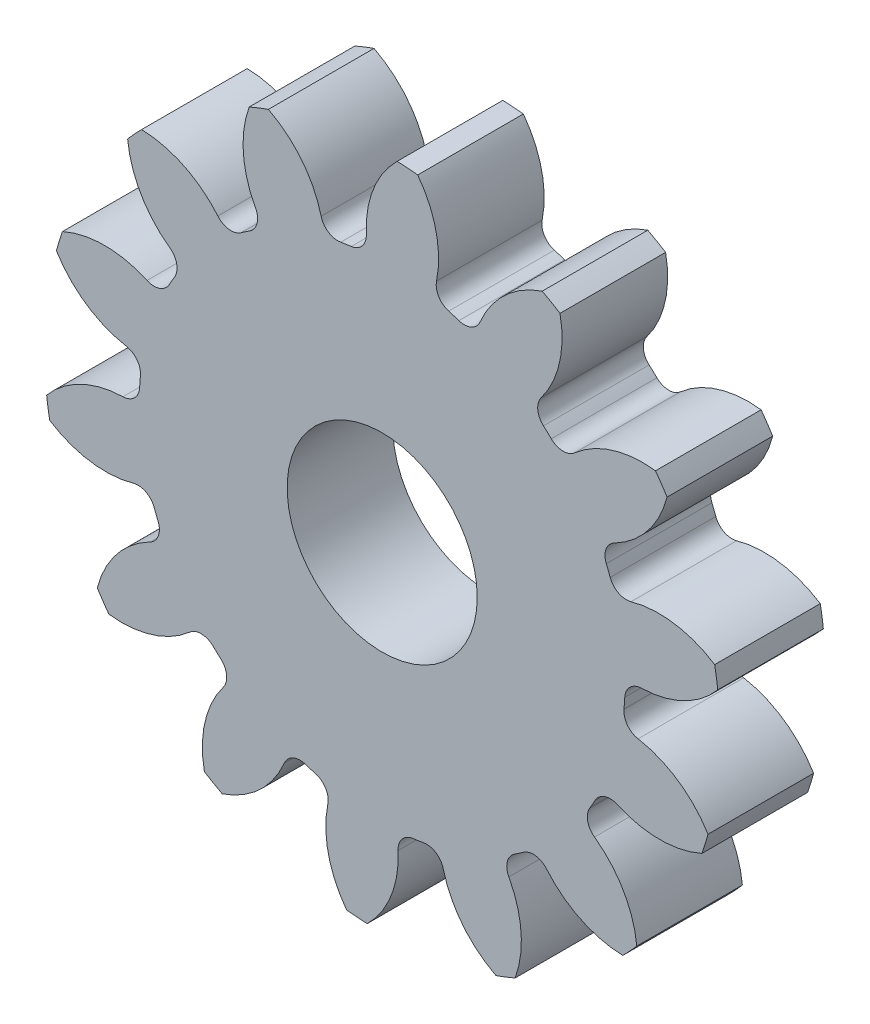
ISO-10303-21;
HEADER;
FILE_DESCRIPTION(('STEP AP214'),'2;1');
FILE_NAME('part.step','',(''),(''),'','','');
FILE_SCHEMA(('AUTOMOTIVE_DESIGN { 1 0 10303 214 1 1 1 1 }'));
ENDSEC;
DATA;
#1=APPLICATION_CONTEXT('core data for automotive mechanical design processes');
#2=APPLICATION_PROTOCOL_DEFINITION('international standard','automotive_design',2000,#1);
#3=PRODUCT_CONTEXT('',#1,'mechanical');
#4=PRODUCT('Part','Part','',(#3));
#5=PRODUCT_RELATED_PRODUCT_CATEGORY('part','',(#4));
#6=PRODUCT_DEFINITION_FORMATION('','',#4);
#7=PRODUCT_DEFINITION_CONTEXT('part definition',#1,'design');
#8=PRODUCT_DEFINITION('design','',#6,#7);
#9=PRODUCT_DEFINITION_SHAPE('','',#8);
#10=(LENGTH_UNIT() NAMED_UNIT(*) SI_UNIT(.MILLI.,.METRE.));
#11=(NAMED_UNIT(*) PLANE_ANGLE_UNIT() SI_UNIT($,.RADIAN.));
#12=(NAMED_UNIT(*) SI_UNIT($,.STERADIAN.) SOLID_ANGLE_UNIT());
#13=UNCERTAINTY_MEASURE_WITH_UNIT(LENGTH_MEASURE(1.E-05),#10,'distance_accuracy_value','');
#14=(GEOMETRIC_REPRESENTATION_CONTEXT(3) GLOBAL_UNCERTAINTY_ASSIGNED_CONTEXT((#13)) GLOBAL_UNIT_ASSIGNED_CONTEXT((#10,
#11,#12)) REPRESENTATION_CONTEXT('',''));
#15=CARTESIAN_POINT('',(0.,0.,0.));
#16=DIRECTION('',(0.,0.,1.));
#17=DIRECTION('',(1.,0.,0.));
#18=AXIS2_PLACEMENT_3D('',#15,#16,#17);
#19=CARTESIAN_POINT('',(0.,0.,127.));
#20=DIRECTION('',(0.,0.,-1.));
#21=DIRECTION('',(-1.,0.,0.));
#22=AXIS2_PLACEMENT_3D('',#19,#20,#21);
#23=CYLINDRICAL_SURFACE('',#22,406.4);
#24=DIRECTION('',(0.,0.,-1.));
#25=VECTOR('',#24,1.);
#26=CARTESIAN_POINT('',(399.835897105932,72.747614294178,63.5));
#27=LINE('',#26,#25);
#28=CARTESIAN_POINT('',(399.835897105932,72.747614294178,127.));
#29=VERTEX_POINT('',#28);
#30=CARTESIAN_POINT('',(399.835897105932,72.747614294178,0.));
#31=VERTEX_POINT('',#30);
#32=EDGE_CURVE('E600',#29,#31,#27,.T.);
#33=ORIENTED_EDGE('',*,*,#32,.F.);
#34=CARTESIAN_POINT('',(0.,0.,127.));
#35=DIRECTION('',(0.,0.,1.));
#36=DIRECTION('',(1.,0.,0.));
#37=AXIS2_PLACEMENT_3D('',#34,#35,#36);
#38=CIRCLE('',#37,406.4);
#39=CARTESIAN_POINT('',(403.522098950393,48.2791431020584,127.));
#40=VERTEX_POINT('',#39);
#41=EDGE_CURVE('E1093',#40,#29,#38,.T.);
#42=ORIENTED_EDGE('',*,*,#41,.F.);
#43=DIRECTION('',(0.,0.,-1.));
#44=VECTOR('',#43,1.);
#45=CARTESIAN_POINT('',(403.522098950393,48.2791431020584,63.5));
#46=LINE('',#45,#44);
#47=CARTESIAN_POINT('',(403.522098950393,48.2791431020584,0.));
#48=VERTEX_POINT('',#47);
#49=EDGE_CURVE('E1087',#48,#40,#46,.F.);
#50=ORIENTED_EDGE('',*,*,#49,.F.);
#51=CARTESIAN_POINT('',(0.,0.,0.));
#52=DIRECTION('',(0.,0.,1.));
#53=DIRECTION('',(1.,0.,0.));
#54=AXIS2_PLACEMENT_3D('',#51,#52,#53);
#55=CIRCLE('',#54,406.4);
#56=EDGE_CURVE('E1098',#48,#31,#55,.T.);
#57=ORIENTED_EDGE('',*,*,#56,.T.);
#58=EDGE_LOOP('',(#33,#42,#50,#57));
#59=FACE_BOUND('',#58,.T.);
#60=ADVANCED_FACE('F33',(#59),#23,.T.);
#61=DIRECTION('',(0.,0.,-1.));
#62=VECTOR('',#61,1.);
#63=CARTESIAN_POINT('',(342.613313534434,218.579682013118,63.5));
#64=LINE('',#63,#62);
#65=CARTESIAN_POINT('',(342.613313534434,218.579682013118,0.));
#66=VERTEX_POINT('',#65);
#67=CARTESIAN_POINT('',(342.613313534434,218.579682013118,127.));
#68=VERTEX_POINT('',#67);
#69=EDGE_CURVE('E571',#66,#68,#64,.F.);
#70=ORIENTED_EDGE('',*,*,#69,.F.);
#71=CARTESIAN_POINT('',(328.67568866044,239.025629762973,0.));
#72=VERTEX_POINT('',#71);
#73=EDGE_CURVE('E1101',#66,#72,#55,.T.);
#74=ORIENTED_EDGE('',*,*,#73,.T.);
#75=DIRECTION('',(0.,0.,-1.));
#76=VECTOR('',#75,1.);
#77=CARTESIAN_POINT('',(328.67568866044,239.025629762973,63.5));
#78=LINE('',#77,#76);
#79=CARTESIAN_POINT('',(328.67568866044,239.025629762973,127.));
#80=VERTEX_POINT('',#79);
#81=EDGE_CURVE('E633',#80,#72,#78,.T.);
#82=ORIENTED_EDGE('',*,*,#81,.F.);
#83=EDGE_CURVE('E1096',#68,#80,#38,.T.);
#84=ORIENTED_EDGE('',*,*,#83,.F.);
#85=EDGE_LOOP('',(#70,#74,#82,#84));
#86=FACE_BOUND('',#85,.T.);
#87=ADVANCED_FACE('F1261',(#86),#23,.T.);
#88=CARTESIAN_POINT('',(0.,0.,127.));
#89=DIRECTION('',(0.,0.,1.));
#90=DIRECTION('',(1.,0.,0.));
#91=AXIS2_PLACEMENT_3D('',#88,#89,#90);
#92=PLANE('',#91);
#93=CARTESIAN_POINT('',(0.,0.,127.000000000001));
#94=DIRECTION('',(0.,0.,1.));
#95=DIRECTION('',(1.,0.,0.));
#96=AXIS2_PLACEMENT_3D('',#93,#94,#95);
#97=CIRCLE('',#96,114.3);
#98=CARTESIAN_POINT('',(114.3,0.,127.000000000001));
#99=VERTEX_POINT('',#98);
#100=EDGE_CURVE('E588',#99,#99,#97,.T.);
#101=ORIENTED_EDGE('',*,*,#100,.F.);
#102=EDGE_LOOP('',(#101));
#103=FACE_BOUND('',#102,.T.);
#104=ORIENTED_EDGE('',*,*,#41,.T.);
#105=CARTESIAN_POINT('',(332.690576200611,-31.2464611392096,127.));
#106=DIRECTION('',(0.,0.,-1.));
#107=DIRECTION('',(0.900968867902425,0.433883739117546,0.));
#108=AXIS2_PLACEMENT_3D('',#105,#106,#107);
#109=CIRCLE('',#108,123.787163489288);
#110=CARTESIAN_POINT('',(299.19594031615,87.9230450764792,127.));
#111=VERTEX_POINT('',#110);
#112=EDGE_CURVE('E580',#111,#29,#109,.T.);
#113=ORIENTED_EDGE('',*,*,#112,.F.);
#114=CARTESIAN_POINT('',(293.601485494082,107.827379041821,127.));
#115=DIRECTION('',(0.,0.,1.));
#116=DIRECTION('',(-0.900968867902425,-0.433883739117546,0.));
#117=AXIS2_PLACEMENT_3D('',#114,#115,#116);
#118=CIRCLE('',#117,20.6756);
#119=CARTESIAN_POINT('',(274.193363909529,100.699598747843,127.));
#120=VERTEX_POINT('',#119);
#121=EDGE_CURVE('E578',#120,#111,#118,.T.);
#122=ORIENTED_EDGE('',*,*,#121,.F.);
#123=CARTESIAN_POINT('',(0.,0.,127.));
#124=DIRECTION('',(0.,0.,-1.));
#125=DIRECTION('',(0.900968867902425,0.433883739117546,0.));
#126=AXIS2_PLACEMENT_3D('',#123,#124,#125);
#127=CIRCLE('',#126,292.1);
#128=CARTESIAN_POINT('',(269.507529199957,112.641474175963,127.));
#129=VERTEX_POINT('',#128);
#130=EDGE_CURVE('E563',#129,#120,#127,.T.);
#131=ORIENTED_EDGE('',*,*,#130,.F.);
#132=CARTESIAN_POINT('',(288.58397517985,120.614531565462,127.));
#133=DIRECTION('',(0.,0.,1.));
#134=DIRECTION('',(-0.900968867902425,-0.433883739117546,0.));
#135=AXIS2_PLACEMENT_3D('',#132,#133,#134);
#136=CIRCLE('',#135,20.6756);
#137=CARTESIAN_POINT('',(279.149301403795,139.012014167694,127.));
#138=VERTEX_POINT('',#137);
#139=EDGE_CURVE('E555',#138,#129,#136,.T.);
#140=ORIENTED_EDGE('',*,*,#139,.F.);
#141=CARTESIAN_POINT('',(222.662838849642,249.159830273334,127.));
#142=DIRECTION('',(0.,0.,-1.));
#143=DIRECTION('',(-0.900968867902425,-0.433883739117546,0.));
#144=AXIS2_PLACEMENT_3D('',#141,#142,#143);
#145=CIRCLE('',#144,123.787163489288);
#146=EDGE_CURVE('E585',#68,#138,#145,.T.);
#147=ORIENTED_EDGE('',*,*,#146,.F.);
#148=ORIENTED_EDGE('',*,*,#83,.T.);
#149=CARTESIAN_POINT('',(313.301183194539,116.196942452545,127.));
#150=DIRECTION('',(0.,0.,-1.));
#151=DIRECTION('',(0.623489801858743,0.781831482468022,0.));
#152=AXIS2_PLACEMENT_3D('',#149,#150,#151);
#153=CIRCLE('',#152,123.787163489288);
#154=CARTESIAN_POINT('',(231.417848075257,209.032179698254,127.));
#155=VERTEX_POINT('',#154);
#156=EDGE_CURVE('E609',#155,#80,#153,.T.);
#157=ORIENTED_EDGE('',*,*,#156,.F.);
#158=CARTESIAN_POINT('',(217.74125160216,224.538021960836,127.));
#159=DIRECTION('',(0.,0.,1.));
#160=DIRECTION('',(-0.623489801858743,-0.781831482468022,0.));
#161=AXIS2_PLACEMENT_3D('',#158,#159,#160);
#162=CIRCLE('',#161,20.6756);
#163=CARTESIAN_POINT('',(203.347766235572,209.69524545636,127.));
#164=VERTEX_POINT('',#163);
#165=EDGE_CURVE('E607',#164,#155,#162,.T.);
#166=ORIENTED_EDGE('',*,*,#165,.F.);
#167=CARTESIAN_POINT('',(0.,0.,127.));
#168=DIRECTION('',(0.,0.,-1.));
#169=DIRECTION('',(0.623489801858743,0.781831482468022,0.));
#170=AXIS2_PLACEMENT_3D('',#167,#168,#169);
#171=CIRCLE('',#170,292.1);
#172=CARTESIAN_POINT('',(193.944589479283,218.421395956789,127.));
#173=VERTEX_POINT('',#172);
#174=EDGE_CURVE('E604',#173,#164,#171,.T.);
#175=ORIENTED_EDGE('',*,*,#174,.F.);
#176=CARTESIAN_POINT('',(207.672493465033,233.881832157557,127.));
#177=DIRECTION('',(0.,0.,1.));
#178=DIRECTION('',(-0.623489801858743,-0.781831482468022,0.));
#179=AXIS2_PLACEMENT_3D('',#176,#177,#178);
#180=CIRCLE('',#179,20.6756);
#181=CARTESIAN_POINT('',(191.189777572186,246.363839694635,127.));
#182=VERTEX_POINT('',#181);
#183=EDGE_CURVE('E602',#182,#173,#180,.T.);
#184=ORIENTED_EDGE('',*,*,#183,.F.);
#185=CARTESIAN_POINT('',(92.50588704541,321.095035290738,127.));
#186=DIRECTION('',(0.,0.,-1.));
#187=DIRECTION('',(-0.623489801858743,-0.781831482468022,0.));
#188=AXIS2_PLACEMENT_3D('',#185,#186,#187);
#189=CIRCLE('',#188,123.787163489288);
#190=CARTESIAN_POINT('',(213.845759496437,345.587834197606,127.));
#191=VERTEX_POINT('',#190);
#192=EDGE_CURVE('E612',#191,#182,#189,.T.);
#193=ORIENTED_EDGE('',*,*,#192,.F.);
#194=CARTESIAN_POINT('',(192.417229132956,357.961687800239,127.));
#195=VERTEX_POINT('',#194);
#196=EDGE_CURVE('E1137',#191,#195,#38,.T.);
#197=ORIENTED_EDGE('',*,*,#196,.T.);
#198=CARTESIAN_POINT('',(231.858648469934,240.626116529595,127.));
#199=DIRECTION('',(0.,0.,-1.));
#200=DIRECTION('',(0.222520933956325,0.974927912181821,0.));
#201=AXIS2_PLACEMENT_3D('',#198,#199,#200);
#202=CIRCLE('',#201,123.787163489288);
#203=CARTESIAN_POINT('',(117.804612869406,288.739927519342,127.));
#204=VERTEX_POINT('',#203);
#205=EDGE_CURVE('E644',#204,#195,#202,.T.);
#206=ORIENTED_EDGE('',*,*,#205,.F.);
#207=CARTESIAN_POINT('',(98.7546924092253,296.776155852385,127.));
#208=DIRECTION('',(0.,0.,1.));
#209=DIRECTION('',(-0.222520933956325,-0.974927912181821,0.));
#210=AXIS2_PLACEMENT_3D('',#207,#208,#209);
#211=CIRCLE('',#210,20.6756);
#212=CARTESIAN_POINT('',(92.2266495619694,277.15817705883,127.));
#213=VERTEX_POINT('',#212);
#214=EDGE_CURVE('E642',#213,#204,#211,.T.);
#215=ORIENTED_EDGE('',*,*,#214,.F.);
#216=CARTESIAN_POINT('',(0.,0.,127.));
#217=DIRECTION('',(0.,0.,-1.));
#218=DIRECTION('',(0.222520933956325,0.974927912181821,0.));
#219=AXIS2_PLACEMENT_3D('',#216,#217,#218);
#220=CIRCLE('',#219,292.1);
#221=CARTESIAN_POINT('',(79.9685452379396,280.940281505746,127.));
#222=VERTEX_POINT('',#221);
#223=EDGE_CURVE('E639',#222,#213,#220,.T.);
#224=ORIENTED_EDGE('',*,*,#223,.F.);
#225=CARTESIAN_POINT('',(85.6289274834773,300.825967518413,127.));
#226=DIRECTION('',(0.,0.,1.));
#227=DIRECTION('',(-0.222520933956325,-0.974927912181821,0.));
#228=AXIS2_PLACEMENT_3D('',#225,#226,#227);
#229=CIRCLE('',#228,20.6756);
#230=CARTESIAN_POINT('',(65.3627735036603,304.920285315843,127.));
#231=VERTEX_POINT('',#230);
#232=EDGE_CURVE('E637',#231,#222,#229,.T.);
#233=ORIENTED_EDGE('',*,*,#232,.F.);
#234=CARTESIAN_POINT('',(-55.9729901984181,329.433430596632,127.));
#235=DIRECTION('',(0.,0.,-1.));
#236=DIRECTION('',(-0.222520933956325,-0.974927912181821,0.));
#237=AXIS2_PLACEMENT_3D('',#234,#235,#236);
#238=CIRCLE('',#237,123.787163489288);
#239=CARTESIAN_POINT('',(42.7234301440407,404.148077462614,127.));
#240=VERTEX_POINT('',#239);
#241=EDGE_CURVE('E647',#240,#231,#238,.T.);
#242=ORIENTED_EDGE('',*,*,#241,.F.);
#243=CARTESIAN_POINT('',(18.0481775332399,405.999043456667,127.));
#244=VERTEX_POINT('',#243);
#245=EDGE_CURVE('E1243',#240,#244,#38,.T.);
#246=ORIENTED_EDGE('',*,*,#245,.T.);
#247=CARTESIAN_POINT('',(104.493664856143,317.396337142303,127.));
#248=DIRECTION('',(0.,0.,-1.));
#249=DIRECTION('',(-0.222520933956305,0.974927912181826,0.));
#250=AXIS2_PLACEMENT_3D('',#247,#248,#249);
#251=CIRCLE('',#250,123.787163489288);
#252=CARTESIAN_POINT('',(-19.1412706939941,311.259191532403,127.));
#253=VERTEX_POINT('',#252);
#254=EDGE_CURVE('E682',#253,#244,#251,.T.);
#255=ORIENTED_EDGE('',*,*,#254,.F.);
#256=CARTESIAN_POINT('',(-39.791444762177,310.234132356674,127.));
#257=DIRECTION('',(0.,0.,1.));
#258=DIRECTION('',(0.222520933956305,-0.974927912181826,0.));
#259=AXIS2_PLACEMENT_3D('',#256,#257,#258);
#260=CIRCLE('',#259,20.6756);
#261=CARTESIAN_POINT('',(-37.1610861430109,289.726532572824,127.));
#262=VERTEX_POINT('',#261);
#263=EDGE_CURVE('E680',#262,#253,#260,.T.);
#264=ORIENTED_EDGE('',*,*,#263,.F.);
#265=CARTESIAN_POINT('',(0.,0.,127.));
#266=DIRECTION('',(0.,0.,-1.));
#267=DIRECTION('',(-0.222520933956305,0.974927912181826,0.));
#268=AXIS2_PLACEMENT_3D('',#265,#266,#267);
#269=CIRCLE('',#268,292.1);
#270=CARTESIAN_POINT('',(-49.8462501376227,287.815498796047,127.));
#271=VERTEX_POINT('',#270);
#272=EDGE_CURVE('E677',#271,#262,#269,.T.);
#273=ORIENTED_EDGE('',*,*,#272,.F.);
#274=CARTESIAN_POINT('',(-53.3744977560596,308.187830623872,127.));
#275=DIRECTION('',(0.,0.,1.));
#276=DIRECTION('',(0.222520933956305,-0.974927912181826,0.));
#277=AXIS2_PLACEMENT_3D('',#274,#275,#276);
#278=CIRCLE('',#277,20.6756);
#279=CARTESIAN_POINT('',(-73.4101294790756,303.083528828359,127.));
#280=VERTEX_POINT('',#279);
#281=EDGE_CURVE('E675',#280,#271,#278,.T.);
#282=ORIENTED_EDGE('',*,*,#281,.F.);
#283=CARTESIAN_POINT('',(-193.365730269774,272.523494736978,127.));
#284=DIRECTION('',(0.,0.,-1.));
#285=DIRECTION('',(0.222520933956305,-0.974927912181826,0.));
#286=AXIS2_PLACEMENT_3D('',#283,#284,#285);
#287=CIRCLE('',#286,123.787163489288);
#288=CARTESIAN_POINT('',(-136.860798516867,382.661837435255,127.));
#289=VERTEX_POINT('',#288);
#290=EDGE_CURVE('E685',#289,#280,#287,.T.);
#291=ORIENTED_EDGE('',*,*,#290,.F.);
#292=CARTESIAN_POINT('',(-159.895536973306,373.623309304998,127.));
#293=VERTEX_POINT('',#292);
#294=EDGE_CURVE('E1239',#289,#293,#38,.T.);
#295=ORIENTED_EDGE('',*,*,#294,.T.);
#296=CARTESIAN_POINT('',(-43.5675706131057,331.302320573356,127.));
#297=DIRECTION('',(0.,0.,-1.));
#298=DIRECTION('',(-0.623489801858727,0.781831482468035,0.));
#299=AXIS2_PLACEMENT_3D('',#296,#297,#298);
#300=CIRCLE('',#299,123.787163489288);
#301=CARTESIAN_POINT('',(-152.295990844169,272.129755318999,127.));
#302=VERTEX_POINT('',#301);
#303=EDGE_CURVE('E720',#302,#293,#300,.T.);
#304=ORIENTED_EDGE('',*,*,#303,.F.);
#305=CARTESIAN_POINT('',(-170.456398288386,262.246434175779,127.));
#306=DIRECTION('',(0.,0.,1.));
#307=DIRECTION('',(0.623489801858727,-0.781831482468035,0.));
#308=AXIS2_PLACEMENT_3D('',#305,#306,#307);
#309=CIRCLE('',#308,20.6756);
#310=CARTESIAN_POINT('',(-159.188612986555,244.910995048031,127.));
#311=VERTEX_POINT('',#310);
#312=EDGE_CURVE('E718',#311,#302,#309,.T.);
#313=ORIENTED_EDGE('',*,*,#312,.F.);
#314=CARTESIAN_POINT('',(0.,0.,127.));
#315=DIRECTION('',(0.,0.,-1.));
#316=DIRECTION('',(-0.623489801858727,0.781831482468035,0.));
#317=AXIS2_PLACEMENT_3D('',#314,#315,#316);
#318=CIRCLE('',#317,292.1);
#319=CARTESIAN_POINT('',(-169.788384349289,237.685326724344,127.));
#320=VERTEX_POINT('',#319);
#321=EDGE_CURVE('E715',#320,#311,#318,.T.);
#322=ORIENTED_EDGE('',*,*,#321,.F.);
#323=CARTESIAN_POINT('',(-181.806449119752,254.509314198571,127.));
#324=DIRECTION('',(0.,0.,1.));
#325=DIRECTION('',(0.623489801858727,-0.781831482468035,0.));
#326=AXIS2_PLACEMENT_3D('',#323,#324,#325);
#327=CIRCLE('',#326,20.6756);
#328=CARTESIAN_POINT('',(-197.643256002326,241.217362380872,127.));
#329=VERTEX_POINT('',#328);
#330=EDGE_CURVE('E713',#329,#320,#327,.T.);
#331=ORIENTED_EDGE('',*,*,#330,.F.);
#332=CARTESIAN_POINT('',(-292.460015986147,161.636938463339,127.));
#333=DIRECTION('',(0.,0.,-1.));
#334=DIRECTION('',(0.623489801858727,-0.781831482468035,0.));
#335=AXIS2_PLACEMENT_3D('',#332,#333,#334);
#336=CIRCLE('',#335,123.787163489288);
#337=CARTESIAN_POINT('',(-289.338067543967,285.384727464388,127.));
#338=VERTEX_POINT('',#337);
#339=EDGE_CURVE('E723',#338,#329,#336,.T.);
#340=ORIENTED_EDGE('',*,*,#339,.F.);
#341=CARTESIAN_POINT('',(-306.169979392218,267.246896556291,127.));
#342=VERTEX_POINT('',#341);
#343=EDGE_CURVE('E1235',#338,#342,#38,.T.);
#344=ORIENTED_EDGE('',*,*,#343,.T.);
#345=CARTESIAN_POINT('',(-182.99971440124,279.589816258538,127.));
#346=DIRECTION('',(0.,0.,-1.));
#347=DIRECTION('',(-0.900968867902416,0.433883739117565,0.));
#348=AXIS2_PLACEMENT_3D('',#345,#346,#347);
#349=CIRCLE('',#348,123.787163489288);
#350=CARTESIAN_POINT('',(-255.286622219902,179.10168361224,127.));
#351=VERTEX_POINT('',#350);
#352=EDGE_CURVE('E758',#351,#342,#349,.T.);
#353=ORIENTED_EDGE('',*,*,#352,.F.);
#354=CARTESIAN_POINT('',(-267.360371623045,162.317613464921,127.));
#355=DIRECTION('',(0.,0.,1.));
#356=DIRECTION('',(0.900968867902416,-0.433883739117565,0.));
#357=AXIS2_PLACEMENT_3D('',#354,#355,#356);
#358=CIRCLE('',#357,20.6756);
#359=CARTESIAN_POINT('',(-249.686882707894,151.587831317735,127.));
#360=VERTEX_POINT('',#359);
#361=EDGE_CURVE('E756',#360,#351,#358,.T.);
#362=ORIENTED_EDGE('',*,*,#361,.F.);
#363=CARTESIAN_POINT('',(0.,0.,127.));
#364=DIRECTION('',(0.,0.,-1.));
#365=DIRECTION('',(-0.900968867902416,0.433883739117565,0.));
#366=AXIS2_PLACEMENT_3D('',#363,#364,#365);
#367=CIRCLE('',#366,292.1);
#368=CARTESIAN_POINT('',(-256.101846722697,140.47866067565,127.));
#369=VERTEX_POINT('',#368);
#370=EDGE_CURVE('E753',#369,#360,#367,.T.);
#371=ORIENTED_EDGE('',*,*,#370,.F.);
#372=CARTESIAN_POINT('',(-274.229403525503,150.422106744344,127.));
#373=DIRECTION('',(0.,0.,1.));
#374=DIRECTION('',(0.900968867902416,-0.433883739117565,0.));
#375=AXIS2_PLACEMENT_3D('',#372,#373,#374);
#376=CIRCLE('',#375,20.6756);
#377=CARTESIAN_POINT('',(-282.730711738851,131.575138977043,127.));
#378=VERTEX_POINT('',#377);
#379=EDGE_CURVE('E751',#378,#369,#376,.T.);
#380=ORIENTED_EDGE('',*,*,#379,.F.);
#381=CARTESIAN_POINT('',(-333.62900874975,18.736204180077,127.));
#382=DIRECTION('',(0.,0.,-1.));
#383=DIRECTION('',(0.900968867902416,-0.433883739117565,0.));
#384=AXIS2_PLACEMENT_3D('',#381,#382,#383);
#385=CIRCLE('',#384,123.787163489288);
#386=CARTESIAN_POINT('',(-384.508383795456,131.583672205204,127.));
#387=VERTEX_POINT('',#386);
#388=EDGE_CURVE('E761',#387,#378,#385,.T.);
#389=ORIENTED_EDGE('',*,*,#388,.F.);
#390=CARTESIAN_POINT('',(-391.80370246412,107.938958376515,127.));
#391=VERTEX_POINT('',#390);
#392=EDGE_CURVE('E1231',#387,#391,#38,.T.);
#393=ORIENTED_EDGE('',*,*,#392,.T.);
#394=CARTESIAN_POINT('',(-286.186520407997,172.501119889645,127.));
#395=DIRECTION('',(0.,0.,-1.));
#396=DIRECTION('',(-1.,0.,0.));
#397=AXIS2_PLACEMENT_3D('',#394,#395,#396);
#398=CIRCLE('',#397,123.787163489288);
#399=CARTESIAN_POINT('',(-307.714607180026,50.600326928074,127.));
#400=VERTEX_POINT('',#399);
#401=EDGE_CURVE('E796',#400,#391,#398,.T.);
#402=ORIENTED_EDGE('',*,*,#401,.F.);
#403=CARTESIAN_POINT('',(-311.310344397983,30.2397987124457,127.));
#404=DIRECTION('',(0.,0.,1.));
#405=DIRECTION('',(1.,0.,0.));
#406=AXIS2_PLACEMENT_3D('',#403,#404,#405);
#407=CIRCLE('',#406,20.6756);
#408=CARTESIAN_POINT('',(-290.731603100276,28.2408384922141,127.));
#409=VERTEX_POINT('',#408);
#410=EDGE_CURVE('E794',#409,#400,#407,.T.);
#411=ORIENTED_EDGE('',*,*,#410,.F.);
#412=CARTESIAN_POINT('',(0.,0.,127.));
#413=DIRECTION('',(0.,0.,-1.));
#414=DIRECTION('',(-1.,0.,0.));
#415=AXIS2_PLACEMENT_3D('',#412,#413,#414);
#416=CIRCLE('',#415,292.1);
#417=CARTESIAN_POINT('',(-291.691197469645,15.4484730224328,127.));
#418=VERTEX_POINT('',#417);
#419=EDGE_CURVE('E791',#418,#409,#416,.T.);
#420=ORIENTED_EDGE('',*,*,#419,.F.);
#421=CARTESIAN_POINT('',(-312.337861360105,16.541956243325,127.));
#422=DIRECTION('',(0.,0.,1.));
#423=DIRECTION('',(1.,0.,0.));
#424=AXIS2_PLACEMENT_3D('',#421,#422,#423);
#425=CIRCLE('',#424,20.6756);
#426=CARTESIAN_POINT('',(-311.81988255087,-4.12715436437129,127.));
#427=VERTEX_POINT('',#426);
#428=EDGE_CURVE('E789',#427,#418,#425,.T.);
#429=ORIENTED_EDGE('',*,*,#428,.F.);
#430=CARTESIAN_POINT('',(-308.71868463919,-127.875465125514,127.));
#431=DIRECTION('',(0.,0.,-1.));
#432=DIRECTION('',(1.,0.,0.));
#433=AXIS2_PLACEMENT_3D('',#430,#431,#432);
#434=CIRCLE('',#433,123.787163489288);
#435=CARTESIAN_POINT('',(-403.522098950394,-48.2791431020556,127.));
#436=VERTEX_POINT('',#435);
#437=EDGE_CURVE('E799',#436,#427,#434,.T.);
#438=ORIENTED_EDGE('',*,*,#437,.F.);
#439=CARTESIAN_POINT('',(-399.835897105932,-72.7476142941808,127.));
#440=VERTEX_POINT('',#439);
#441=EDGE_CURVE('E1227',#436,#440,#38,.T.);
#442=ORIENTED_EDGE('',*,*,#441,.T.);
#443=CARTESIAN_POINT('',(-332.690576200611,31.2464611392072,127.));
#444=DIRECTION('',(0.,0.,-1.));
#445=DIRECTION('',(-0.900968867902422,-0.433883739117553,0.));
#446=AXIS2_PLACEMENT_3D('',#443,#444,#445);
#447=CIRCLE('',#446,123.787163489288);
#448=CARTESIAN_POINT('',(-299.195940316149,-87.9230450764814,127.));
#449=VERTEX_POINT('',#448);
#450=EDGE_CURVE('E834',#449,#440,#447,.T.);
#451=ORIENTED_EDGE('',*,*,#450,.F.);
#452=CARTESIAN_POINT('',(-293.601485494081,-107.827379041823,127.));
#453=DIRECTION('',(0.,0.,1.));
#454=DIRECTION('',(0.900968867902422,0.433883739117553,0.));
#455=AXIS2_PLACEMENT_3D('',#452,#453,#454);
#456=CIRCLE('',#455,20.6756);
#457=CARTESIAN_POINT('',(-274.193363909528,-100.699598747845,127.));
#458=VERTEX_POINT('',#457);
#459=EDGE_CURVE('E832',#458,#449,#456,.T.);
#460=ORIENTED_EDGE('',*,*,#459,.F.);
#461=CARTESIAN_POINT('',(0.,0.,127.));
#462=DIRECTION('',(0.,0.,-1.));
#463=DIRECTION('',(-0.900968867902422,-0.433883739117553,0.));
#464=AXIS2_PLACEMENT_3D('',#461,#462,#463);
#465=CIRCLE('',#464,292.1);
#466=CARTESIAN_POINT('',(-269.507529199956,-112.641474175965,127.));
#467=VERTEX_POINT('',#466);
#468=EDGE_CURVE('E829',#467,#458,#465,.T.);
#469=ORIENTED_EDGE('',*,*,#468,.F.);
#470=CARTESIAN_POINT('',(-288.583975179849,-120.614531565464,127.));
#471=DIRECTION('',(0.,0.,1.));
#472=DIRECTION('',(0.900968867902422,0.433883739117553,0.));
#473=AXIS2_PLACEMENT_3D('',#470,#471,#472);
#474=CIRCLE('',#473,20.6756);
#475=CARTESIAN_POINT('',(-279.149301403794,-139.012014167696,127.));
#476=VERTEX_POINT('',#475);
#477=EDGE_CURVE('E827',#476,#467,#474,.T.);
#478=ORIENTED_EDGE('',*,*,#477,.F.);
#479=CARTESIAN_POINT('',(-222.66283884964,-249.159830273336,127.));
#480=DIRECTION('',(0.,0.,-1.));
#481=DIRECTION('',(0.900968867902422,0.433883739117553,0.));
#482=AXIS2_PLACEMENT_3D('',#479,#480,#481);
#483=CIRCLE('',#482,123.787163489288);
#484=CARTESIAN_POINT('',(-342.613313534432,-218.57968201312,127.));
#485=VERTEX_POINT('',#484);
#486=EDGE_CURVE('E837',#485,#476,#483,.T.);
#487=ORIENTED_EDGE('',*,*,#486,.F.);
#488=CARTESIAN_POINT('',(-328.675688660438,-239.025629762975,127.));
#489=VERTEX_POINT('',#488);
#490=EDGE_CURVE('E1223',#485,#489,#38,.T.);
#491=ORIENTED_EDGE('',*,*,#490,.T.);
#492=CARTESIAN_POINT('',(-313.301183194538,-116.196942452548,127.));
#493=DIRECTION('',(0.,0.,-1.));
#494=DIRECTION('',(-0.623489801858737,-0.781831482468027,0.));
#495=AXIS2_PLACEMENT_3D('',#492,#493,#494);
#496=CIRCLE('',#495,123.787163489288);
#497=CARTESIAN_POINT('',(-231.417848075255,-209.032179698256,127.));
#498=VERTEX_POINT('',#497);
#499=EDGE_CURVE('E872',#498,#489,#496,.T.);
#500=ORIENTED_EDGE('',*,*,#499,.F.);
#501=CARTESIAN_POINT('',(-217.741251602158,-224.538021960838,127.));
#502=DIRECTION('',(0.,0.,1.));
#503=DIRECTION('',(0.623489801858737,0.781831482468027,0.));
#504=AXIS2_PLACEMENT_3D('',#501,#502,#503);
#505=CIRCLE('',#504,20.6756);
#506=CARTESIAN_POINT('',(-203.347766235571,-209.695245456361,127.));
#507=VERTEX_POINT('',#506);
#508=EDGE_CURVE('E870',#507,#498,#505,.T.);
#509=ORIENTED_EDGE('',*,*,#508,.F.);
#510=CARTESIAN_POINT('',(0.,0.,127.));
#511=DIRECTION('',(0.,0.,-1.));
#512=DIRECTION('',(-0.623489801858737,-0.781831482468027,0.));
#513=AXIS2_PLACEMENT_3D('',#510,#511,#512);
#514=CIRCLE('',#513,292.1);
#515=CARTESIAN_POINT('',(-193.944589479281,-218.421395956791,127.));
#516=VERTEX_POINT('',#515);
#517=EDGE_CURVE('E867',#516,#507,#514,.T.);
#518=ORIENTED_EDGE('',*,*,#517,.F.);
#519=CARTESIAN_POINT('',(-207.672493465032,-233.881832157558,127.));
#520=DIRECTION('',(0.,0.,1.));
#521=DIRECTION('',(0.623489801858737,0.781831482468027,0.));
#522=AXIS2_PLACEMENT_3D('',#519,#520,#521);
#523=CIRCLE('',#522,20.6756);
#524=CARTESIAN_POINT('',(-191.189777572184,-246.363839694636,127.));
#525=VERTEX_POINT('',#524);
#526=EDGE_CURVE('E865',#525,#516,#523,.T.);
#527=ORIENTED_EDGE('',*,*,#526,.F.);
#528=CARTESIAN_POINT('',(-92.5058870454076,-321.095035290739,127.));
#529=DIRECTION('',(0.,0.,-1.));
#530=DIRECTION('',(0.623489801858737,0.781831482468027,0.));
#531=AXIS2_PLACEMENT_3D('',#528,#529,#530);
#532=CIRCLE('',#531,123.787163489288);
#533=CARTESIAN_POINT('',(-213.845759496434,-345.587834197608,127.));
#534=VERTEX_POINT('',#533);
#535=EDGE_CURVE('E875',#534,#525,#532,.T.);
#536=ORIENTED_EDGE('',*,*,#535,.F.);
#537=CARTESIAN_POINT('',(-192.417229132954,-357.96168780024,127.));
#538=VERTEX_POINT('',#537);
#539=EDGE_CURVE('E1219',#534,#538,#38,.T.);
#540=ORIENTED_EDGE('',*,*,#539,.T.);
#541=CARTESIAN_POINT('',(-231.858648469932,-240.626116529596,127.));
#542=DIRECTION('',(0.,0.,-1.));
#543=DIRECTION('',(-0.222520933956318,-0.974927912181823,0.));
#544=AXIS2_PLACEMENT_3D('',#541,#542,#543);
#545=CIRCLE('',#544,123.787163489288);
#546=CARTESIAN_POINT('',(-117.804612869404,-288.739927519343,127.));
#547=VERTEX_POINT('',#546);
#548=EDGE_CURVE('E910',#547,#538,#545,.T.);
#549=ORIENTED_EDGE('',*,*,#548,.F.);
#550=CARTESIAN_POINT('',(-98.7546924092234,-296.776155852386,127.));
#551=DIRECTION('',(0.,0.,1.));
#552=DIRECTION('',(0.222520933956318,0.974927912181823,0.));
#553=AXIS2_PLACEMENT_3D('',#550,#551,#552);
#554=CIRCLE('',#553,20.6756);
#555=CARTESIAN_POINT('',(-92.2266495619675,-277.15817705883,127.));
#556=VERTEX_POINT('',#555);
#557=EDGE_CURVE('E908',#556,#547,#554,.T.);
#558=ORIENTED_EDGE('',*,*,#557,.F.);
#559=CARTESIAN_POINT('',(0.,0.,127.));
#560=DIRECTION('',(0.,0.,-1.));
#561=DIRECTION('',(-0.222520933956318,-0.974927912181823,0.));
#562=AXIS2_PLACEMENT_3D('',#559,#560,#561);
#563=CIRCLE('',#562,292.1);
#564=CARTESIAN_POINT('',(-79.9685452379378,-280.940281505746,127.));
#565=VERTEX_POINT('',#564);
#566=EDGE_CURVE('E905',#565,#556,#563,.T.);
#567=ORIENTED_EDGE('',*,*,#566,.F.);
#568=CARTESIAN_POINT('',(-85.6289274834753,-300.825967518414,127.));
#569=DIRECTION('',(0.,0.,1.));
#570=DIRECTION('',(0.222520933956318,0.974927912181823,0.));
#571=AXIS2_PLACEMENT_3D('',#568,#569,#570);
#572=CIRCLE('',#571,20.6756);
#573=CARTESIAN_POINT('',(-65.3627735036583,-304.920285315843,127.));
#574=VERTEX_POINT('',#573);
#575=EDGE_CURVE('E903',#574,#565,#572,.T.);
#576=ORIENTED_EDGE('',*,*,#575,.F.);
#577=CARTESIAN_POINT('',(55.9729901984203,-329.433430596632,127.));
#578=DIRECTION('',(0.,0.,-1.));
#579=DIRECTION('',(0.222520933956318,0.974927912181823,0.));
#580=AXIS2_PLACEMENT_3D('',#577,#578,#579);
#581=CIRCLE('',#580,123.787163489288);
#582=CARTESIAN_POINT('',(-42.7234301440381,-404.148077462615,127.));
#583=VERTEX_POINT('',#582);
#584=EDGE_CURVE('E913',#583,#574,#581,.T.);
#585=ORIENTED_EDGE('',*,*,#584,.F.);
#586=CARTESIAN_POINT('',(-18.0481775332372,-405.999043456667,127.));
#587=VERTEX_POINT('',#586);
#588=EDGE_CURVE('E1215',#583,#587,#38,.T.);
#589=ORIENTED_EDGE('',*,*,#588,.T.);
#590=CARTESIAN_POINT('',(-104.493664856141,-317.396337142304,127.));
#591=DIRECTION('',(0.,0.,-1.));
#592=DIRECTION('',(0.222520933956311,-0.974927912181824,0.));
#593=AXIS2_PLACEMENT_3D('',#590,#591,#592);
#594=CIRCLE('',#593,123.787163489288);
#595=CARTESIAN_POINT('',(19.1412706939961,-311.259191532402,127.));
#596=VERTEX_POINT('',#595);
#597=EDGE_CURVE('E948',#596,#587,#594,.T.);
#598=ORIENTED_EDGE('',*,*,#597,.F.);
#599=CARTESIAN_POINT('',(39.791444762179,-310.234132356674,127.));
#600=DIRECTION('',(0.,0.,1.));
#601=DIRECTION('',(-0.222520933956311,0.974927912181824,0.));
#602=AXIS2_PLACEMENT_3D('',#599,#600,#601);
#603=CIRCLE('',#602,20.6756);
#604=CARTESIAN_POINT('',(37.1610861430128,-289.726532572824,127.));
#605=VERTEX_POINT('',#604);
#606=EDGE_CURVE('E946',#605,#596,#603,.T.);
#607=ORIENTED_EDGE('',*,*,#606,.F.);
#608=CARTESIAN_POINT('',(0.,0.,127.));
#609=DIRECTION('',(0.,0.,-1.));
#610=DIRECTION('',(0.222520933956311,-0.974927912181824,0.));
#611=AXIS2_PLACEMENT_3D('',#608,#609,#610);
#612=CIRCLE('',#611,292.1);
#613=CARTESIAN_POINT('',(49.8462501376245,-287.815498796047,127.));
#614=VERTEX_POINT('',#613);
#615=EDGE_CURVE('E943',#614,#605,#612,.T.);
#616=ORIENTED_EDGE('',*,*,#615,.F.);
#617=CARTESIAN_POINT('',(53.3744977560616,-308.187830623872,127.));
#618=DIRECTION('',(0.,0.,1.));
#619=DIRECTION('',(-0.222520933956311,0.974927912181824,0.));
#620=AXIS2_PLACEMENT_3D('',#617,#618,#619);
#621=CIRCLE('',#620,20.6756);
#622=CARTESIAN_POINT('',(73.4101294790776,-303.083528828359,127.));
#623=VERTEX_POINT('',#622);
#624=EDGE_CURVE('E941',#623,#614,#621,.T.);
#625=ORIENTED_EDGE('',*,*,#624,.F.);
#626=CARTESIAN_POINT('',(193.365730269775,-272.523494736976,127.));
#627=DIRECTION('',(0.,0.,-1.));
#628=DIRECTION('',(-0.222520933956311,0.974927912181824,0.));
#629=AXIS2_PLACEMENT_3D('',#626,#627,#628);
#630=CIRCLE('',#629,123.787163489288);
#631=CARTESIAN_POINT('',(136.86079851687,-382.661837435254,127.));
#632=VERTEX_POINT('',#631);
#633=EDGE_CURVE('E951',#632,#623,#630,.T.);
#634=ORIENTED_EDGE('',*,*,#633,.F.);
#635=CARTESIAN_POINT('',(159.895536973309,-373.623309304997,127.));
#636=VERTEX_POINT('',#635);
#637=EDGE_CURVE('E1211',#632,#636,#38,.T.);
#638=ORIENTED_EDGE('',*,*,#637,.T.);
#639=CARTESIAN_POINT('',(43.5675706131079,-331.302320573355,127.));
#640=DIRECTION('',(0.,0.,-1.));
#641=DIRECTION('',(0.623489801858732,-0.781831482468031,0.));
#642=AXIS2_PLACEMENT_3D('',#639,#640,#641);
#643=CIRCLE('',#642,123.787163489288);
#644=CARTESIAN_POINT('',(152.295990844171,-272.129755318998,127.));
#645=VERTEX_POINT('',#644);
#646=EDGE_CURVE('E986',#645,#636,#643,.T.);
#647=ORIENTED_EDGE('',*,*,#646,.F.);
#648=CARTESIAN_POINT('',(170.456398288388,-262.246434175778,127.));
#649=DIRECTION('',(0.,0.,1.));
#650=DIRECTION('',(-0.623489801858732,0.781831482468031,0.));
#651=AXIS2_PLACEMENT_3D('',#648,#649,#650);
#652=CIRCLE('',#651,20.6756);
#653=CARTESIAN_POINT('',(159.188612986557,-244.91099504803,127.));
#654=VERTEX_POINT('',#653);
#655=EDGE_CURVE('E984',#654,#645,#652,.T.);
#656=ORIENTED_EDGE('',*,*,#655,.F.);
#657=CARTESIAN_POINT('',(0.,0.,127.));
#658=DIRECTION('',(0.,0.,-1.));
#659=DIRECTION('',(0.623489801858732,-0.781831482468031,0.));
#660=AXIS2_PLACEMENT_3D('',#657,#658,#659);
#661=CIRCLE('',#660,292.1);
#662=CARTESIAN_POINT('',(169.788384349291,-237.685326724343,127.));
#663=VERTEX_POINT('',#662);
#664=EDGE_CURVE('E981',#663,#654,#661,.T.);
#665=ORIENTED_EDGE('',*,*,#664,.F.);
#666=CARTESIAN_POINT('',(181.806449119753,-254.50931419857,127.));
#667=DIRECTION('',(0.,0.,1.));
#668=DIRECTION('',(-0.623489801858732,0.781831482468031,0.));
#669=AXIS2_PLACEMENT_3D('',#666,#667,#668);
#670=CIRCLE('',#669,20.6756);
#671=CARTESIAN_POINT('',(197.643256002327,-241.21736238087,127.));
#672=VERTEX_POINT('',#671);
#673=EDGE_CURVE('E979',#672,#663,#670,.T.);
#674=ORIENTED_EDGE('',*,*,#673,.F.);
#675=CARTESIAN_POINT('',(292.460015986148,-161.636938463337,127.));
#676=DIRECTION('',(0.,0.,-1.));
#677=DIRECTION('',(-0.623489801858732,0.781831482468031,0.));
#678=AXIS2_PLACEMENT_3D('',#675,#676,#677);
#679=CIRCLE('',#678,123.787163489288);
#680=CARTESIAN_POINT('',(289.338067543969,-285.384727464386,127.));
#681=VERTEX_POINT('',#680);
#682=EDGE_CURVE('E989',#681,#672,#679,.T.);
#683=ORIENTED_EDGE('',*,*,#682,.F.);
#684=CARTESIAN_POINT('',(306.169979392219,-267.246896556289,127.));
#685=VERTEX_POINT('',#684);
#686=EDGE_CURVE('E1210',#681,#685,#38,.T.);
#687=ORIENTED_EDGE('',*,*,#686,.T.);
#688=CARTESIAN_POINT('',(182.999714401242,-279.589816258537,127.));
#689=DIRECTION('',(0.,0.,-1.));
#690=DIRECTION('',(0.900968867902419,-0.433883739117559,0.));
#691=AXIS2_PLACEMENT_3D('',#688,#689,#690);
#692=CIRCLE('',#691,123.787163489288);
#693=CARTESIAN_POINT('',(255.286622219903,-179.101683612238,127.));
#694=VERTEX_POINT('',#693);
#695=EDGE_CURVE('E1024',#694,#685,#692,.T.);
#696=ORIENTED_EDGE('',*,*,#695,.F.);
#697=CARTESIAN_POINT('',(267.360371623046,-162.317613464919,127.));
#698=DIRECTION('',(0.,0.,1.));
#699=DIRECTION('',(-0.900968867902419,0.433883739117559,0.));
#700=AXIS2_PLACEMENT_3D('',#697,#698,#699);
#701=CIRCLE('',#700,20.6756);
#702=CARTESIAN_POINT('',(249.686882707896,-151.587831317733,127.));
#703=VERTEX_POINT('',#702);
#704=EDGE_CURVE('E1022',#703,#694,#701,.T.);
#705=ORIENTED_EDGE('',*,*,#704,.F.);
#706=CARTESIAN_POINT('',(0.,0.,127.));
#707=DIRECTION('',(0.,0.,-1.));
#708=DIRECTION('',(0.900968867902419,-0.433883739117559,0.));
#709=AXIS2_PLACEMENT_3D('',#706,#707,#708);
#710=CIRCLE('',#709,292.1);
#711=CARTESIAN_POINT('',(256.101846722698,-140.478660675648,127.));
#712=VERTEX_POINT('',#711);
#713=EDGE_CURVE('E1019',#712,#703,#710,.T.);
#714=ORIENTED_EDGE('',*,*,#713,.F.);
#715=CARTESIAN_POINT('',(274.229403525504,-150.422106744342,127.));
#716=DIRECTION('',(0.,0.,1.));
#717=DIRECTION('',(-0.900968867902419,0.433883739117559,0.));
#718=AXIS2_PLACEMENT_3D('',#715,#716,#717);
#719=CIRCLE('',#718,20.6756);
#720=CARTESIAN_POINT('',(282.730711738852,-131.575138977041,127.));
#721=VERTEX_POINT('',#720);
#722=EDGE_CURVE('E1017',#721,#712,#719,.T.);
#723=ORIENTED_EDGE('',*,*,#722,.F.);
#724=CARTESIAN_POINT('',(333.62900874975,-18.7362041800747,127.));
#725=DIRECTION('',(0.,0.,-1.));
#726=DIRECTION('',(-0.900968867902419,0.433883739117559,0.));
#727=AXIS2_PLACEMENT_3D('',#724,#725,#726);
#728=CIRCLE('',#727,123.787163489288);
#729=CARTESIAN_POINT('',(384.508383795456,-131.583672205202,127.));
#730=VERTEX_POINT('',#729);
#731=EDGE_CURVE('E1027',#730,#721,#728,.T.);
#732=ORIENTED_EDGE('',*,*,#731,.F.);
#733=CARTESIAN_POINT('',(391.803702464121,-107.938958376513,127.));
#734=VERTEX_POINT('',#733);
#735=EDGE_CURVE('E1097',#730,#734,#38,.T.);
#736=ORIENTED_EDGE('',*,*,#735,.T.);
#737=CARTESIAN_POINT('',(286.186520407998,-172.501119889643,127.));
#738=DIRECTION('',(0.,0.,-1.));
#739=DIRECTION('',(1.,0.,0.));
#740=AXIS2_PLACEMENT_3D('',#737,#738,#739);
#741=CIRCLE('',#740,123.787163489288);
#742=CARTESIAN_POINT('',(307.714607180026,-50.6003269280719,127.));
#743=VERTEX_POINT('',#742);
#744=EDGE_CURVE('E1062',#743,#734,#741,.T.);
#745=ORIENTED_EDGE('',*,*,#744,.F.);
#746=CARTESIAN_POINT('',(311.310344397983,-30.2397987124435,127.));
#747=DIRECTION('',(0.,0.,1.));
#748=DIRECTION('',(-1.,0.,0.));
#749=AXIS2_PLACEMENT_3D('',#746,#747,#748);
#750=CIRCLE('',#749,20.6756);
#751=CARTESIAN_POINT('',(290.731603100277,-28.2408384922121,127.));
#752=VERTEX_POINT('',#751);
#753=EDGE_CURVE('E1060',#752,#743,#750,.T.);
#754=ORIENTED_EDGE('',*,*,#753,.F.);
#755=CARTESIAN_POINT('',(0.,0.,127.));
#756=DIRECTION('',(0.,0.,-1.));
#757=DIRECTION('',(1.,0.,0.));
#758=AXIS2_PLACEMENT_3D('',#755,#756,#757);
#759=CIRCLE('',#758,292.1);
#760=CARTESIAN_POINT('',(291.691197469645,-15.4484730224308,127.));
#761=VERTEX_POINT('',#760);
#762=EDGE_CURVE('E1057',#761,#752,#759,.T.);
#763=ORIENTED_EDGE('',*,*,#762,.F.);
#764=CARTESIAN_POINT('',(312.337861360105,-16.5419562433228,127.));
#765=DIRECTION('',(0.,0.,1.));
#766=DIRECTION('',(-1.,0.,0.));
#767=AXIS2_PLACEMENT_3D('',#764,#765,#766);
#768=CIRCLE('',#767,20.6756);
#769=CARTESIAN_POINT('',(311.81988255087,4.12715436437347,127.));
#770=VERTEX_POINT('',#769);
#771=EDGE_CURVE('E1055',#770,#761,#768,.T.);
#772=ORIENTED_EDGE('',*,*,#771,.F.);
#773=CARTESIAN_POINT('',(308.71868463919,127.875465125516,127.));
#774=DIRECTION('',(0.,0.,-1.));
#775=DIRECTION('',(-1.,0.,0.));
#776=AXIS2_PLACEMENT_3D('',#773,#774,#775);
#777=CIRCLE('',#776,123.787163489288);
#778=EDGE_CURVE('E1065',#40,#770,#777,.T.);
#779=ORIENTED_EDGE('',*,*,#778,.F.);
#780=EDGE_LOOP('',(#104,#113,#122,#131,#140,#147,#148,#157,#166,#175,#184,#193,#197,#206,#215,
#224,#233,#242,#246,#255,#264,#273,#282,#291,#295,#304,#313,#322,#331,#340,#344,#353,#362,#371,
#380,#389,#393,#402,#411,#420,#429,#438,#442,#451,#460,#469,#478,#487,#491,#500,#509,#518,#527,
#536,#540,#549,#558,#567,#576,#585,#589,#598,#607,#616,#625,#634,#638,#647,#656,#665,#674,#683,
#687,#696,#705,#714,#723,#732,#736,#745,#754,#763,#772,#779));
#781=FACE_BOUND('',#780,.T.);
#782=ADVANCED_FACE('F576',(#103,#781),#92,.T.);
#783=CARTESIAN_POINT('',(0.,0.,0.));
#784=DIRECTION('',(0.,0.,1.));
#785=DIRECTION('',(1.,0.,0.));
#786=AXIS2_PLACEMENT_3D('',#783,#784,#785);
#787=PLANE('',#786);
#788=CARTESIAN_POINT('',(0.,0.,0.));
#789=DIRECTION('',(0.,0.,1.));
#790=DIRECTION('',(1.,0.,0.));
#791=AXIS2_PLACEMENT_3D('',#788,#789,#790);
#792=CIRCLE('',#791,114.3);
#793=CARTESIAN_POINT('',(114.3,0.,-1.77635683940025E-12));
#794=VERTEX_POINT('',#793);
#795=EDGE_CURVE('E36',#794,#794,#792,.T.);
#796=ORIENTED_EDGE('',*,*,#795,.T.);
#797=EDGE_LOOP('',(#796));
#798=FACE_BOUND('',#797,.T.);
#799=CARTESIAN_POINT('',(332.690576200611,-31.2464611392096,0.));
#800=DIRECTION('',(0.,0.,-1.));
#801=DIRECTION('',(0.900968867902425,0.433883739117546,0.));
#802=AXIS2_PLACEMENT_3D('',#799,#800,#801);
#803=CIRCLE('',#802,123.787163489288);
#804=CARTESIAN_POINT('',(299.19594031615,87.9230450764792,0.));
#805=VERTEX_POINT('',#804);
#806=EDGE_CURVE('E564',#805,#31,#803,.T.);
#807=ORIENTED_EDGE('',*,*,#806,.T.);
#808=ORIENTED_EDGE('',*,*,#56,.F.);
#809=CARTESIAN_POINT('',(308.71868463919,127.875465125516,0.));
#810=DIRECTION('',(0.,0.,1.));
#811=DIRECTION('',(1.,0.,0.));
#812=AXIS2_PLACEMENT_3D('',#809,#810,#811);
#813=CIRCLE('',#812,123.787163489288);
#814=CARTESIAN_POINT('',(311.81988255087,4.12715436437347,0.));
#815=VERTEX_POINT('',#814);
#816=EDGE_CURVE('E1095',#815,#48,#813,.T.);
#817=ORIENTED_EDGE('',*,*,#816,.F.);
#818=CARTESIAN_POINT('',(312.337861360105,-16.5419562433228,0.));
#819=DIRECTION('',(0.,0.,1.));
#820=DIRECTION('',(-1.,0.,0.));
#821=AXIS2_PLACEMENT_3D('',#818,#819,#820);
#822=CIRCLE('',#821,20.6756);
#823=CARTESIAN_POINT('',(291.691197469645,-15.4484730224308,0.));
#824=VERTEX_POINT('',#823);
#825=EDGE_CURVE('E1054',#815,#824,#822,.T.);
#826=ORIENTED_EDGE('',*,*,#825,.T.);
#827=CARTESIAN_POINT('',(0.,0.,0.));
#828=DIRECTION('',(0.,0.,-1.));
#829=DIRECTION('',(1.,0.,0.));
#830=AXIS2_PLACEMENT_3D('',#827,#828,#829);
#831=CIRCLE('',#830,292.1);
#832=CARTESIAN_POINT('',(290.731603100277,-28.2408384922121,0.));
#833=VERTEX_POINT('',#832);
#834=EDGE_CURVE('E1070',#824,#833,#831,.T.);
#835=ORIENTED_EDGE('',*,*,#834,.T.);
#836=CARTESIAN_POINT('',(311.310344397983,-30.2397987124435,0.));
#837=DIRECTION('',(0.,0.,1.));
#838=DIRECTION('',(-1.,0.,0.));
#839=AXIS2_PLACEMENT_3D('',#836,#837,#838);
#840=CIRCLE('',#839,20.6756);
#841=CARTESIAN_POINT('',(307.714607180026,-50.6003269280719,0.));
#842=VERTEX_POINT('',#841);
#843=EDGE_CURVE('E1073',#833,#842,#840,.T.);
#844=ORIENTED_EDGE('',*,*,#843,.T.);
#845=CARTESIAN_POINT('',(286.186520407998,-172.501119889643,0.));
#846=DIRECTION('',(0.,0.,-1.));
#847=DIRECTION('',(1.,0.,0.));
#848=AXIS2_PLACEMENT_3D('',#845,#846,#847);
#849=CIRCLE('',#848,123.787163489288);
#850=CARTESIAN_POINT('',(391.803702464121,-107.938958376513,0.));
#851=VERTEX_POINT('',#850);
#852=EDGE_CURVE('E1058',#842,#851,#849,.T.);
#853=ORIENTED_EDGE('',*,*,#852,.T.);
#854=CARTESIAN_POINT('',(384.508383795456,-131.583672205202,0.));
#855=VERTEX_POINT('',#854);
#856=EDGE_CURVE('E1092',#855,#851,#55,.T.);
#857=ORIENTED_EDGE('',*,*,#856,.F.);
#858=CARTESIAN_POINT('',(333.62900874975,-18.7362041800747,0.));
#859=DIRECTION('',(0.,0.,1.));
#860=DIRECTION('',(1.,0.,0.));
#861=AXIS2_PLACEMENT_3D('',#858,#859,#860);
#862=CIRCLE('',#861,123.787163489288);
#863=CARTESIAN_POINT('',(282.730711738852,-131.575138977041,0.));
#864=VERTEX_POINT('',#863);
#865=EDGE_CURVE('E1103',#864,#855,#862,.T.);
#866=ORIENTED_EDGE('',*,*,#865,.F.);
#867=CARTESIAN_POINT('',(274.229403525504,-150.422106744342,0.));
#868=DIRECTION('',(0.,0.,1.));
#869=DIRECTION('',(-0.900968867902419,0.433883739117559,0.));
#870=AXIS2_PLACEMENT_3D('',#867,#868,#869);
#871=CIRCLE('',#870,20.6756);
#872=CARTESIAN_POINT('',(256.101846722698,-140.478660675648,0.));
#873=VERTEX_POINT('',#872);
#874=EDGE_CURVE('E1016',#864,#873,#871,.T.);
#875=ORIENTED_EDGE('',*,*,#874,.T.);
#876=CARTESIAN_POINT('',(0.,0.,0.));
#877=DIRECTION('',(0.,0.,-1.));
#878=DIRECTION('',(0.900968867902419,-0.433883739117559,0.));
#879=AXIS2_PLACEMENT_3D('',#876,#877,#878);
#880=CIRCLE('',#879,292.1);
#881=CARTESIAN_POINT('',(249.686882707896,-151.587831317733,0.));
#882=VERTEX_POINT('',#881);
#883=EDGE_CURVE('E1032',#873,#882,#880,.T.);
#884=ORIENTED_EDGE('',*,*,#883,.T.);
#885=CARTESIAN_POINT('',(267.360371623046,-162.317613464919,0.));
#886=DIRECTION('',(0.,0.,1.));
#887=DIRECTION('',(-0.900968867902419,0.433883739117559,0.));
#888=AXIS2_PLACEMENT_3D('',#885,#886,#887);
#889=CIRCLE('',#888,20.6756);
#890=CARTESIAN_POINT('',(255.286622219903,-179.101683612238,0.));
#891=VERTEX_POINT('',#890);
#892=EDGE_CURVE('E1035',#882,#891,#889,.T.);
#893=ORIENTED_EDGE('',*,*,#892,.T.);
#894=CARTESIAN_POINT('',(182.999714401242,-279.589816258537,0.));
#895=DIRECTION('',(0.,0.,-1.));
#896=DIRECTION('',(0.900968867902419,-0.433883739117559,0.));
#897=AXIS2_PLACEMENT_3D('',#894,#895,#896);
#898=CIRCLE('',#897,123.787163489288);
#899=CARTESIAN_POINT('',(306.169979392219,-267.246896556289,0.));
#900=VERTEX_POINT('',#899);
#901=EDGE_CURVE('E1020',#891,#900,#898,.T.);
#902=ORIENTED_EDGE('',*,*,#901,.T.);
#903=CARTESIAN_POINT('',(289.338067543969,-285.384727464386,0.));
#904=VERTEX_POINT('',#903);
#905=EDGE_CURVE('E1181',#904,#900,#55,.T.);
#906=ORIENTED_EDGE('',*,*,#905,.F.);
#907=CARTESIAN_POINT('',(292.460015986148,-161.636938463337,0.));
#908=DIRECTION('',(0.,0.,1.));
#909=DIRECTION('',(1.,0.,0.));
#910=AXIS2_PLACEMENT_3D('',#907,#908,#909);
#911=CIRCLE('',#910,123.787163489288);
#912=CARTESIAN_POINT('',(197.643256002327,-241.21736238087,0.));
#913=VERTEX_POINT('',#912);
#914=EDGE_CURVE('E1105',#913,#904,#911,.T.);
#915=ORIENTED_EDGE('',*,*,#914,.F.);
#916=CARTESIAN_POINT('',(181.806449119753,-254.50931419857,0.));
#917=DIRECTION('',(0.,0.,1.));
#918=DIRECTION('',(-0.623489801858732,0.781831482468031,0.));
#919=AXIS2_PLACEMENT_3D('',#916,#917,#918);
#920=CIRCLE('',#919,20.6756);
#921=CARTESIAN_POINT('',(169.788384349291,-237.685326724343,0.));
#922=VERTEX_POINT('',#921);
#923=EDGE_CURVE('E978',#913,#922,#920,.T.);
#924=ORIENTED_EDGE('',*,*,#923,.T.);
#925=CARTESIAN_POINT('',(0.,0.,0.));
#926=DIRECTION('',(0.,0.,-1.));
#927=DIRECTION('',(0.623489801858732,-0.781831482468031,0.));
#928=AXIS2_PLACEMENT_3D('',#925,#926,#927);
#929=CIRCLE('',#928,292.1);
#930=CARTESIAN_POINT('',(159.188612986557,-244.91099504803,0.));
#931=VERTEX_POINT('',#930);
#932=EDGE_CURVE('E994',#922,#931,#929,.T.);
#933=ORIENTED_EDGE('',*,*,#932,.T.);
#934=CARTESIAN_POINT('',(170.456398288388,-262.246434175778,0.));
#935=DIRECTION('',(0.,0.,1.));
#936=DIRECTION('',(-0.623489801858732,0.781831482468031,0.));
#937=AXIS2_PLACEMENT_3D('',#934,#935,#936);
#938=CIRCLE('',#937,20.6756);
#939=CARTESIAN_POINT('',(152.295990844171,-272.129755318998,0.));
#940=VERTEX_POINT('',#939);
#941=EDGE_CURVE('E997',#931,#940,#938,.T.);
#942=ORIENTED_EDGE('',*,*,#941,.T.);
#943=CARTESIAN_POINT('',(43.5675706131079,-331.302320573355,0.));
#944=DIRECTION('',(0.,0.,-1.));
#945=DIRECTION('',(0.623489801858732,-0.781831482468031,0.));
#946=AXIS2_PLACEMENT_3D('',#943,#944,#945);
#947=CIRCLE('',#946,123.787163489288);
#948=CARTESIAN_POINT('',(159.895536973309,-373.623309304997,0.));
#949=VERTEX_POINT('',#948);
#950=EDGE_CURVE('E982',#940,#949,#947,.T.);
#951=ORIENTED_EDGE('',*,*,#950,.T.);
#952=CARTESIAN_POINT('',(136.86079851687,-382.661837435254,0.));
#953=VERTEX_POINT('',#952);
#954=EDGE_CURVE('E1176',#953,#949,#55,.T.);
#955=ORIENTED_EDGE('',*,*,#954,.F.);
#956=CARTESIAN_POINT('',(193.365730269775,-272.523494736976,0.));
#957=DIRECTION('',(0.,0.,1.));
#958=DIRECTION('',(1.,0.,0.));
#959=AXIS2_PLACEMENT_3D('',#956,#957,#958);
#960=CIRCLE('',#959,123.787163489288);
#961=CARTESIAN_POINT('',(73.4101294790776,-303.083528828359,0.));
#962=VERTEX_POINT('',#961);
#963=EDGE_CURVE('E1107',#962,#953,#960,.T.);
#964=ORIENTED_EDGE('',*,*,#963,.F.);
#965=CARTESIAN_POINT('',(53.3744977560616,-308.187830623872,0.));
#966=DIRECTION('',(0.,0.,1.));
#967=DIRECTION('',(-0.222520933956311,0.974927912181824,0.));
#968=AXIS2_PLACEMENT_3D('',#965,#966,#967);
#969=CIRCLE('',#968,20.6756);
#970=CARTESIAN_POINT('',(49.8462501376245,-287.815498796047,0.));
#971=VERTEX_POINT('',#970);
#972=EDGE_CURVE('E940',#962,#971,#969,.T.);
#973=ORIENTED_EDGE('',*,*,#972,.T.);
#974=CARTESIAN_POINT('',(0.,0.,0.));
#975=DIRECTION('',(0.,0.,-1.));
#976=DIRECTION('',(0.222520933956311,-0.974927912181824,0.));
#977=AXIS2_PLACEMENT_3D('',#974,#975,#976);
#978=CIRCLE('',#977,292.1);
#979=CARTESIAN_POINT('',(37.1610861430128,-289.726532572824,0.));
#980=VERTEX_POINT('',#979);
#981=EDGE_CURVE('E956',#971,#980,#978,.T.);
#982=ORIENTED_EDGE('',*,*,#981,.T.);
#983=CARTESIAN_POINT('',(39.791444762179,-310.234132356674,0.));
#984=DIRECTION('',(0.,0.,1.));
#985=DIRECTION('',(-0.222520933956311,0.974927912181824,0.));
#986=AXIS2_PLACEMENT_3D('',#983,#984,#985);
#987=CIRCLE('',#986,20.6756);
#988=CARTESIAN_POINT('',(19.1412706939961,-311.259191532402,0.));
#989=VERTEX_POINT('',#988);
#990=EDGE_CURVE('E959',#980,#989,#987,.T.);
#991=ORIENTED_EDGE('',*,*,#990,.T.);
#992=CARTESIAN_POINT('',(-104.493664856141,-317.396337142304,0.));
#993=DIRECTION('',(0.,0.,-1.));
#994=DIRECTION('',(0.222520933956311,-0.974927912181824,0.));
#995=AXIS2_PLACEMENT_3D('',#992,#993,#994);
#996=CIRCLE('',#995,123.787163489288);
#997=CARTESIAN_POINT('',(-18.0481775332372,-405.999043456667,0.));
#998=VERTEX_POINT('',#997);
#999=EDGE_CURVE('E944',#989,#998,#996,.T.);
#1000=ORIENTED_EDGE('',*,*,#999,.T.);
#1001=CARTESIAN_POINT('',(-42.7234301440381,-404.148077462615,0.));
#1002=VERTEX_POINT('',#1001);
#1003=EDGE_CURVE('E1171',#1002,#998,#55,.T.);
#1004=ORIENTED_EDGE('',*,*,#1003,.F.);
#1005=CARTESIAN_POINT('',(55.9729901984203,-329.433430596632,0.));
#1006=DIRECTION('',(0.,0.,1.));
#1007=DIRECTION('',(1.,0.,0.));
#1008=AXIS2_PLACEMENT_3D('',#1005,#1006,#1007);
#1009=CIRCLE('',#1008,123.787163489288);
#1010=CARTESIAN_POINT('',(-65.3627735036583,-304.920285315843,0.));
#1011=VERTEX_POINT('',#1010);
#1012=EDGE_CURVE('E1109',#1011,#1002,#1009,.T.);
#1013=ORIENTED_EDGE('',*,*,#1012,.F.);
#1014=CARTESIAN_POINT('',(-85.6289274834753,-300.825967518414,0.));
#1015=DIRECTION('',(0.,0.,1.));
#1016=DIRECTION('',(0.222520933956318,0.974927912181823,0.));
#1017=AXIS2_PLACEMENT_3D('',#1014,#1015,#1016);
#1018=CIRCLE('',#1017,20.6756);
#1019=CARTESIAN_POINT('',(-79.9685452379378,-280.940281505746,0.));
#1020=VERTEX_POINT('',#1019);
#1021=EDGE_CURVE('E902',#1011,#1020,#1018,.T.);
#1022=ORIENTED_EDGE('',*,*,#1021,.T.);
#1023=CARTESIAN_POINT('',(0.,0.,0.));
#1024=DIRECTION('',(0.,0.,-1.));
#1025=DIRECTION('',(-0.222520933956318,-0.974927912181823,0.));
#1026=AXIS2_PLACEMENT_3D('',#1023,#1024,#1025);
#1027=CIRCLE('',#1026,292.1);
#1028=CARTESIAN_POINT('',(-92.2266495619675,-277.15817705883,0.));
#1029=VERTEX_POINT('',#1028);
#1030=EDGE_CURVE('E918',#1020,#1029,#1027,.T.);
#1031=ORIENTED_EDGE('',*,*,#1030,.T.);
#1032=CARTESIAN_POINT('',(-98.7546924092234,-296.776155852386,0.));
#1033=DIRECTION('',(0.,0.,1.));
#1034=DIRECTION('',(0.222520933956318,0.974927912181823,0.));
#1035=AXIS2_PLACEMENT_3D('',#1032,#1033,#1034);
#1036=CIRCLE('',#1035,20.6756);
#1037=CARTESIAN_POINT('',(-117.804612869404,-288.739927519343,0.));
#1038=VERTEX_POINT('',#1037);
#1039=EDGE_CURVE('E921',#1029,#1038,#1036,.T.);
#1040=ORIENTED_EDGE('',*,*,#1039,.T.);
#1041=CARTESIAN_POINT('',(-231.858648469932,-240.626116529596,0.));
#1042=DIRECTION('',(0.,0.,-1.));
#1043=DIRECTION('',(-0.222520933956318,-0.974927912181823,0.));
#1044=AXIS2_PLACEMENT_3D('',#1041,#1042,#1043);
#1045=CIRCLE('',#1044,123.787163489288);
#1046=CARTESIAN_POINT('',(-192.417229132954,-357.96168780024,0.));
#1047=VERTEX_POINT('',#1046);
#1048=EDGE_CURVE('E906',#1038,#1047,#1045,.T.);
#1049=ORIENTED_EDGE('',*,*,#1048,.T.);
#1050=CARTESIAN_POINT('',(-213.845759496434,-345.587834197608,0.));
#1051=VERTEX_POINT('',#1050);
#1052=EDGE_CURVE('E1166',#1051,#1047,#55,.T.);
#1053=ORIENTED_EDGE('',*,*,#1052,.F.);
#1054=CARTESIAN_POINT('',(-92.5058870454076,-321.095035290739,0.));
#1055=DIRECTION('',(0.,0.,1.));
#1056=DIRECTION('',(1.,0.,0.));
#1057=AXIS2_PLACEMENT_3D('',#1054,#1055,#1056);
#1058=CIRCLE('',#1057,123.787163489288);
#1059=CARTESIAN_POINT('',(-191.189777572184,-246.363839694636,0.));
#1060=VERTEX_POINT('',#1059);
#1061=EDGE_CURVE('E1111',#1060,#1051,#1058,.T.);
#1062=ORIENTED_EDGE('',*,*,#1061,.F.);
#1063=CARTESIAN_POINT('',(-207.672493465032,-233.881832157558,0.));
#1064=DIRECTION('',(0.,0.,1.));
#1065=DIRECTION('',(0.623489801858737,0.781831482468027,0.));
#1066=AXIS2_PLACEMENT_3D('',#1063,#1064,#1065);
#1067=CIRCLE('',#1066,20.6756);
#1068=CARTESIAN_POINT('',(-193.944589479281,-218.421395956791,0.));
#1069=VERTEX_POINT('',#1068);
#1070=EDGE_CURVE('E864',#1060,#1069,#1067,.T.);
#1071=ORIENTED_EDGE('',*,*,#1070,.T.);
#1072=CARTESIAN_POINT('',(0.,0.,0.));
#1073=DIRECTION('',(0.,0.,-1.));
#1074=DIRECTION('',(-0.623489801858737,-0.781831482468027,0.));
#1075=AXIS2_PLACEMENT_3D('',#1072,#1073,#1074);
#1076=CIRCLE('',#1075,292.1);
#1077=CARTESIAN_POINT('',(-203.347766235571,-209.695245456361,0.));
#1078=VERTEX_POINT('',#1077);
#1079=EDGE_CURVE('E880',#1069,#1078,#1076,.T.);
#1080=ORIENTED_EDGE('',*,*,#1079,.T.);
#1081=CARTESIAN_POINT('',(-217.741251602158,-224.538021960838,0.));
#1082=DIRECTION('',(0.,0.,1.));
#1083=DIRECTION('',(0.623489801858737,0.781831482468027,0.));
#1084=AXIS2_PLACEMENT_3D('',#1081,#1082,#1083);
#1085=CIRCLE('',#1084,20.6756);
#1086=CARTESIAN_POINT('',(-231.417848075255,-209.032179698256,0.));
#1087=VERTEX_POINT('',#1086);
#1088=EDGE_CURVE('E883',#1078,#1087,#1085,.T.);
#1089=ORIENTED_EDGE('',*,*,#1088,.T.);
#1090=CARTESIAN_POINT('',(-313.301183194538,-116.196942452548,0.));
#1091=DIRECTION('',(0.,0.,-1.));
#1092=DIRECTION('',(-0.623489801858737,-0.781831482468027,0.));
#1093=AXIS2_PLACEMENT_3D('',#1090,#1091,#1092);
#1094=CIRCLE('',#1093,123.787163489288);
#1095=CARTESIAN_POINT('',(-328.675688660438,-239.025629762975,0.));
#1096=VERTEX_POINT('',#1095);
#1097=EDGE_CURVE('E868',#1087,#1096,#1094,.T.);
#1098=ORIENTED_EDGE('',*,*,#1097,.T.);
#1099=CARTESIAN_POINT('',(-342.613313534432,-218.57968201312,0.));
#1100=VERTEX_POINT('',#1099);
#1101=EDGE_CURVE('E1161',#1100,#1096,#55,.T.);
#1102=ORIENTED_EDGE('',*,*,#1101,.F.);
#1103=CARTESIAN_POINT('',(-222.66283884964,-249.159830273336,0.));
#1104=DIRECTION('',(0.,0.,1.));
#1105=DIRECTION('',(1.,0.,0.));
#1106=AXIS2_PLACEMENT_3D('',#1103,#1104,#1105);
#1107=CIRCLE('',#1106,123.787163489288);
#1108=CARTESIAN_POINT('',(-279.149301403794,-139.012014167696,0.));
#1109=VERTEX_POINT('',#1108);
#1110=EDGE_CURVE('E1113',#1109,#1100,#1107,.T.);
#1111=ORIENTED_EDGE('',*,*,#1110,.F.);
#1112=CARTESIAN_POINT('',(-288.583975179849,-120.614531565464,0.));
#1113=DIRECTION('',(0.,0.,1.));
#1114=DIRECTION('',(0.900968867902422,0.433883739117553,0.));
#1115=AXIS2_PLACEMENT_3D('',#1112,#1113,#1114);
#1116=CIRCLE('',#1115,20.6756);
#1117=CARTESIAN_POINT('',(-269.507529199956,-112.641474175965,0.));
#1118=VERTEX_POINT('',#1117);
#1119=EDGE_CURVE('E826',#1109,#1118,#1116,.T.);
#1120=ORIENTED_EDGE('',*,*,#1119,.T.);
#1121=CARTESIAN_POINT('',(0.,0.,0.));
#1122=DIRECTION('',(0.,0.,-1.));
#1123=DIRECTION('',(-0.900968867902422,-0.433883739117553,0.));
#1124=AXIS2_PLACEMENT_3D('',#1121,#1122,#1123);
#1125=CIRCLE('',#1124,292.1);
#1126=CARTESIAN_POINT('',(-274.193363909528,-100.699598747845,0.));
#1127=VERTEX_POINT('',#1126);
#1128=EDGE_CURVE('E842',#1118,#1127,#1125,.T.);
#1129=ORIENTED_EDGE('',*,*,#1128,.T.);
#1130=CARTESIAN_POINT('',(-293.601485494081,-107.827379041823,0.));
#1131=DIRECTION('',(0.,0.,1.));
#1132=DIRECTION('',(0.900968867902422,0.433883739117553,0.));
#1133=AXIS2_PLACEMENT_3D('',#1130,#1131,#1132);
#1134=CIRCLE('',#1133,20.6756);
#1135=CARTESIAN_POINT('',(-299.195940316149,-87.9230450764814,0.));
#1136=VERTEX_POINT('',#1135);
#1137=EDGE_CURVE('E845',#1127,#1136,#1134,.T.);
#1138=ORIENTED_EDGE('',*,*,#1137,.T.);
#1139=CARTESIAN_POINT('',(-332.690576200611,31.2464611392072,0.));
#1140=DIRECTION('',(0.,0.,-1.));
#1141=DIRECTION('',(-0.900968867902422,-0.433883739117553,0.));
#1142=AXIS2_PLACEMENT_3D('',#1139,#1140,#1141);
#1143=CIRCLE('',#1142,123.787163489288);
#1144=CARTESIAN_POINT('',(-399.835897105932,-72.7476142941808,0.));
#1145=VERTEX_POINT('',#1144);
#1146=EDGE_CURVE('E830',#1136,#1145,#1143,.T.);
#1147=ORIENTED_EDGE('',*,*,#1146,.T.);
#1148=CARTESIAN_POINT('',(-403.522098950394,-48.2791431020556,0.));
#1149=VERTEX_POINT('',#1148);
#1150=EDGE_CURVE('E1156',#1149,#1145,#55,.T.);
#1151=ORIENTED_EDGE('',*,*,#1150,.F.);
#1152=CARTESIAN_POINT('',(-308.71868463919,-127.875465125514,0.));
#1153=DIRECTION('',(0.,0.,1.));
#1154=DIRECTION('',(1.,0.,0.));
#1155=AXIS2_PLACEMENT_3D('',#1152,#1153,#1154);
#1156=CIRCLE('',#1155,123.787163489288);
#1157=CARTESIAN_POINT('',(-311.81988255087,-4.12715436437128,0.));
#1158=VERTEX_POINT('',#1157);
#1159=EDGE_CURVE('E1115',#1158,#1149,#1156,.T.);
#1160=ORIENTED_EDGE('',*,*,#1159,.F.);
#1161=CARTESIAN_POINT('',(-312.337861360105,16.541956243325,0.));
#1162=DIRECTION('',(0.,0.,1.));
#1163=DIRECTION('',(1.,0.,0.));
#1164=AXIS2_PLACEMENT_3D('',#1161,#1162,#1163);
#1165=CIRCLE('',#1164,20.6756);
#1166=CARTESIAN_POINT('',(-291.691197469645,15.4484730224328,0.));
#1167=VERTEX_POINT('',#1166);
#1168=EDGE_CURVE('E788',#1158,#1167,#1165,.T.);
#1169=ORIENTED_EDGE('',*,*,#1168,.T.);
#1170=CARTESIAN_POINT('',(0.,0.,0.));
#1171=DIRECTION('',(0.,0.,-1.));
#1172=DIRECTION('',(-1.,0.,0.));
#1173=AXIS2_PLACEMENT_3D('',#1170,#1171,#1172);
#1174=CIRCLE('',#1173,292.1);
#1175=CARTESIAN_POINT('',(-290.731603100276,28.2408384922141,0.));
#1176=VERTEX_POINT('',#1175);
#1177=EDGE_CURVE('E804',#1167,#1176,#1174,.T.);
#1178=ORIENTED_EDGE('',*,*,#1177,.T.);
#1179=CARTESIAN_POINT('',(-311.310344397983,30.2397987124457,0.));
#1180=DIRECTION('',(0.,0.,1.));
#1181=DIRECTION('',(1.,0.,0.));
#1182=AXIS2_PLACEMENT_3D('',#1179,#1180,#1181);
#1183=CIRCLE('',#1182,20.6756);
#1184=CARTESIAN_POINT('',(-307.714607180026,50.600326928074,0.));
#1185=VERTEX_POINT('',#1184);
#1186=EDGE_CURVE('E807',#1176,#1185,#1183,.T.);
#1187=ORIENTED_EDGE('',*,*,#1186,.T.);
#1188=CARTESIAN_POINT('',(-286.186520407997,172.501119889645,0.));
#1189=DIRECTION('',(0.,0.,-1.));
#1190=DIRECTION('',(-1.,0.,0.));
#1191=AXIS2_PLACEMENT_3D('',#1188,#1189,#1190);
#1192=CIRCLE('',#1191,123.787163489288);
#1193=CARTESIAN_POINT('',(-391.80370246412,107.938958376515,0.));
#1194=VERTEX_POINT('',#1193);
#1195=EDGE_CURVE('E792',#1185,#1194,#1192,.T.);
#1196=ORIENTED_EDGE('',*,*,#1195,.T.);
#1197=CARTESIAN_POINT('',(-384.508383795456,131.583672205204,0.));
#1198=VERTEX_POINT('',#1197);
#1199=EDGE_CURVE('E1151',#1198,#1194,#55,.T.);
#1200=ORIENTED_EDGE('',*,*,#1199,.F.);
#1201=CARTESIAN_POINT('',(-333.62900874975,18.736204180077,0.));
#1202=DIRECTION('',(0.,0.,1.));
#1203=DIRECTION('',(1.,0.,0.));
#1204=AXIS2_PLACEMENT_3D('',#1201,#1202,#1203);
#1205=CIRCLE('',#1204,123.787163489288);
#1206=CARTESIAN_POINT('',(-282.730711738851,131.575138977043,0.));
#1207=VERTEX_POINT('',#1206);
#1208=EDGE_CURVE('E1117',#1207,#1198,#1205,.T.);
#1209=ORIENTED_EDGE('',*,*,#1208,.F.);
#1210=CARTESIAN_POINT('',(-274.229403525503,150.422106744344,0.));
#1211=DIRECTION('',(0.,0.,1.));
#1212=DIRECTION('',(0.900968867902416,-0.433883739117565,0.));
#1213=AXIS2_PLACEMENT_3D('',#1210,#1211,#1212);
#1214=CIRCLE('',#1213,20.6756);
#1215=CARTESIAN_POINT('',(-256.101846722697,140.47866067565,0.));
#1216=VERTEX_POINT('',#1215);
#1217=EDGE_CURVE('E750',#1207,#1216,#1214,.T.);
#1218=ORIENTED_EDGE('',*,*,#1217,.T.);
#1219=CARTESIAN_POINT('',(0.,0.,0.));
#1220=DIRECTION('',(0.,0.,-1.));
#1221=DIRECTION('',(-0.900968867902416,0.433883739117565,0.));
#1222=AXIS2_PLACEMENT_3D('',#1219,#1220,#1221);
#1223=CIRCLE('',#1222,292.1);
#1224=CARTESIAN_POINT('',(-249.686882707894,151.587831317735,0.));
#1225=VERTEX_POINT('',#1224);
#1226=EDGE_CURVE('E766',#1216,#1225,#1223,.T.);
#1227=ORIENTED_EDGE('',*,*,#1226,.T.);
#1228=CARTESIAN_POINT('',(-267.360371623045,162.317613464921,0.));
#1229=DIRECTION('',(0.,0.,1.));
#1230=DIRECTION('',(0.900968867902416,-0.433883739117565,0.));
#1231=AXIS2_PLACEMENT_3D('',#1228,#1229,#1230);
#1232=CIRCLE('',#1231,20.6756);
#1233=CARTESIAN_POINT('',(-255.286622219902,179.10168361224,0.));
#1234=VERTEX_POINT('',#1233);
#1235=EDGE_CURVE('E769',#1225,#1234,#1232,.T.);
#1236=ORIENTED_EDGE('',*,*,#1235,.T.);
#1237=CARTESIAN_POINT('',(-182.99971440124,279.589816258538,0.));
#1238=DIRECTION('',(0.,0.,-1.));
#1239=DIRECTION('',(-0.900968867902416,0.433883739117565,0.));
#1240=AXIS2_PLACEMENT_3D('',#1237,#1238,#1239);
#1241=CIRCLE('',#1240,123.787163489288);
#1242=CARTESIAN_POINT('',(-306.169979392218,267.246896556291,0.));
#1243=VERTEX_POINT('',#1242);
#1244=EDGE_CURVE('E754',#1234,#1243,#1241,.T.);
#1245=ORIENTED_EDGE('',*,*,#1244,.T.);
#1246=CARTESIAN_POINT('',(-289.338067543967,285.384727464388,0.));
#1247=VERTEX_POINT('',#1246);
#1248=EDGE_CURVE('E1146',#1247,#1243,#55,.T.);
#1249=ORIENTED_EDGE('',*,*,#1248,.F.);
#1250=CARTESIAN_POINT('',(-292.460015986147,161.636938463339,0.));
#1251=DIRECTION('',(0.,0.,1.));
#1252=DIRECTION('',(1.,0.,0.));
#1253=AXIS2_PLACEMENT_3D('',#1250,#1251,#1252);
#1254=CIRCLE('',#1253,123.787163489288);
#1255=CARTESIAN_POINT('',(-197.643256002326,241.217362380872,0.));
#1256=VERTEX_POINT('',#1255);
#1257=EDGE_CURVE('E1119',#1256,#1247,#1254,.T.);
#1258=ORIENTED_EDGE('',*,*,#1257,.F.);
#1259=CARTESIAN_POINT('',(-181.806449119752,254.509314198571,0.));
#1260=DIRECTION('',(0.,0.,1.));
#1261=DIRECTION('',(0.623489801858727,-0.781831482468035,0.));
#1262=AXIS2_PLACEMENT_3D('',#1259,#1260,#1261);
#1263=CIRCLE('',#1262,20.6756);
#1264=CARTESIAN_POINT('',(-169.788384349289,237.685326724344,0.));
#1265=VERTEX_POINT('',#1264);
#1266=EDGE_CURVE('E712',#1256,#1265,#1263,.T.);
#1267=ORIENTED_EDGE('',*,*,#1266,.T.);
#1268=CARTESIAN_POINT('',(0.,0.,0.));
#1269=DIRECTION('',(0.,0.,-1.));
#1270=DIRECTION('',(-0.623489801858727,0.781831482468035,0.));
#1271=AXIS2_PLACEMENT_3D('',#1268,#1269,#1270);
#1272=CIRCLE('',#1271,292.1);
#1273=CARTESIAN_POINT('',(-159.188612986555,244.910995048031,0.));
#1274=VERTEX_POINT('',#1273);
#1275=EDGE_CURVE('E728',#1265,#1274,#1272,.T.);
#1276=ORIENTED_EDGE('',*,*,#1275,.T.);
#1277=CARTESIAN_POINT('',(-170.456398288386,262.246434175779,0.));
#1278=DIRECTION('',(0.,0.,1.));
#1279=DIRECTION('',(0.623489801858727,-0.781831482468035,0.));
#1280=AXIS2_PLACEMENT_3D('',#1277,#1278,#1279);
#1281=CIRCLE('',#1280,20.6756);
#1282=CARTESIAN_POINT('',(-152.295990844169,272.129755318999,0.));
#1283=VERTEX_POINT('',#1282);
#1284=EDGE_CURVE('E731',#1274,#1283,#1281,.T.);
#1285=ORIENTED_EDGE('',*,*,#1284,.T.);
#1286=CARTESIAN_POINT('',(-43.5675706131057,331.302320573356,0.));
#1287=DIRECTION('',(0.,0.,-1.));
#1288=DIRECTION('',(-0.623489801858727,0.781831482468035,0.));
#1289=AXIS2_PLACEMENT_3D('',#1286,#1287,#1288);
#1290=CIRCLE('',#1289,123.787163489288);
#1291=CARTESIAN_POINT('',(-159.895536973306,373.623309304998,0.));
#1292=VERTEX_POINT('',#1291);
#1293=EDGE_CURVE('E716',#1283,#1292,#1290,.T.);
#1294=ORIENTED_EDGE('',*,*,#1293,.T.);
#1295=CARTESIAN_POINT('',(-136.860798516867,382.661837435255,0.));
#1296=VERTEX_POINT('',#1295);
#1297=EDGE_CURVE('E1141',#1296,#1292,#55,.T.);
#1298=ORIENTED_EDGE('',*,*,#1297,.F.);
#1299=CARTESIAN_POINT('',(-193.365730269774,272.523494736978,0.));
#1300=DIRECTION('',(0.,0.,1.));
#1301=DIRECTION('',(1.,0.,0.));
#1302=AXIS2_PLACEMENT_3D('',#1299,#1300,#1301);
#1303=CIRCLE('',#1302,123.787163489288);
#1304=CARTESIAN_POINT('',(-73.4101294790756,303.083528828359,0.));
#1305=VERTEX_POINT('',#1304);
#1306=EDGE_CURVE('E1121',#1305,#1296,#1303,.T.);
#1307=ORIENTED_EDGE('',*,*,#1306,.F.);
#1308=CARTESIAN_POINT('',(-53.3744977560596,308.187830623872,0.));
#1309=DIRECTION('',(0.,0.,1.));
#1310=DIRECTION('',(0.222520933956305,-0.974927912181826,0.));
#1311=AXIS2_PLACEMENT_3D('',#1308,#1309,#1310);
#1312=CIRCLE('',#1311,20.6756);
#1313=CARTESIAN_POINT('',(-49.8462501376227,287.815498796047,0.));
#1314=VERTEX_POINT('',#1313);
#1315=EDGE_CURVE('E674',#1305,#1314,#1312,.T.);
#1316=ORIENTED_EDGE('',*,*,#1315,.T.);
#1317=CARTESIAN_POINT('',(0.,0.,0.));
#1318=DIRECTION('',(0.,0.,-1.));
#1319=DIRECTION('',(-0.222520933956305,0.974927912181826,0.));
#1320=AXIS2_PLACEMENT_3D('',#1317,#1318,#1319);
#1321=CIRCLE('',#1320,292.1);
#1322=CARTESIAN_POINT('',(-37.1610861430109,289.726532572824,0.));
#1323=VERTEX_POINT('',#1322);
#1324=EDGE_CURVE('E690',#1314,#1323,#1321,.T.);
#1325=ORIENTED_EDGE('',*,*,#1324,.T.);
#1326=CARTESIAN_POINT('',(-39.791444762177,310.234132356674,0.));
#1327=DIRECTION('',(0.,0.,1.));
#1328=DIRECTION('',(0.222520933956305,-0.974927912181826,0.));
#1329=AXIS2_PLACEMENT_3D('',#1326,#1327,#1328);
#1330=CIRCLE('',#1329,20.6756);
#1331=CARTESIAN_POINT('',(-19.1412706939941,311.259191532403,0.));
#1332=VERTEX_POINT('',#1331);
#1333=EDGE_CURVE('E693',#1323,#1332,#1330,.T.);
#1334=ORIENTED_EDGE('',*,*,#1333,.T.);
#1335=CARTESIAN_POINT('',(104.493664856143,317.396337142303,0.));
#1336=DIRECTION('',(0.,0.,-1.));
#1337=DIRECTION('',(-0.222520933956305,0.974927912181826,0.));
#1338=AXIS2_PLACEMENT_3D('',#1335,#1336,#1337);
#1339=CIRCLE('',#1338,123.787163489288);
#1340=CARTESIAN_POINT('',(18.0481775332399,405.999043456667,0.));
#1341=VERTEX_POINT('',#1340);
#1342=EDGE_CURVE('E678',#1332,#1341,#1339,.T.);
#1343=ORIENTED_EDGE('',*,*,#1342,.T.);
#1344=CARTESIAN_POINT('',(42.7234301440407,404.148077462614,0.));
#1345=VERTEX_POINT('',#1344);
#1346=EDGE_CURVE('E1140',#1345,#1341,#55,.T.);
#1347=ORIENTED_EDGE('',*,*,#1346,.F.);
#1348=CARTESIAN_POINT('',(-55.9729901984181,329.433430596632,0.));
#1349=DIRECTION('',(0.,0.,1.));
#1350=DIRECTION('',(1.,0.,0.));
#1351=AXIS2_PLACEMENT_3D('',#1348,#1349,#1350);
#1352=CIRCLE('',#1351,123.787163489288);
#1353=CARTESIAN_POINT('',(65.3627735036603,304.920285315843,0.));
#1354=VERTEX_POINT('',#1353);
#1355=EDGE_CURVE('E1123',#1354,#1345,#1352,.T.);
#1356=ORIENTED_EDGE('',*,*,#1355,.F.);
#1357=CARTESIAN_POINT('',(85.6289274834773,300.825967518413,0.));
#1358=DIRECTION('',(0.,0.,1.));
#1359=DIRECTION('',(-0.222520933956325,-0.974927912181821,0.));
#1360=AXIS2_PLACEMENT_3D('',#1357,#1358,#1359);
#1361=CIRCLE('',#1360,20.6756);
#1362=CARTESIAN_POINT('',(79.9685452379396,280.940281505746,0.));
#1363=VERTEX_POINT('',#1362);
#1364=EDGE_CURVE('E636',#1354,#1363,#1361,.T.);
#1365=ORIENTED_EDGE('',*,*,#1364,.T.);
#1366=CARTESIAN_POINT('',(0.,0.,0.));
#1367=DIRECTION('',(0.,0.,-1.));
#1368=DIRECTION('',(0.222520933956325,0.974927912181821,0.));
#1369=AXIS2_PLACEMENT_3D('',#1366,#1367,#1368);
#1370=CIRCLE('',#1369,292.1);
#1371=CARTESIAN_POINT('',(92.2266495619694,277.15817705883,0.));
#1372=VERTEX_POINT('',#1371);
#1373=EDGE_CURVE('E652',#1363,#1372,#1370,.T.);
#1374=ORIENTED_EDGE('',*,*,#1373,.T.);
#1375=CARTESIAN_POINT('',(98.7546924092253,296.776155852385,0.));
#1376=DIRECTION('',(0.,0.,1.));
#1377=DIRECTION('',(-0.222520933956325,-0.974927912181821,0.));
#1378=AXIS2_PLACEMENT_3D('',#1375,#1376,#1377);
#1379=CIRCLE('',#1378,20.6756);
#1380=CARTESIAN_POINT('',(117.804612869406,288.739927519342,0.));
#1381=VERTEX_POINT('',#1380);
#1382=EDGE_CURVE('E655',#1372,#1381,#1379,.T.);
#1383=ORIENTED_EDGE('',*,*,#1382,.T.);
#1384=CARTESIAN_POINT('',(231.858648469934,240.626116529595,0.));
#1385=DIRECTION('',(0.,0.,-1.));
#1386=DIRECTION('',(0.222520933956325,0.974927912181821,0.));
#1387=AXIS2_PLACEMENT_3D('',#1384,#1385,#1386);
#1388=CIRCLE('',#1387,123.787163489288);
#1389=CARTESIAN_POINT('',(192.417229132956,357.961687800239,0.));
#1390=VERTEX_POINT('',#1389);
#1391=EDGE_CURVE('E640',#1381,#1390,#1388,.T.);
#1392=ORIENTED_EDGE('',*,*,#1391,.T.);
#1393=CARTESIAN_POINT('',(213.845759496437,345.587834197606,0.));
#1394=VERTEX_POINT('',#1393);
#1395=EDGE_CURVE('E1136',#1394,#1390,#55,.T.);
#1396=ORIENTED_EDGE('',*,*,#1395,.F.);
#1397=CARTESIAN_POINT('',(92.50588704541,321.095035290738,0.));
#1398=DIRECTION('',(0.,0.,1.));
#1399=DIRECTION('',(1.,0.,0.));
#1400=AXIS2_PLACEMENT_3D('',#1397,#1398,#1399);
#1401=CIRCLE('',#1400,123.787163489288);
#1402=CARTESIAN_POINT('',(191.189777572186,246.363839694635,0.));
#1403=VERTEX_POINT('',#1402);
#1404=EDGE_CURVE('E41',#1403,#1394,#1401,.T.);
#1405=ORIENTED_EDGE('',*,*,#1404,.F.);
#1406=CARTESIAN_POINT('',(207.672493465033,233.881832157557,0.));
#1407=DIRECTION('',(0.,0.,1.));
#1408=DIRECTION('',(-0.623489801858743,-0.781831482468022,0.));
#1409=AXIS2_PLACEMENT_3D('',#1406,#1407,#1408);
#1410=CIRCLE('',#1409,20.6756);
#1411=CARTESIAN_POINT('',(193.944589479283,218.421395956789,0.));
#1412=VERTEX_POINT('',#1411);
#1413=EDGE_CURVE('E56',#1403,#1412,#1410,.T.);
#1414=ORIENTED_EDGE('',*,*,#1413,.T.);
#1415=CARTESIAN_POINT('',(0.,0.,0.));
#1416=DIRECTION('',(0.,0.,-1.));
#1417=DIRECTION('',(0.623489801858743,0.781831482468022,0.));
#1418=AXIS2_PLACEMENT_3D('',#1415,#1416,#1417);
#1419=CIRCLE('',#1418,292.1);
#1420=CARTESIAN_POINT('',(203.347766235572,209.69524545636,0.));
#1421=VERTEX_POINT('',#1420);
#1422=EDGE_CURVE('E616',#1412,#1421,#1419,.T.);
#1423=ORIENTED_EDGE('',*,*,#1422,.T.);
#1424=CARTESIAN_POINT('',(217.74125160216,224.538021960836,0.));
#1425=DIRECTION('',(0.,0.,1.));
#1426=DIRECTION('',(-0.623489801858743,-0.781831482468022,0.));
#1427=AXIS2_PLACEMENT_3D('',#1424,#1425,#1426);
#1428=CIRCLE('',#1427,20.6756);
#1429=CARTESIAN_POINT('',(231.417848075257,209.032179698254,0.));
#1430=VERTEX_POINT('',#1429);
#1431=EDGE_CURVE('E619',#1421,#1430,#1428,.T.);
#1432=ORIENTED_EDGE('',*,*,#1431,.T.);
#1433=CARTESIAN_POINT('',(313.301183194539,116.196942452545,0.));
#1434=DIRECTION('',(0.,0.,-1.));
#1435=DIRECTION('',(0.623489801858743,0.781831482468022,0.));
#1436=AXIS2_PLACEMENT_3D('',#1433,#1434,#1435);
#1437=CIRCLE('',#1436,123.787163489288);
#1438=EDGE_CURVE('E605',#1430,#72,#1437,.T.);
#1439=ORIENTED_EDGE('',*,*,#1438,.T.);
#1440=ORIENTED_EDGE('',*,*,#73,.F.);
#1441=CARTESIAN_POINT('',(222.662838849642,249.159830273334,0.));
#1442=DIRECTION('',(0.,0.,1.));
#1443=DIRECTION('',(1.,0.,0.));
#1444=AXIS2_PLACEMENT_3D('',#1441,#1442,#1443);
#1445=CIRCLE('',#1444,123.787163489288);
#1446=CARTESIAN_POINT('',(279.149301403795,139.012014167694,0.));
#1447=VERTEX_POINT('',#1446);
#1448=EDGE_CURVE('E11',#1447,#66,#1445,.T.);
#1449=ORIENTED_EDGE('',*,*,#1448,.F.);
#1450=CARTESIAN_POINT('',(288.58397517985,120.614531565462,0.));
#1451=DIRECTION('',(0.,0.,1.));
#1452=DIRECTION('',(-0.900968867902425,-0.433883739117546,0.));
#1453=AXIS2_PLACEMENT_3D('',#1450,#1451,#1452);
#1454=CIRCLE('',#1453,20.6756);
#1455=CARTESIAN_POINT('',(269.507529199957,112.641474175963,0.));
#1456=VERTEX_POINT('',#1455);
#1457=EDGE_CURVE('E48',#1447,#1456,#1454,.T.);
#1458=ORIENTED_EDGE('',*,*,#1457,.T.);
#1459=CARTESIAN_POINT('',(0.,0.,0.));
#1460=DIRECTION('',(0.,0.,-1.));
#1461=DIRECTION('',(0.900968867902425,0.433883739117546,0.));
#1462=AXIS2_PLACEMENT_3D('',#1459,#1460,#1461);
#1463=CIRCLE('',#1462,292.1);
#1464=CARTESIAN_POINT('',(274.193363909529,100.699598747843,0.));
#1465=VERTEX_POINT('',#1464);
#1466=EDGE_CURVE('E570',#1456,#1465,#1463,.T.);
#1467=ORIENTED_EDGE('',*,*,#1466,.T.);
#1468=CARTESIAN_POINT('',(293.601485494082,107.827379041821,0.));
#1469=DIRECTION('',(0.,0.,1.));
#1470=DIRECTION('',(-0.900968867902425,-0.433883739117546,0.));
#1471=AXIS2_PLACEMENT_3D('',#1468,#1469,#1470);
#1472=CIRCLE('',#1471,20.6756);
#1473=EDGE_CURVE('E590',#1465,#805,#1472,.T.);
#1474=ORIENTED_EDGE('',*,*,#1473,.T.);
#1475=EDGE_LOOP('',(#807,#808,#817,#826,#835,#844,#853,#857,#866,#875,#884,#893,#902,#906,#915,
#924,#933,#942,#951,#955,#964,#973,#982,#991,#1000,#1004,#1013,#1022,#1031,#1040,#1049,#1053,
#1062,#1071,#1080,#1089,#1098,#1102,#1111,#1120,#1129,#1138,#1147,#1151,#1160,#1169,#1178,#1187,
#1196,#1200,#1209,#1218,#1227,#1236,#1245,#1249,#1258,#1267,#1276,#1285,#1294,#1298,#1307,#1316,
#1325,#1334,#1343,#1347,#1356,#1365,#1374,#1383,#1392,#1396,#1405,#1414,#1423,#1432,#1439,#1440,
#1449,#1458,#1467,#1474));
#1476=FACE_BOUND('',#1475,.T.);
#1477=ADVANCED_FACE('F1138',(#798,#1476),#787,.F.);
#1478=DIRECTION('',(0.,0.,-1.));
#1479=VECTOR('',#1478,1.);
#1480=CARTESIAN_POINT('',(213.845759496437,345.587834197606,63.5));
#1481=LINE('',#1480,#1479);
#1482=EDGE_CURVE('E631',#1394,#191,#1481,.F.);
#1483=ORIENTED_EDGE('',*,*,#1482,.F.);
#1484=ORIENTED_EDGE('',*,*,#1395,.T.);
#1485=DIRECTION('',(0.,0.,-1.));
#1486=VECTOR('',#1485,1.);
#1487=CARTESIAN_POINT('',(192.417229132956,357.961687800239,63.5));
#1488=LINE('',#1487,#1486);
#1489=EDGE_CURVE('E671',#195,#1390,#1488,.T.);
#1490=ORIENTED_EDGE('',*,*,#1489,.F.);
#1491=ORIENTED_EDGE('',*,*,#196,.F.);
#1492=EDGE_LOOP('',(#1483,#1484,#1490,#1491));
#1493=FACE_BOUND('',#1492,.T.);
#1494=ADVANCED_FACE('F1134',(#1493),#23,.T.);
#1495=DIRECTION('',(0.,0.,-1.));
#1496=VECTOR('',#1495,1.);
#1497=CARTESIAN_POINT('',(42.7234301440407,404.148077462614,63.5));
#1498=LINE('',#1497,#1496);
#1499=EDGE_CURVE('E669',#1345,#240,#1498,.F.);
#1500=ORIENTED_EDGE('',*,*,#1499,.F.);
#1501=ORIENTED_EDGE('',*,*,#1346,.T.);
#1502=DIRECTION('',(0.,0.,-1.));
#1503=VECTOR('',#1502,1.);
#1504=CARTESIAN_POINT('',(18.0481775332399,405.999043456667,63.5));
#1505=LINE('',#1504,#1503);
#1506=EDGE_CURVE('E709',#244,#1341,#1505,.T.);
#1507=ORIENTED_EDGE('',*,*,#1506,.F.);
#1508=ORIENTED_EDGE('',*,*,#245,.F.);
#1509=EDGE_LOOP('',(#1500,#1501,#1507,#1508));
#1510=FACE_BOUND('',#1509,.T.);
#1511=ADVANCED_FACE('F1359',(#1510),#23,.T.);
#1512=DIRECTION('',(0.,0.,-1.));
#1513=VECTOR('',#1512,1.);
#1514=CARTESIAN_POINT('',(-136.860798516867,382.661837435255,63.5));
#1515=LINE('',#1514,#1513);
#1516=EDGE_CURVE('E707',#1296,#289,#1515,.F.);
#1517=ORIENTED_EDGE('',*,*,#1516,.F.);
#1518=ORIENTED_EDGE('',*,*,#1297,.T.);
#1519=DIRECTION('',(0.,0.,-1.));
#1520=VECTOR('',#1519,1.);
#1521=CARTESIAN_POINT('',(-159.895536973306,373.623309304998,63.5));
#1522=LINE('',#1521,#1520);
#1523=EDGE_CURVE('E747',#293,#1292,#1522,.T.);
#1524=ORIENTED_EDGE('',*,*,#1523,.F.);
#1525=ORIENTED_EDGE('',*,*,#294,.F.);
#1526=EDGE_LOOP('',(#1517,#1518,#1524,#1525));
#1527=FACE_BOUND('',#1526,.T.);
#1528=ADVANCED_FACE('F1447',(#1527),#23,.T.);
#1529=DIRECTION('',(0.,0.,-1.));
#1530=VECTOR('',#1529,1.);
#1531=CARTESIAN_POINT('',(-289.338067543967,285.384727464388,63.5));
#1532=LINE('',#1531,#1530);
#1533=EDGE_CURVE('E745',#1247,#338,#1532,.F.);
#1534=ORIENTED_EDGE('',*,*,#1533,.F.);
#1535=ORIENTED_EDGE('',*,*,#1248,.T.);
#1536=DIRECTION('',(0.,0.,-1.));
#1537=VECTOR('',#1536,1.);
#1538=CARTESIAN_POINT('',(-306.169979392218,267.246896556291,63.5));
#1539=LINE('',#1538,#1537);
#1540=EDGE_CURVE('E785',#342,#1243,#1539,.T.);
#1541=ORIENTED_EDGE('',*,*,#1540,.F.);
#1542=ORIENTED_EDGE('',*,*,#343,.F.);
#1543=EDGE_LOOP('',(#1534,#1535,#1541,#1542));
#1544=FACE_BOUND('',#1543,.T.);
#1545=ADVANCED_FACE('F1454',(#1544),#23,.T.);
#1546=DIRECTION('',(0.,0.,-1.));
#1547=VECTOR('',#1546,1.);
#1548=CARTESIAN_POINT('',(-384.508383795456,131.583672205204,63.5));
#1549=LINE('',#1548,#1547);
#1550=EDGE_CURVE('E783',#1198,#387,#1549,.F.);
#1551=ORIENTED_EDGE('',*,*,#1550,.F.);
#1552=ORIENTED_EDGE('',*,*,#1199,.T.);
#1553=DIRECTION('',(0.,0.,-1.));
#1554=VECTOR('',#1553,1.);
#1555=CARTESIAN_POINT('',(-391.80370246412,107.938958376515,63.5));
#1556=LINE('',#1555,#1554);
#1557=EDGE_CURVE('E823',#391,#1194,#1556,.T.);
#1558=ORIENTED_EDGE('',*,*,#1557,.F.);
#1559=ORIENTED_EDGE('',*,*,#392,.F.);
#1560=EDGE_LOOP('',(#1551,#1552,#1558,#1559));
#1561=FACE_BOUND('',#1560,.T.);
#1562=ADVANCED_FACE('F1461',(#1561),#23,.T.);
#1563=DIRECTION('',(0.,0.,-1.));
#1564=VECTOR('',#1563,1.);
#1565=CARTESIAN_POINT('',(-403.522098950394,-48.2791431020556,63.5));
#1566=LINE('',#1565,#1564);
#1567=EDGE_CURVE('E821',#1149,#436,#1566,.F.);
#1568=ORIENTED_EDGE('',*,*,#1567,.F.);
#1569=ORIENTED_EDGE('',*,*,#1150,.T.);
#1570=DIRECTION('',(0.,0.,-1.));
#1571=VECTOR('',#1570,1.);
#1572=CARTESIAN_POINT('',(-399.835897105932,-72.7476142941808,63.5));
#1573=LINE('',#1572,#1571);
#1574=EDGE_CURVE('E861',#440,#1145,#1573,.T.);
#1575=ORIENTED_EDGE('',*,*,#1574,.F.);
#1576=ORIENTED_EDGE('',*,*,#441,.F.);
#1577=EDGE_LOOP('',(#1568,#1569,#1575,#1576));
#1578=FACE_BOUND('',#1577,.T.);
#1579=ADVANCED_FACE('F1468',(#1578),#23,.T.);
#1580=DIRECTION('',(0.,0.,-1.));
#1581=VECTOR('',#1580,1.);
#1582=CARTESIAN_POINT('',(-342.613313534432,-218.57968201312,63.5));
#1583=LINE('',#1582,#1581);
#1584=EDGE_CURVE('E859',#1100,#485,#1583,.F.);
#1585=ORIENTED_EDGE('',*,*,#1584,.F.);
#1586=ORIENTED_EDGE('',*,*,#1101,.T.);
#1587=DIRECTION('',(0.,0.,-1.));
#1588=VECTOR('',#1587,1.);
#1589=CARTESIAN_POINT('',(-328.675688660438,-239.025629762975,63.5));
#1590=LINE('',#1589,#1588);
#1591=EDGE_CURVE('E899',#489,#1096,#1590,.T.);
#1592=ORIENTED_EDGE('',*,*,#1591,.F.);
#1593=ORIENTED_EDGE('',*,*,#490,.F.);
#1594=EDGE_LOOP('',(#1585,#1586,#1592,#1593));
#1595=FACE_BOUND('',#1594,.T.);
#1596=ADVANCED_FACE('F1475',(#1595),#23,.T.);
#1597=DIRECTION('',(0.,0.,-1.));
#1598=VECTOR('',#1597,1.);
#1599=CARTESIAN_POINT('',(-213.845759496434,-345.587834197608,63.5));
#1600=LINE('',#1599,#1598);
#1601=EDGE_CURVE('E897',#1051,#534,#1600,.F.);
#1602=ORIENTED_EDGE('',*,*,#1601,.F.);
#1603=ORIENTED_EDGE('',*,*,#1052,.T.);
#1604=DIRECTION('',(0.,0.,-1.));
#1605=VECTOR('',#1604,1.);
#1606=CARTESIAN_POINT('',(-192.417229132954,-357.96168780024,63.5));
#1607=LINE('',#1606,#1605);
#1608=EDGE_CURVE('E937',#538,#1047,#1607,.T.);
#1609=ORIENTED_EDGE('',*,*,#1608,.F.);
#1610=ORIENTED_EDGE('',*,*,#539,.F.);
#1611=EDGE_LOOP('',(#1602,#1603,#1609,#1610));
#1612=FACE_BOUND('',#1611,.T.);
#1613=ADVANCED_FACE('F1482',(#1612),#23,.T.);
#1614=DIRECTION('',(0.,0.,-1.));
#1615=VECTOR('',#1614,1.);
#1616=CARTESIAN_POINT('',(-42.7234301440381,-404.148077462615,63.5));
#1617=LINE('',#1616,#1615);
#1618=EDGE_CURVE('E935',#1002,#583,#1617,.F.);
#1619=ORIENTED_EDGE('',*,*,#1618,.F.);
#1620=ORIENTED_EDGE('',*,*,#1003,.T.);
#1621=DIRECTION('',(0.,0.,-1.));
#1622=VECTOR('',#1621,1.);
#1623=CARTESIAN_POINT('',(-18.0481775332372,-405.999043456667,63.5));
#1624=LINE('',#1623,#1622);
#1625=EDGE_CURVE('E975',#587,#998,#1624,.T.);
#1626=ORIENTED_EDGE('',*,*,#1625,.F.);
#1627=ORIENTED_EDGE('',*,*,#588,.F.);
#1628=EDGE_LOOP('',(#1619,#1620,#1626,#1627));
#1629=FACE_BOUND('',#1628,.T.);
#1630=ADVANCED_FACE('F1301',(#1629),#23,.T.);
#1631=DIRECTION('',(0.,0.,-1.));
#1632=VECTOR('',#1631,1.);
#1633=CARTESIAN_POINT('',(136.86079851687,-382.661837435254,63.5));
#1634=LINE('',#1633,#1632);
#1635=EDGE_CURVE('E973',#953,#632,#1634,.F.);
#1636=ORIENTED_EDGE('',*,*,#1635,.F.);
#1637=ORIENTED_EDGE('',*,*,#954,.T.);
#1638=DIRECTION('',(0.,0.,-1.));
#1639=VECTOR('',#1638,1.);
#1640=CARTESIAN_POINT('',(159.895536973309,-373.623309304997,63.5));
#1641=LINE('',#1640,#1639);
#1642=EDGE_CURVE('E1013',#636,#949,#1641,.T.);
#1643=ORIENTED_EDGE('',*,*,#1642,.F.);
#1644=ORIENTED_EDGE('',*,*,#637,.F.);
#1645=EDGE_LOOP('',(#1636,#1637,#1643,#1644));
#1646=FACE_BOUND('',#1645,.T.);
#1647=ADVANCED_FACE('F1297',(#1646),#23,.T.);
#1648=DIRECTION('',(0.,0.,-1.));
#1649=VECTOR('',#1648,1.);
#1650=CARTESIAN_POINT('',(289.338067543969,-285.384727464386,63.5));
#1651=LINE('',#1650,#1649);
#1652=EDGE_CURVE('E1011',#904,#681,#1651,.F.);
#1653=ORIENTED_EDGE('',*,*,#1652,.F.);
#1654=ORIENTED_EDGE('',*,*,#905,.T.);
#1655=DIRECTION('',(0.,0.,-1.));
#1656=VECTOR('',#1655,1.);
#1657=CARTESIAN_POINT('',(306.169979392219,-267.246896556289,63.5));
#1658=LINE('',#1657,#1656);
#1659=EDGE_CURVE('E1051',#685,#900,#1658,.T.);
#1660=ORIENTED_EDGE('',*,*,#1659,.F.);
#1661=ORIENTED_EDGE('',*,*,#686,.F.);
#1662=EDGE_LOOP('',(#1653,#1654,#1660,#1661));
#1663=FACE_BOUND('',#1662,.T.);
#1664=ADVANCED_FACE('F1290',(#1663),#23,.T.);
#1665=DIRECTION('',(0.,0.,-1.));
#1666=VECTOR('',#1665,1.);
#1667=CARTESIAN_POINT('',(384.508383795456,-131.583672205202,63.5));
#1668=LINE('',#1667,#1666);
#1669=EDGE_CURVE('E1049',#855,#730,#1668,.F.);
#1670=ORIENTED_EDGE('',*,*,#1669,.F.);
#1671=ORIENTED_EDGE('',*,*,#856,.T.);
#1672=DIRECTION('',(0.,0.,-1.));
#1673=VECTOR('',#1672,1.);
#1674=CARTESIAN_POINT('',(391.803702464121,-107.938958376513,63.5));
#1675=LINE('',#1674,#1673);
#1676=EDGE_CURVE('E1089',#734,#851,#1675,.T.);
#1677=ORIENTED_EDGE('',*,*,#1676,.F.);
#1678=ORIENTED_EDGE('',*,*,#735,.F.);
#1679=EDGE_LOOP('',(#1670,#1671,#1677,#1678));
#1680=FACE_BOUND('',#1679,.T.);
#1681=ADVANCED_FACE('F1194',(#1680),#23,.T.);
#1682=CARTESIAN_POINT('',(286.186520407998,-172.501119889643,127.));
#1683=DIRECTION('',(0.,0.,-1.));
#1684=DIRECTION('',(-1.,0.,0.));
#1685=AXIS2_PLACEMENT_3D('',#1682,#1683,#1684);
#1686=CYLINDRICAL_SURFACE('',#1685,123.787163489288);
#1687=ORIENTED_EDGE('',*,*,#1676,.T.);
#1688=ORIENTED_EDGE('',*,*,#852,.F.);
#1689=DIRECTION('',(0.,0.,-1.));
#1690=VECTOR('',#1689,1.);
#1691=CARTESIAN_POINT('',(307.714607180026,-50.6003269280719,127.));
#1692=LINE('',#1691,#1690);
#1693=EDGE_CURVE('E1080',#743,#842,#1692,.T.);
#1694=ORIENTED_EDGE('',*,*,#1693,.F.);
#1695=ORIENTED_EDGE('',*,*,#744,.T.);
#1696=EDGE_LOOP('',(#1687,#1688,#1694,#1695));
#1697=FACE_BOUND('',#1696,.T.);
#1698=ADVANCED_FACE('F1199',(#1697),#1686,.T.);
#1699=CARTESIAN_POINT('',(308.71868463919,127.875465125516,127.));
#1700=DIRECTION('',(0.,0.,-1.));
#1701=DIRECTION('',(-1.,0.,0.));
#1702=AXIS2_PLACEMENT_3D('',#1699,#1700,#1701);
#1703=CYLINDRICAL_SURFACE('',#1702,123.787163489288);
#1704=ORIENTED_EDGE('',*,*,#49,.T.);
#1705=ORIENTED_EDGE('',*,*,#778,.T.);
#1706=DIRECTION('',(0.,0.,-1.));
#1707=VECTOR('',#1706,1.);
#1708=CARTESIAN_POINT('',(311.81988255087,4.12715436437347,127.));
#1709=LINE('',#1708,#1707);
#1710=EDGE_CURVE('E1067',#770,#815,#1709,.T.);
#1711=ORIENTED_EDGE('',*,*,#1710,.T.);
#1712=ORIENTED_EDGE('',*,*,#816,.T.);
#1713=EDGE_LOOP('',(#1704,#1705,#1711,#1712));
#1714=FACE_BOUND('',#1713,.T.);
#1715=ADVANCED_FACE('F1295',(#1714),#1703,.T.);
#1716=CARTESIAN_POINT('',(312.337861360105,-16.5419562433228,127.));
#1717=DIRECTION('',(0.,0.,-1.));
#1718=DIRECTION('',(-1.,0.,0.));
#1719=AXIS2_PLACEMENT_3D('',#1716,#1717,#1718);
#1720=CYLINDRICAL_SURFACE('',#1719,20.6756);
#1721=ORIENTED_EDGE('',*,*,#825,.F.);
#1722=ORIENTED_EDGE('',*,*,#1710,.F.);
#1723=ORIENTED_EDGE('',*,*,#771,.T.);
#1724=DIRECTION('',(0.,0.,-1.));
#1725=VECTOR('',#1724,1.);
#1726=CARTESIAN_POINT('',(291.691197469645,-15.4484730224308,127.));
#1727=LINE('',#1726,#1725);
#1728=EDGE_CURVE('E1084',#761,#824,#1727,.T.);
#1729=ORIENTED_EDGE('',*,*,#1728,.T.);
#1730=EDGE_LOOP('',(#1721,#1722,#1723,#1729));
#1731=FACE_BOUND('',#1730,.T.);
#1732=ADVANCED_FACE('F1340',(#1731),#1720,.F.);
#1733=CARTESIAN_POINT('',(0.,0.,127.));
#1734=DIRECTION('',(0.,0.,-1.));
#1735=DIRECTION('',(-1.,0.,0.));
#1736=AXIS2_PLACEMENT_3D('',#1733,#1734,#1735);
#1737=CYLINDRICAL_SURFACE('',#1736,292.1);
#1738=ORIENTED_EDGE('',*,*,#834,.F.);
#1739=ORIENTED_EDGE('',*,*,#1728,.F.);
#1740=ORIENTED_EDGE('',*,*,#762,.T.);
#1741=DIRECTION('',(0.,0.,-1.));
#1742=VECTOR('',#1741,1.);
#1743=CARTESIAN_POINT('',(290.731603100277,-28.2408384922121,127.));
#1744=LINE('',#1743,#1742);
#1745=EDGE_CURVE('E1082',#752,#833,#1744,.T.);
#1746=ORIENTED_EDGE('',*,*,#1745,.T.);
#1747=EDGE_LOOP('',(#1738,#1739,#1740,#1746));
#1748=FACE_BOUND('',#1747,.T.);
#1749=ADVANCED_FACE('F1345',(#1748),#1737,.T.);
#1750=CARTESIAN_POINT('',(311.310344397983,-30.2397987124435,127.));
#1751=DIRECTION('',(0.,0.,-1.));
#1752=DIRECTION('',(-1.,0.,0.));
#1753=AXIS2_PLACEMENT_3D('',#1750,#1751,#1752);
#1754=CYLINDRICAL_SURFACE('',#1753,20.6756);
#1755=ORIENTED_EDGE('',*,*,#843,.F.);
#1756=ORIENTED_EDGE('',*,*,#1745,.F.);
#1757=ORIENTED_EDGE('',*,*,#753,.T.);
#1758=ORIENTED_EDGE('',*,*,#1693,.T.);
#1759=EDGE_LOOP('',(#1755,#1756,#1757,#1758));
#1760=FACE_BOUND('',#1759,.T.);
#1761=ADVANCED_FACE('F1205',(#1760),#1754,.F.);
#1762=CARTESIAN_POINT('',(182.999714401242,-279.589816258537,127.));
#1763=DIRECTION('',(0.,0.,-1.));
#1764=DIRECTION('',(-1.,0.,0.));
#1765=AXIS2_PLACEMENT_3D('',#1762,#1763,#1764);
#1766=CYLINDRICAL_SURFACE('',#1765,123.787163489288);
#1767=ORIENTED_EDGE('',*,*,#1659,.T.);
#1768=ORIENTED_EDGE('',*,*,#901,.F.);
#1769=DIRECTION('',(0.,0.,-1.));
#1770=VECTOR('',#1769,1.);
#1771=CARTESIAN_POINT('',(255.286622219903,-179.101683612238,127.));
#1772=LINE('',#1771,#1770);
#1773=EDGE_CURVE('E1042',#694,#891,#1772,.T.);
#1774=ORIENTED_EDGE('',*,*,#1773,.F.);
#1775=ORIENTED_EDGE('',*,*,#695,.T.);
#1776=EDGE_LOOP('',(#1767,#1768,#1774,#1775));
#1777=FACE_BOUND('',#1776,.T.);
#1778=ADVANCED_FACE('F1308',(#1777),#1766,.T.);
#1779=CARTESIAN_POINT('',(333.62900874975,-18.7362041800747,127.));
#1780=DIRECTION('',(0.,0.,-1.));
#1781=DIRECTION('',(-1.,0.,0.));
#1782=AXIS2_PLACEMENT_3D('',#1779,#1780,#1781);
#1783=CYLINDRICAL_SURFACE('',#1782,123.787163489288);
#1784=ORIENTED_EDGE('',*,*,#1669,.T.);
#1785=ORIENTED_EDGE('',*,*,#731,.T.);
#1786=DIRECTION('',(0.,0.,-1.));
#1787=VECTOR('',#1786,1.);
#1788=CARTESIAN_POINT('',(282.730711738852,-131.575138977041,127.));
#1789=LINE('',#1788,#1787);
#1790=EDGE_CURVE('E1029',#721,#864,#1789,.T.);
#1791=ORIENTED_EDGE('',*,*,#1790,.T.);
#1792=ORIENTED_EDGE('',*,*,#865,.T.);
#1793=EDGE_LOOP('',(#1784,#1785,#1791,#1792));
#1794=FACE_BOUND('',#1793,.T.);
#1795=ADVANCED_FACE('F1321',(#1794),#1783,.T.);
#1796=CARTESIAN_POINT('',(274.229403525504,-150.422106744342,127.));
#1797=DIRECTION('',(0.,0.,-1.));
#1798=DIRECTION('',(-1.,0.,0.));
#1799=AXIS2_PLACEMENT_3D('',#1796,#1797,#1798);
#1800=CYLINDRICAL_SURFACE('',#1799,20.6756);
#1801=ORIENTED_EDGE('',*,*,#874,.F.);
#1802=ORIENTED_EDGE('',*,*,#1790,.F.);
#1803=ORIENTED_EDGE('',*,*,#722,.T.);
#1804=DIRECTION('',(0.,0.,-1.));
#1805=VECTOR('',#1804,1.);
#1806=CARTESIAN_POINT('',(256.101846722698,-140.478660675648,127.));
#1807=LINE('',#1806,#1805);
#1808=EDGE_CURVE('E1046',#712,#873,#1807,.T.);
#1809=ORIENTED_EDGE('',*,*,#1808,.T.);
#1810=EDGE_LOOP('',(#1801,#1802,#1803,#1809));
#1811=FACE_BOUND('',#1810,.T.);
#1812=ADVANCED_FACE('F1318',(#1811),#1800,.F.);
#1813=CARTESIAN_POINT('',(0.,0.,127.));
#1814=DIRECTION('',(0.,0.,-1.));
#1815=DIRECTION('',(-1.,0.,0.));
#1816=AXIS2_PLACEMENT_3D('',#1813,#1814,#1815);
#1817=CYLINDRICAL_SURFACE('',#1816,292.1);
#1818=ORIENTED_EDGE('',*,*,#883,.F.);
#1819=ORIENTED_EDGE('',*,*,#1808,.F.);
#1820=ORIENTED_EDGE('',*,*,#713,.T.);
#1821=DIRECTION('',(0.,0.,-1.));
#1822=VECTOR('',#1821,1.);
#1823=CARTESIAN_POINT('',(249.686882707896,-151.587831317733,127.));
#1824=LINE('',#1823,#1822);
#1825=EDGE_CURVE('E1044',#703,#882,#1824,.T.);
#1826=ORIENTED_EDGE('',*,*,#1825,.T.);
#1827=EDGE_LOOP('',(#1818,#1819,#1820,#1826));
#1828=FACE_BOUND('',#1827,.T.);
#1829=ADVANCED_FACE('F1315',(#1828),#1817,.T.);
#1830=CARTESIAN_POINT('',(267.360371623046,-162.317613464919,127.));
#1831=DIRECTION('',(0.,0.,-1.));
#1832=DIRECTION('',(-1.,0.,0.));
#1833=AXIS2_PLACEMENT_3D('',#1830,#1831,#1832);
#1834=CYLINDRICAL_SURFACE('',#1833,20.6756);
#1835=ORIENTED_EDGE('',*,*,#892,.F.);
#1836=ORIENTED_EDGE('',*,*,#1825,.F.);
#1837=ORIENTED_EDGE('',*,*,#704,.T.);
#1838=ORIENTED_EDGE('',*,*,#1773,.T.);
#1839=EDGE_LOOP('',(#1835,#1836,#1837,#1838));
#1840=FACE_BOUND('',#1839,.T.);
#1841=ADVANCED_FACE('F1313',(#1840),#1834,.F.);
#1842=CARTESIAN_POINT('',(43.5675706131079,-331.302320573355,127.));
#1843=DIRECTION('',(0.,0.,-1.));
#1844=DIRECTION('',(-1.,0.,0.));
#1845=AXIS2_PLACEMENT_3D('',#1842,#1843,#1844);
#1846=CYLINDRICAL_SURFACE('',#1845,123.787163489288);
#1847=ORIENTED_EDGE('',*,*,#1642,.T.);
#1848=ORIENTED_EDGE('',*,*,#950,.F.);
#1849=DIRECTION('',(0.,0.,-1.));
#1850=VECTOR('',#1849,1.);
#1851=CARTESIAN_POINT('',(152.295990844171,-272.129755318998,127.));
#1852=LINE('',#1851,#1850);
#1853=EDGE_CURVE('E1004',#645,#940,#1852,.T.);
#1854=ORIENTED_EDGE('',*,*,#1853,.F.);
#1855=ORIENTED_EDGE('',*,*,#646,.T.);
#1856=EDGE_LOOP('',(#1847,#1848,#1854,#1855));
#1857=FACE_BOUND('',#1856,.T.);
#1858=ADVANCED_FACE('F1336',(#1857),#1846,.T.);
#1859=CARTESIAN_POINT('',(292.460015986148,-161.636938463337,127.));
#1860=DIRECTION('',(0.,0.,-1.));
#1861=DIRECTION('',(-1.,0.,0.));
#1862=AXIS2_PLACEMENT_3D('',#1859,#1860,#1861);
#1863=CYLINDRICAL_SURFACE('',#1862,123.787163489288);
#1864=ORIENTED_EDGE('',*,*,#1652,.T.);
#1865=ORIENTED_EDGE('',*,*,#682,.T.);
#1866=DIRECTION('',(0.,0.,-1.));
#1867=VECTOR('',#1866,1.);
#1868=CARTESIAN_POINT('',(197.643256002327,-241.21736238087,127.));
#1869=LINE('',#1868,#1867);
#1870=EDGE_CURVE('E991',#672,#913,#1869,.T.);
#1871=ORIENTED_EDGE('',*,*,#1870,.T.);
#1872=ORIENTED_EDGE('',*,*,#914,.T.);
#1873=EDGE_LOOP('',(#1864,#1865,#1871,#1872));
#1874=FACE_BOUND('',#1873,.T.);
#1875=ADVANCED_FACE('F1572',(#1874),#1863,.T.);
#1876=CARTESIAN_POINT('',(181.806449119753,-254.50931419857,127.));
#1877=DIRECTION('',(0.,0.,-1.));
#1878=DIRECTION('',(-1.,0.,0.));
#1879=AXIS2_PLACEMENT_3D('',#1876,#1877,#1878);
#1880=CYLINDRICAL_SURFACE('',#1879,20.6756);
#1881=ORIENTED_EDGE('',*,*,#923,.F.);
#1882=ORIENTED_EDGE('',*,*,#1870,.F.);
#1883=ORIENTED_EDGE('',*,*,#673,.T.);
#1884=DIRECTION('',(0.,0.,-1.));
#1885=VECTOR('',#1884,1.);
#1886=CARTESIAN_POINT('',(169.788384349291,-237.685326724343,127.));
#1887=LINE('',#1886,#1885);
#1888=EDGE_CURVE('E1008',#663,#922,#1887,.T.);
#1889=ORIENTED_EDGE('',*,*,#1888,.T.);
#1890=EDGE_LOOP('',(#1881,#1882,#1883,#1889));
#1891=FACE_BOUND('',#1890,.T.);
#1892=ADVANCED_FACE('F1331',(#1891),#1880,.F.);
#1893=CARTESIAN_POINT('',(0.,0.,127.));
#1894=DIRECTION('',(0.,0.,-1.));
#1895=DIRECTION('',(-1.,0.,0.));
#1896=AXIS2_PLACEMENT_3D('',#1893,#1894,#1895);
#1897=CYLINDRICAL_SURFACE('',#1896,292.1);
#1898=ORIENTED_EDGE('',*,*,#932,.F.);
#1899=ORIENTED_EDGE('',*,*,#1888,.F.);
#1900=ORIENTED_EDGE('',*,*,#664,.T.);
#1901=DIRECTION('',(0.,0.,-1.));
#1902=VECTOR('',#1901,1.);
#1903=CARTESIAN_POINT('',(159.188612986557,-244.91099504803,127.));
#1904=LINE('',#1903,#1902);
#1905=EDGE_CURVE('E1006',#654,#931,#1904,.T.);
#1906=ORIENTED_EDGE('',*,*,#1905,.T.);
#1907=EDGE_LOOP('',(#1898,#1899,#1900,#1906));
#1908=FACE_BOUND('',#1907,.T.);
#1909=ADVANCED_FACE('F1590',(#1908),#1897,.T.);
#1910=CARTESIAN_POINT('',(170.456398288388,-262.246434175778,127.));
#1911=DIRECTION('',(0.,0.,-1.));
#1912=DIRECTION('',(-1.,0.,0.));
#1913=AXIS2_PLACEMENT_3D('',#1910,#1911,#1912);
#1914=CYLINDRICAL_SURFACE('',#1913,20.6756);
#1915=ORIENTED_EDGE('',*,*,#941,.F.);
#1916=ORIENTED_EDGE('',*,*,#1905,.F.);
#1917=ORIENTED_EDGE('',*,*,#655,.T.);
#1918=ORIENTED_EDGE('',*,*,#1853,.T.);
#1919=EDGE_LOOP('',(#1915,#1916,#1917,#1918));
#1920=FACE_BOUND('',#1919,.T.);
#1921=ADVANCED_FACE('F1599',(#1920),#1914,.F.);
#1922=CARTESIAN_POINT('',(-104.493664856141,-317.396337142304,127.));
#1923=DIRECTION('',(0.,0.,-1.));
#1924=DIRECTION('',(-1.,0.,0.));
#1925=AXIS2_PLACEMENT_3D('',#1922,#1923,#1924);
#1926=CYLINDRICAL_SURFACE('',#1925,123.787163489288);
#1927=ORIENTED_EDGE('',*,*,#1625,.T.);
#1928=ORIENTED_EDGE('',*,*,#999,.F.);
#1929=DIRECTION('',(0.,0.,-1.));
#1930=VECTOR('',#1929,1.);
#1931=CARTESIAN_POINT('',(19.1412706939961,-311.259191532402,127.));
#1932=LINE('',#1931,#1930);
#1933=EDGE_CURVE('E966',#596,#989,#1932,.T.);
#1934=ORIENTED_EDGE('',*,*,#1933,.F.);
#1935=ORIENTED_EDGE('',*,*,#597,.T.);
#1936=EDGE_LOOP('',(#1927,#1928,#1934,#1935));
#1937=FACE_BOUND('',#1936,.T.);
#1938=ADVANCED_FACE('F1608',(#1937),#1926,.T.);
#1939=CARTESIAN_POINT('',(193.365730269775,-272.523494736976,127.));
#1940=DIRECTION('',(0.,0.,-1.));
#1941=DIRECTION('',(-1.,0.,0.));
#1942=AXIS2_PLACEMENT_3D('',#1939,#1940,#1941);
#1943=CYLINDRICAL_SURFACE('',#1942,123.787163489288);
#1944=ORIENTED_EDGE('',*,*,#1635,.T.);
#1945=ORIENTED_EDGE('',*,*,#633,.T.);
#1946=DIRECTION('',(0.,0.,-1.));
#1947=VECTOR('',#1946,1.);
#1948=CARTESIAN_POINT('',(73.4101294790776,-303.083528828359,127.));
#1949=LINE('',#1948,#1947);
#1950=EDGE_CURVE('E953',#623,#962,#1949,.T.);
#1951=ORIENTED_EDGE('',*,*,#1950,.T.);
#1952=ORIENTED_EDGE('',*,*,#963,.T.);
#1953=EDGE_LOOP('',(#1944,#1945,#1951,#1952));
#1954=FACE_BOUND('',#1953,.T.);
#1955=ADVANCED_FACE('F1618',(#1954),#1943,.T.);
#1956=CARTESIAN_POINT('',(53.3744977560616,-308.187830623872,127.));
#1957=DIRECTION('',(0.,0.,-1.));
#1958=DIRECTION('',(-1.,0.,0.));
#1959=AXIS2_PLACEMENT_3D('',#1956,#1957,#1958);
#1960=CYLINDRICAL_SURFACE('',#1959,20.6756);
#1961=ORIENTED_EDGE('',*,*,#972,.F.);
#1962=ORIENTED_EDGE('',*,*,#1950,.F.);
#1963=ORIENTED_EDGE('',*,*,#624,.T.);
#1964=DIRECTION('',(0.,0.,-1.));
#1965=VECTOR('',#1964,1.);
#1966=CARTESIAN_POINT('',(49.8462501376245,-287.815498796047,127.));
#1967=LINE('',#1966,#1965);
#1968=EDGE_CURVE('E970',#614,#971,#1967,.T.);
#1969=ORIENTED_EDGE('',*,*,#1968,.T.);
#1970=EDGE_LOOP('',(#1961,#1962,#1963,#1969));
#1971=FACE_BOUND('',#1970,.T.);
#1972=ADVANCED_FACE('F1628',(#1971),#1960,.F.);
#1973=CARTESIAN_POINT('',(0.,0.,127.));
#1974=DIRECTION('',(0.,0.,-1.));
#1975=DIRECTION('',(-1.,0.,0.));
#1976=AXIS2_PLACEMENT_3D('',#1973,#1974,#1975);
#1977=CYLINDRICAL_SURFACE('',#1976,292.1);
#1978=ORIENTED_EDGE('',*,*,#981,.F.);
#1979=ORIENTED_EDGE('',*,*,#1968,.F.);
#1980=ORIENTED_EDGE('',*,*,#615,.T.);
#1981=DIRECTION('',(0.,0.,-1.));
#1982=VECTOR('',#1981,1.);
#1983=CARTESIAN_POINT('',(37.1610861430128,-289.726532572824,127.));
#1984=LINE('',#1983,#1982);
#1985=EDGE_CURVE('E968',#605,#980,#1984,.T.);
#1986=ORIENTED_EDGE('',*,*,#1985,.T.);
#1987=EDGE_LOOP('',(#1978,#1979,#1980,#1986));
#1988=FACE_BOUND('',#1987,.T.);
#1989=ADVANCED_FACE('F1638',(#1988),#1977,.T.);
#1990=CARTESIAN_POINT('',(39.791444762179,-310.234132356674,127.));
#1991=DIRECTION('',(0.,0.,-1.));
#1992=DIRECTION('',(-1.,0.,0.));
#1993=AXIS2_PLACEMENT_3D('',#1990,#1991,#1992);
#1994=CYLINDRICAL_SURFACE('',#1993,20.6756);
#1995=ORIENTED_EDGE('',*,*,#990,.F.);
#1996=ORIENTED_EDGE('',*,*,#1985,.F.);
#1997=ORIENTED_EDGE('',*,*,#606,.T.);
#1998=ORIENTED_EDGE('',*,*,#1933,.T.);
#1999=EDGE_LOOP('',(#1995,#1996,#1997,#1998));
#2000=FACE_BOUND('',#1999,.T.);
#2001=ADVANCED_FACE('F1648',(#2000),#1994,.F.);
#2002=CARTESIAN_POINT('',(-231.858648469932,-240.626116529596,127.));
#2003=DIRECTION('',(0.,0.,-1.));
#2004=DIRECTION('',(-1.,0.,0.));
#2005=AXIS2_PLACEMENT_3D('',#2002,#2003,#2004);
#2006=CYLINDRICAL_SURFACE('',#2005,123.787163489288);
#2007=ORIENTED_EDGE('',*,*,#1608,.T.);
#2008=ORIENTED_EDGE('',*,*,#1048,.F.);
#2009=DIRECTION('',(0.,0.,-1.));
#2010=VECTOR('',#2009,1.);
#2011=CARTESIAN_POINT('',(-117.804612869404,-288.739927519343,127.));
#2012=LINE('',#2011,#2010);
#2013=EDGE_CURVE('E928',#547,#1038,#2012,.T.);
#2014=ORIENTED_EDGE('',*,*,#2013,.F.);
#2015=ORIENTED_EDGE('',*,*,#548,.T.);
#2016=EDGE_LOOP('',(#2007,#2008,#2014,#2015));
#2017=FACE_BOUND('',#2016,.T.);
#2018=ADVANCED_FACE('F1658',(#2017),#2006,.T.);
#2019=CARTESIAN_POINT('',(55.9729901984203,-329.433430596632,127.));
#2020=DIRECTION('',(0.,0.,-1.));
#2021=DIRECTION('',(-1.,0.,0.));
#2022=AXIS2_PLACEMENT_3D('',#2019,#2020,#2021);
#2023=CYLINDRICAL_SURFACE('',#2022,123.787163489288);
#2024=ORIENTED_EDGE('',*,*,#1618,.T.);
#2025=ORIENTED_EDGE('',*,*,#584,.T.);
#2026=DIRECTION('',(0.,0.,-1.));
#2027=VECTOR('',#2026,1.);
#2028=CARTESIAN_POINT('',(-65.3627735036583,-304.920285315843,127.));
#2029=LINE('',#2028,#2027);
#2030=EDGE_CURVE('E915',#574,#1011,#2029,.T.);
#2031=ORIENTED_EDGE('',*,*,#2030,.T.);
#2032=ORIENTED_EDGE('',*,*,#1012,.T.);
#2033=EDGE_LOOP('',(#2024,#2025,#2031,#2032));
#2034=FACE_BOUND('',#2033,.T.);
#2035=ADVANCED_FACE('F1668',(#2034),#2023,.T.);
#2036=CARTESIAN_POINT('',(-85.6289274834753,-300.825967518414,127.));
#2037=DIRECTION('',(0.,0.,-1.));
#2038=DIRECTION('',(-1.,0.,0.));
#2039=AXIS2_PLACEMENT_3D('',#2036,#2037,#2038);
#2040=CYLINDRICAL_SURFACE('',#2039,20.6756);
#2041=ORIENTED_EDGE('',*,*,#1021,.F.);
#2042=ORIENTED_EDGE('',*,*,#2030,.F.);
#2043=ORIENTED_EDGE('',*,*,#575,.T.);
#2044=DIRECTION('',(0.,0.,-1.));
#2045=VECTOR('',#2044,1.);
#2046=CARTESIAN_POINT('',(-79.9685452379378,-280.940281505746,127.));
#2047=LINE('',#2046,#2045);
#2048=EDGE_CURVE('E932',#565,#1020,#2047,.T.);
#2049=ORIENTED_EDGE('',*,*,#2048,.T.);
#2050=EDGE_LOOP('',(#2041,#2042,#2043,#2049));
#2051=FACE_BOUND('',#2050,.T.);
#2052=ADVANCED_FACE('F1678',(#2051),#2040,.F.);
#2053=CARTESIAN_POINT('',(0.,0.,127.));
#2054=DIRECTION('',(0.,0.,-1.));
#2055=DIRECTION('',(-1.,0.,0.));
#2056=AXIS2_PLACEMENT_3D('',#2053,#2054,#2055);
#2057=CYLINDRICAL_SURFACE('',#2056,292.1);
#2058=ORIENTED_EDGE('',*,*,#1030,.F.);
#2059=ORIENTED_EDGE('',*,*,#2048,.F.);
#2060=ORIENTED_EDGE('',*,*,#566,.T.);
#2061=DIRECTION('',(0.,0.,-1.));
#2062=VECTOR('',#2061,1.);
#2063=CARTESIAN_POINT('',(-92.2266495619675,-277.15817705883,127.));
#2064=LINE('',#2063,#2062);
#2065=EDGE_CURVE('E930',#556,#1029,#2064,.T.);
#2066=ORIENTED_EDGE('',*,*,#2065,.T.);
#2067=EDGE_LOOP('',(#2058,#2059,#2060,#2066));
#2068=FACE_BOUND('',#2067,.T.);
#2069=ADVANCED_FACE('F1688',(#2068),#2057,.T.);
#2070=CARTESIAN_POINT('',(-98.7546924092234,-296.776155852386,127.));
#2071=DIRECTION('',(0.,0.,-1.));
#2072=DIRECTION('',(-1.,0.,0.));
#2073=AXIS2_PLACEMENT_3D('',#2070,#2071,#2072);
#2074=CYLINDRICAL_SURFACE('',#2073,20.6756);
#2075=ORIENTED_EDGE('',*,*,#1039,.F.);
#2076=ORIENTED_EDGE('',*,*,#2065,.F.);
#2077=ORIENTED_EDGE('',*,*,#557,.T.);
#2078=ORIENTED_EDGE('',*,*,#2013,.T.);
#2079=EDGE_LOOP('',(#2075,#2076,#2077,#2078));
#2080=FACE_BOUND('',#2079,.T.);
#2081=ADVANCED_FACE('F1698',(#2080),#2074,.F.);
#2082=CARTESIAN_POINT('',(-313.301183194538,-116.196942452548,127.));
#2083=DIRECTION('',(0.,0.,-1.));
#2084=DIRECTION('',(-1.,0.,0.));
#2085=AXIS2_PLACEMENT_3D('',#2082,#2083,#2084);
#2086=CYLINDRICAL_SURFACE('',#2085,123.787163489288);
#2087=ORIENTED_EDGE('',*,*,#1591,.T.);
#2088=ORIENTED_EDGE('',*,*,#1097,.F.);
#2089=DIRECTION('',(0.,0.,-1.));
#2090=VECTOR('',#2089,1.);
#2091=CARTESIAN_POINT('',(-231.417848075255,-209.032179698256,127.));
#2092=LINE('',#2091,#2090);
#2093=EDGE_CURVE('E890',#498,#1087,#2092,.T.);
#2094=ORIENTED_EDGE('',*,*,#2093,.F.);
#2095=ORIENTED_EDGE('',*,*,#499,.T.);
#2096=EDGE_LOOP('',(#2087,#2088,#2094,#2095));
#2097=FACE_BOUND('',#2096,.T.);
#2098=ADVANCED_FACE('F1708',(#2097),#2086,.T.);
#2099=CARTESIAN_POINT('',(-92.5058870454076,-321.095035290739,127.));
#2100=DIRECTION('',(0.,0.,-1.));
#2101=DIRECTION('',(-1.,0.,0.));
#2102=AXIS2_PLACEMENT_3D('',#2099,#2100,#2101);
#2103=CYLINDRICAL_SURFACE('',#2102,123.787163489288);
#2104=ORIENTED_EDGE('',*,*,#1601,.T.);
#2105=ORIENTED_EDGE('',*,*,#535,.T.);
#2106=DIRECTION('',(0.,0.,-1.));
#2107=VECTOR('',#2106,1.);
#2108=CARTESIAN_POINT('',(-191.189777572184,-246.363839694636,127.));
#2109=LINE('',#2108,#2107);
#2110=EDGE_CURVE('E877',#525,#1060,#2109,.T.);
#2111=ORIENTED_EDGE('',*,*,#2110,.T.);
#2112=ORIENTED_EDGE('',*,*,#1061,.T.);
#2113=EDGE_LOOP('',(#2104,#2105,#2111,#2112));
#2114=FACE_BOUND('',#2113,.T.);
#2115=ADVANCED_FACE('F1718',(#2114),#2103,.T.);
#2116=CARTESIAN_POINT('',(-207.672493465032,-233.881832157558,127.));
#2117=DIRECTION('',(0.,0.,-1.));
#2118=DIRECTION('',(-1.,0.,0.));
#2119=AXIS2_PLACEMENT_3D('',#2116,#2117,#2118);
#2120=CYLINDRICAL_SURFACE('',#2119,20.6756);
#2121=ORIENTED_EDGE('',*,*,#1070,.F.);
#2122=ORIENTED_EDGE('',*,*,#2110,.F.);
#2123=ORIENTED_EDGE('',*,*,#526,.T.);
#2124=DIRECTION('',(0.,0.,-1.));
#2125=VECTOR('',#2124,1.);
#2126=CARTESIAN_POINT('',(-193.944589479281,-218.421395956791,127.));
#2127=LINE('',#2126,#2125);
#2128=EDGE_CURVE('E894',#516,#1069,#2127,.T.);
#2129=ORIENTED_EDGE('',*,*,#2128,.T.);
#2130=EDGE_LOOP('',(#2121,#2122,#2123,#2129));
#2131=FACE_BOUND('',#2130,.T.);
#2132=ADVANCED_FACE('F1728',(#2131),#2120,.F.);
#2133=CARTESIAN_POINT('',(0.,0.,127.));
#2134=DIRECTION('',(0.,0.,-1.));
#2135=DIRECTION('',(-1.,0.,0.));
#2136=AXIS2_PLACEMENT_3D('',#2133,#2134,#2135);
#2137=CYLINDRICAL_SURFACE('',#2136,292.1);
#2138=ORIENTED_EDGE('',*,*,#1079,.F.);
#2139=ORIENTED_EDGE('',*,*,#2128,.F.);
#2140=ORIENTED_EDGE('',*,*,#517,.T.);
#2141=DIRECTION('',(0.,0.,-1.));
#2142=VECTOR('',#2141,1.);
#2143=CARTESIAN_POINT('',(-203.347766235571,-209.695245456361,127.));
#2144=LINE('',#2143,#2142);
#2145=EDGE_CURVE('E892',#507,#1078,#2144,.T.);
#2146=ORIENTED_EDGE('',*,*,#2145,.T.);
#2147=EDGE_LOOP('',(#2138,#2139,#2140,#2146));
#2148=FACE_BOUND('',#2147,.T.);
#2149=ADVANCED_FACE('F1738',(#2148),#2137,.T.);
#2150=CARTESIAN_POINT('',(-217.741251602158,-224.538021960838,127.));
#2151=DIRECTION('',(0.,0.,-1.));
#2152=DIRECTION('',(-1.,0.,0.));
#2153=AXIS2_PLACEMENT_3D('',#2150,#2151,#2152);
#2154=CYLINDRICAL_SURFACE('',#2153,20.6756);
#2155=ORIENTED_EDGE('',*,*,#1088,.F.);
#2156=ORIENTED_EDGE('',*,*,#2145,.F.);
#2157=ORIENTED_EDGE('',*,*,#508,.T.);
#2158=ORIENTED_EDGE('',*,*,#2093,.T.);
#2159=EDGE_LOOP('',(#2155,#2156,#2157,#2158));
#2160=FACE_BOUND('',#2159,.T.);
#2161=ADVANCED_FACE('F1748',(#2160),#2154,.F.);
#2162=CARTESIAN_POINT('',(-332.690576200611,31.2464611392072,127.));
#2163=DIRECTION('',(0.,0.,-1.));
#2164=DIRECTION('',(-1.,0.,0.));
#2165=AXIS2_PLACEMENT_3D('',#2162,#2163,#2164);
#2166=CYLINDRICAL_SURFACE('',#2165,123.787163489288);
#2167=ORIENTED_EDGE('',*,*,#1574,.T.);
#2168=ORIENTED_EDGE('',*,*,#1146,.F.);
#2169=DIRECTION('',(0.,0.,-1.));
#2170=VECTOR('',#2169,1.);
#2171=CARTESIAN_POINT('',(-299.195940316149,-87.9230450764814,127.));
#2172=LINE('',#2171,#2170);
#2173=EDGE_CURVE('E852',#449,#1136,#2172,.T.);
#2174=ORIENTED_EDGE('',*,*,#2173,.F.);
#2175=ORIENTED_EDGE('',*,*,#450,.T.);
#2176=EDGE_LOOP('',(#2167,#2168,#2174,#2175));
#2177=FACE_BOUND('',#2176,.T.);
#2178=ADVANCED_FACE('F1758',(#2177),#2166,.T.);
#2179=CARTESIAN_POINT('',(-222.66283884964,-249.159830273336,127.));
#2180=DIRECTION('',(0.,0.,-1.));
#2181=DIRECTION('',(-1.,0.,0.));
#2182=AXIS2_PLACEMENT_3D('',#2179,#2180,#2181);
#2183=CYLINDRICAL_SURFACE('',#2182,123.787163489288);
#2184=ORIENTED_EDGE('',*,*,#1584,.T.);
#2185=ORIENTED_EDGE('',*,*,#486,.T.);
#2186=DIRECTION('',(0.,0.,-1.));
#2187=VECTOR('',#2186,1.);
#2188=CARTESIAN_POINT('',(-279.149301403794,-139.012014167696,127.));
#2189=LINE('',#2188,#2187);
#2190=EDGE_CURVE('E839',#476,#1109,#2189,.T.);
#2191=ORIENTED_EDGE('',*,*,#2190,.T.);
#2192=ORIENTED_EDGE('',*,*,#1110,.T.);
#2193=EDGE_LOOP('',(#2184,#2185,#2191,#2192));
#2194=FACE_BOUND('',#2193,.T.);
#2195=ADVANCED_FACE('F1768',(#2194),#2183,.T.);
#2196=CARTESIAN_POINT('',(-288.583975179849,-120.614531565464,127.));
#2197=DIRECTION('',(0.,0.,-1.));
#2198=DIRECTION('',(-1.,0.,0.));
#2199=AXIS2_PLACEMENT_3D('',#2196,#2197,#2198);
#2200=CYLINDRICAL_SURFACE('',#2199,20.6756);
#2201=ORIENTED_EDGE('',*,*,#1119,.F.);
#2202=ORIENTED_EDGE('',*,*,#2190,.F.);
#2203=ORIENTED_EDGE('',*,*,#477,.T.);
#2204=DIRECTION('',(0.,0.,-1.));
#2205=VECTOR('',#2204,1.);
#2206=CARTESIAN_POINT('',(-269.507529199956,-112.641474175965,127.));
#2207=LINE('',#2206,#2205);
#2208=EDGE_CURVE('E856',#467,#1118,#2207,.T.);
#2209=ORIENTED_EDGE('',*,*,#2208,.T.);
#2210=EDGE_LOOP('',(#2201,#2202,#2203,#2209));
#2211=FACE_BOUND('',#2210,.T.);
#2212=ADVANCED_FACE('F1778',(#2211),#2200,.F.);
#2213=CARTESIAN_POINT('',(0.,0.,127.));
#2214=DIRECTION('',(0.,0.,-1.));
#2215=DIRECTION('',(-1.,0.,0.));
#2216=AXIS2_PLACEMENT_3D('',#2213,#2214,#2215);
#2217=CYLINDRICAL_SURFACE('',#2216,292.1);
#2218=ORIENTED_EDGE('',*,*,#1128,.F.);
#2219=ORIENTED_EDGE('',*,*,#2208,.F.);
#2220=ORIENTED_EDGE('',*,*,#468,.T.);
#2221=DIRECTION('',(0.,0.,-1.));
#2222=VECTOR('',#2221,1.);
#2223=CARTESIAN_POINT('',(-274.193363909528,-100.699598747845,127.));
#2224=LINE('',#2223,#2222);
#2225=EDGE_CURVE('E854',#458,#1127,#2224,.T.);
#2226=ORIENTED_EDGE('',*,*,#2225,.T.);
#2227=EDGE_LOOP('',(#2218,#2219,#2220,#2226));
#2228=FACE_BOUND('',#2227,.T.);
#2229=ADVANCED_FACE('F1788',(#2228),#2217,.T.);
#2230=CARTESIAN_POINT('',(-293.601485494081,-107.827379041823,127.));
#2231=DIRECTION('',(0.,0.,-1.));
#2232=DIRECTION('',(-1.,0.,0.));
#2233=AXIS2_PLACEMENT_3D('',#2230,#2231,#2232);
#2234=CYLINDRICAL_SURFACE('',#2233,20.6756);
#2235=ORIENTED_EDGE('',*,*,#1137,.F.);
#2236=ORIENTED_EDGE('',*,*,#2225,.F.);
#2237=ORIENTED_EDGE('',*,*,#459,.T.);
#2238=ORIENTED_EDGE('',*,*,#2173,.T.);
#2239=EDGE_LOOP('',(#2235,#2236,#2237,#2238));
#2240=FACE_BOUND('',#2239,.T.);
#2241=ADVANCED_FACE('F1798',(#2240),#2234,.F.);
#2242=CARTESIAN_POINT('',(-286.186520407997,172.501119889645,127.));
#2243=DIRECTION('',(0.,0.,-1.));
#2244=DIRECTION('',(-1.,0.,0.));
#2245=AXIS2_PLACEMENT_3D('',#2242,#2243,#2244);
#2246=CYLINDRICAL_SURFACE('',#2245,123.787163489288);
#2247=ORIENTED_EDGE('',*,*,#1557,.T.);
#2248=ORIENTED_EDGE('',*,*,#1195,.F.);
#2249=DIRECTION('',(0.,0.,-1.));
#2250=VECTOR('',#2249,1.);
#2251=CARTESIAN_POINT('',(-307.714607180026,50.600326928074,127.));
#2252=LINE('',#2251,#2250);
#2253=EDGE_CURVE('E814',#400,#1185,#2252,.T.);
#2254=ORIENTED_EDGE('',*,*,#2253,.F.);
#2255=ORIENTED_EDGE('',*,*,#401,.T.);
#2256=EDGE_LOOP('',(#2247,#2248,#2254,#2255));
#2257=FACE_BOUND('',#2256,.T.);
#2258=ADVANCED_FACE('F1808',(#2257),#2246,.T.);
#2259=CARTESIAN_POINT('',(-308.71868463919,-127.875465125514,127.));
#2260=DIRECTION('',(0.,0.,-1.));
#2261=DIRECTION('',(-1.,0.,0.));
#2262=AXIS2_PLACEMENT_3D('',#2259,#2260,#2261);
#2263=CYLINDRICAL_SURFACE('',#2262,123.787163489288);
#2264=ORIENTED_EDGE('',*,*,#1567,.T.);
#2265=ORIENTED_EDGE('',*,*,#437,.T.);
#2266=DIRECTION('',(0.,0.,-1.));
#2267=VECTOR('',#2266,1.);
#2268=CARTESIAN_POINT('',(-311.81988255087,-4.12715436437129,127.));
#2269=LINE('',#2268,#2267);
#2270=EDGE_CURVE('E801',#427,#1158,#2269,.T.);
#2271=ORIENTED_EDGE('',*,*,#2270,.T.);
#2272=ORIENTED_EDGE('',*,*,#1159,.T.);
#2273=EDGE_LOOP('',(#2264,#2265,#2271,#2272));
#2274=FACE_BOUND('',#2273,.T.);
#2275=ADVANCED_FACE('F1818',(#2274),#2263,.T.);
#2276=CARTESIAN_POINT('',(-312.337861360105,16.541956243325,127.));
#2277=DIRECTION('',(0.,0.,-1.));
#2278=DIRECTION('',(-1.,0.,0.));
#2279=AXIS2_PLACEMENT_3D('',#2276,#2277,#2278);
#2280=CYLINDRICAL_SURFACE('',#2279,20.6756);
#2281=ORIENTED_EDGE('',*,*,#1168,.F.);
#2282=ORIENTED_EDGE('',*,*,#2270,.F.);
#2283=ORIENTED_EDGE('',*,*,#428,.T.);
#2284=DIRECTION('',(0.,0.,-1.));
#2285=VECTOR('',#2284,1.);
#2286=CARTESIAN_POINT('',(-291.691197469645,15.4484730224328,127.));
#2287=LINE('',#2286,#2285);
#2288=EDGE_CURVE('E818',#418,#1167,#2287,.T.);
#2289=ORIENTED_EDGE('',*,*,#2288,.T.);
#2290=EDGE_LOOP('',(#2281,#2282,#2283,#2289));
#2291=FACE_BOUND('',#2290,.T.);
#2292=ADVANCED_FACE('F1828',(#2291),#2280,.F.);
#2293=CARTESIAN_POINT('',(0.,0.,127.));
#2294=DIRECTION('',(0.,0.,-1.));
#2295=DIRECTION('',(-1.,0.,0.));
#2296=AXIS2_PLACEMENT_3D('',#2293,#2294,#2295);
#2297=CYLINDRICAL_SURFACE('',#2296,292.1);
#2298=ORIENTED_EDGE('',*,*,#1177,.F.);
#2299=ORIENTED_EDGE('',*,*,#2288,.F.);
#2300=ORIENTED_EDGE('',*,*,#419,.T.);
#2301=DIRECTION('',(0.,0.,-1.));
#2302=VECTOR('',#2301,1.);
#2303=CARTESIAN_POINT('',(-290.731603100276,28.2408384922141,127.));
#2304=LINE('',#2303,#2302);
#2305=EDGE_CURVE('E816',#409,#1176,#2304,.T.);
#2306=ORIENTED_EDGE('',*,*,#2305,.T.);
#2307=EDGE_LOOP('',(#2298,#2299,#2300,#2306));
#2308=FACE_BOUND('',#2307,.T.);
#2309=ADVANCED_FACE('F1838',(#2308),#2297,.T.);
#2310=CARTESIAN_POINT('',(-311.310344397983,30.2397987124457,127.));
#2311=DIRECTION('',(0.,0.,-1.));
#2312=DIRECTION('',(-1.,0.,0.));
#2313=AXIS2_PLACEMENT_3D('',#2310,#2311,#2312);
#2314=CYLINDRICAL_SURFACE('',#2313,20.6756);
#2315=ORIENTED_EDGE('',*,*,#1186,.F.);
#2316=ORIENTED_EDGE('',*,*,#2305,.F.);
#2317=ORIENTED_EDGE('',*,*,#410,.T.);
#2318=ORIENTED_EDGE('',*,*,#2253,.T.);
#2319=EDGE_LOOP('',(#2315,#2316,#2317,#2318));
#2320=FACE_BOUND('',#2319,.T.);
#2321=ADVANCED_FACE('F1848',(#2320),#2314,.F.);
#2322=CARTESIAN_POINT('',(-182.99971440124,279.589816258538,127.));
#2323=DIRECTION('',(0.,0.,-1.));
#2324=DIRECTION('',(-1.,0.,0.));
#2325=AXIS2_PLACEMENT_3D('',#2322,#2323,#2324);
#2326=CYLINDRICAL_SURFACE('',#2325,123.787163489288);
#2327=ORIENTED_EDGE('',*,*,#1540,.T.);
#2328=ORIENTED_EDGE('',*,*,#1244,.F.);
#2329=DIRECTION('',(0.,0.,-1.));
#2330=VECTOR('',#2329,1.);
#2331=CARTESIAN_POINT('',(-255.286622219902,179.10168361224,127.));
#2332=LINE('',#2331,#2330);
#2333=EDGE_CURVE('E776',#351,#1234,#2332,.T.);
#2334=ORIENTED_EDGE('',*,*,#2333,.F.);
#2335=ORIENTED_EDGE('',*,*,#352,.T.);
#2336=EDGE_LOOP('',(#2327,#2328,#2334,#2335));
#2337=FACE_BOUND('',#2336,.T.);
#2338=ADVANCED_FACE('F1858',(#2337),#2326,.T.);
#2339=CARTESIAN_POINT('',(-333.62900874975,18.736204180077,127.));
#2340=DIRECTION('',(0.,0.,-1.));
#2341=DIRECTION('',(-1.,0.,0.));
#2342=AXIS2_PLACEMENT_3D('',#2339,#2340,#2341);
#2343=CYLINDRICAL_SURFACE('',#2342,123.787163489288);
#2344=ORIENTED_EDGE('',*,*,#1550,.T.);
#2345=ORIENTED_EDGE('',*,*,#388,.T.);
#2346=DIRECTION('',(0.,0.,-1.));
#2347=VECTOR('',#2346,1.);
#2348=CARTESIAN_POINT('',(-282.730711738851,131.575138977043,127.));
#2349=LINE('',#2348,#2347);
#2350=EDGE_CURVE('E763',#378,#1207,#2349,.T.);
#2351=ORIENTED_EDGE('',*,*,#2350,.T.);
#2352=ORIENTED_EDGE('',*,*,#1208,.T.);
#2353=EDGE_LOOP('',(#2344,#2345,#2351,#2352));
#2354=FACE_BOUND('',#2353,.T.);
#2355=ADVANCED_FACE('F1868',(#2354),#2343,.T.);
#2356=CARTESIAN_POINT('',(-274.229403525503,150.422106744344,127.));
#2357=DIRECTION('',(0.,0.,-1.));
#2358=DIRECTION('',(-1.,0.,0.));
#2359=AXIS2_PLACEMENT_3D('',#2356,#2357,#2358);
#2360=CYLINDRICAL_SURFACE('',#2359,20.6756);
#2361=ORIENTED_EDGE('',*,*,#1217,.F.);
#2362=ORIENTED_EDGE('',*,*,#2350,.F.);
#2363=ORIENTED_EDGE('',*,*,#379,.T.);
#2364=DIRECTION('',(0.,0.,-1.));
#2365=VECTOR('',#2364,1.);
#2366=CARTESIAN_POINT('',(-256.101846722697,140.47866067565,127.));
#2367=LINE('',#2366,#2365);
#2368=EDGE_CURVE('E780',#369,#1216,#2367,.T.);
#2369=ORIENTED_EDGE('',*,*,#2368,.T.);
#2370=EDGE_LOOP('',(#2361,#2362,#2363,#2369));
#2371=FACE_BOUND('',#2370,.T.);
#2372=ADVANCED_FACE('F1878',(#2371),#2360,.F.);
#2373=CARTESIAN_POINT('',(0.,0.,127.));
#2374=DIRECTION('',(0.,0.,-1.));
#2375=DIRECTION('',(-1.,0.,0.));
#2376=AXIS2_PLACEMENT_3D('',#2373,#2374,#2375);
#2377=CYLINDRICAL_SURFACE('',#2376,292.1);
#2378=ORIENTED_EDGE('',*,*,#1226,.F.);
#2379=ORIENTED_EDGE('',*,*,#2368,.F.);
#2380=ORIENTED_EDGE('',*,*,#370,.T.);
#2381=DIRECTION('',(0.,0.,-1.));
#2382=VECTOR('',#2381,1.);
#2383=CARTESIAN_POINT('',(-249.686882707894,151.587831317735,127.));
#2384=LINE('',#2383,#2382);
#2385=EDGE_CURVE('E778',#360,#1225,#2384,.T.);
#2386=ORIENTED_EDGE('',*,*,#2385,.T.);
#2387=EDGE_LOOP('',(#2378,#2379,#2380,#2386));
#2388=FACE_BOUND('',#2387,.T.);
#2389=ADVANCED_FACE('F1888',(#2388),#2377,.T.);
#2390=CARTESIAN_POINT('',(-267.360371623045,162.317613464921,127.));
#2391=DIRECTION('',(0.,0.,-1.));
#2392=DIRECTION('',(-1.,0.,0.));
#2393=AXIS2_PLACEMENT_3D('',#2390,#2391,#2392);
#2394=CYLINDRICAL_SURFACE('',#2393,20.6756);
#2395=ORIENTED_EDGE('',*,*,#1235,.F.);
#2396=ORIENTED_EDGE('',*,*,#2385,.F.);
#2397=ORIENTED_EDGE('',*,*,#361,.T.);
#2398=ORIENTED_EDGE('',*,*,#2333,.T.);
#2399=EDGE_LOOP('',(#2395,#2396,#2397,#2398));
#2400=FACE_BOUND('',#2399,.T.);
#2401=ADVANCED_FACE('F1898',(#2400),#2394,.F.);
#2402=CARTESIAN_POINT('',(-43.5675706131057,331.302320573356,127.));
#2403=DIRECTION('',(0.,0.,-1.));
#2404=DIRECTION('',(-1.,0.,0.));
#2405=AXIS2_PLACEMENT_3D('',#2402,#2403,#2404);
#2406=CYLINDRICAL_SURFACE('',#2405,123.787163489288);
#2407=ORIENTED_EDGE('',*,*,#1523,.T.);
#2408=ORIENTED_EDGE('',*,*,#1293,.F.);
#2409=DIRECTION('',(0.,0.,-1.));
#2410=VECTOR('',#2409,1.);
#2411=CARTESIAN_POINT('',(-152.295990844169,272.129755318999,127.));
#2412=LINE('',#2411,#2410);
#2413=EDGE_CURVE('E738',#302,#1283,#2412,.T.);
#2414=ORIENTED_EDGE('',*,*,#2413,.F.);
#2415=ORIENTED_EDGE('',*,*,#303,.T.);
#2416=EDGE_LOOP('',(#2407,#2408,#2414,#2415));
#2417=FACE_BOUND('',#2416,.T.);
#2418=ADVANCED_FACE('F1908',(#2417),#2406,.T.);
#2419=CARTESIAN_POINT('',(-292.460015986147,161.636938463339,127.));
#2420=DIRECTION('',(0.,0.,-1.));
#2421=DIRECTION('',(-1.,0.,0.));
#2422=AXIS2_PLACEMENT_3D('',#2419,#2420,#2421);
#2423=CYLINDRICAL_SURFACE('',#2422,123.787163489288);
#2424=ORIENTED_EDGE('',*,*,#1533,.T.);
#2425=ORIENTED_EDGE('',*,*,#339,.T.);
#2426=DIRECTION('',(0.,0.,-1.));
#2427=VECTOR('',#2426,1.);
#2428=CARTESIAN_POINT('',(-197.643256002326,241.217362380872,127.));
#2429=LINE('',#2428,#2427);
#2430=EDGE_CURVE('E725',#329,#1256,#2429,.T.);
#2431=ORIENTED_EDGE('',*,*,#2430,.T.);
#2432=ORIENTED_EDGE('',*,*,#1257,.T.);
#2433=EDGE_LOOP('',(#2424,#2425,#2431,#2432));
#2434=FACE_BOUND('',#2433,.T.);
#2435=ADVANCED_FACE('F1918',(#2434),#2423,.T.);
#2436=CARTESIAN_POINT('',(-181.806449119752,254.509314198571,127.));
#2437=DIRECTION('',(0.,0.,-1.));
#2438=DIRECTION('',(-1.,0.,0.));
#2439=AXIS2_PLACEMENT_3D('',#2436,#2437,#2438);
#2440=CYLINDRICAL_SURFACE('',#2439,20.6756);
#2441=ORIENTED_EDGE('',*,*,#1266,.F.);
#2442=ORIENTED_EDGE('',*,*,#2430,.F.);
#2443=ORIENTED_EDGE('',*,*,#330,.T.);
#2444=DIRECTION('',(0.,0.,-1.));
#2445=VECTOR('',#2444,1.);
#2446=CARTESIAN_POINT('',(-169.788384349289,237.685326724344,127.));
#2447=LINE('',#2446,#2445);
#2448=EDGE_CURVE('E742',#320,#1265,#2447,.T.);
#2449=ORIENTED_EDGE('',*,*,#2448,.T.);
#2450=EDGE_LOOP('',(#2441,#2442,#2443,#2449));
#2451=FACE_BOUND('',#2450,.T.);
#2452=ADVANCED_FACE('F1928',(#2451),#2440,.F.);
#2453=CARTESIAN_POINT('',(0.,0.,127.));
#2454=DIRECTION('',(0.,0.,-1.));
#2455=DIRECTION('',(-1.,0.,0.));
#2456=AXIS2_PLACEMENT_3D('',#2453,#2454,#2455);
#2457=CYLINDRICAL_SURFACE('',#2456,292.1);
#2458=ORIENTED_EDGE('',*,*,#1275,.F.);
#2459=ORIENTED_EDGE('',*,*,#2448,.F.);
#2460=ORIENTED_EDGE('',*,*,#321,.T.);
#2461=DIRECTION('',(0.,0.,-1.));
#2462=VECTOR('',#2461,1.);
#2463=CARTESIAN_POINT('',(-159.188612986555,244.910995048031,127.));
#2464=LINE('',#2463,#2462);
#2465=EDGE_CURVE('E740',#311,#1274,#2464,.T.);
#2466=ORIENTED_EDGE('',*,*,#2465,.T.);
#2467=EDGE_LOOP('',(#2458,#2459,#2460,#2466));
#2468=FACE_BOUND('',#2467,.T.);
#2469=ADVANCED_FACE('F1938',(#2468),#2457,.T.);
#2470=CARTESIAN_POINT('',(-170.456398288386,262.246434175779,127.));
#2471=DIRECTION('',(0.,0.,-1.));
#2472=DIRECTION('',(-1.,0.,0.));
#2473=AXIS2_PLACEMENT_3D('',#2470,#2471,#2472);
#2474=CYLINDRICAL_SURFACE('',#2473,20.6756);
#2475=ORIENTED_EDGE('',*,*,#1284,.F.);
#2476=ORIENTED_EDGE('',*,*,#2465,.F.);
#2477=ORIENTED_EDGE('',*,*,#312,.T.);
#2478=ORIENTED_EDGE('',*,*,#2413,.T.);
#2479=EDGE_LOOP('',(#2475,#2476,#2477,#2478));
#2480=FACE_BOUND('',#2479,.T.);
#2481=ADVANCED_FACE('F1948',(#2480),#2474,.F.);
#2482=CARTESIAN_POINT('',(104.493664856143,317.396337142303,127.));
#2483=DIRECTION('',(0.,0.,-1.));
#2484=DIRECTION('',(-1.,0.,0.));
#2485=AXIS2_PLACEMENT_3D('',#2482,#2483,#2484);
#2486=CYLINDRICAL_SURFACE('',#2485,123.787163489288);
#2487=ORIENTED_EDGE('',*,*,#1506,.T.);
#2488=ORIENTED_EDGE('',*,*,#1342,.F.);
#2489=DIRECTION('',(0.,0.,-1.));
#2490=VECTOR('',#2489,1.);
#2491=CARTESIAN_POINT('',(-19.1412706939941,311.259191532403,127.));
#2492=LINE('',#2491,#2490);
#2493=EDGE_CURVE('E700',#253,#1332,#2492,.T.);
#2494=ORIENTED_EDGE('',*,*,#2493,.F.);
#2495=ORIENTED_EDGE('',*,*,#254,.T.);
#2496=EDGE_LOOP('',(#2487,#2488,#2494,#2495));
#2497=FACE_BOUND('',#2496,.T.);
#2498=ADVANCED_FACE('F1958',(#2497),#2486,.T.);
#2499=CARTESIAN_POINT('',(-193.365730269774,272.523494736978,127.));
#2500=DIRECTION('',(0.,0.,-1.));
#2501=DIRECTION('',(-1.,0.,0.));
#2502=AXIS2_PLACEMENT_3D('',#2499,#2500,#2501);
#2503=CYLINDRICAL_SURFACE('',#2502,123.787163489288);
#2504=ORIENTED_EDGE('',*,*,#1516,.T.);
#2505=ORIENTED_EDGE('',*,*,#290,.T.);
#2506=DIRECTION('',(0.,0.,-1.));
#2507=VECTOR('',#2506,1.);
#2508=CARTESIAN_POINT('',(-73.4101294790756,303.083528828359,127.));
#2509=LINE('',#2508,#2507);
#2510=EDGE_CURVE('E687',#280,#1305,#2509,.T.);
#2511=ORIENTED_EDGE('',*,*,#2510,.T.);
#2512=ORIENTED_EDGE('',*,*,#1306,.T.);
#2513=EDGE_LOOP('',(#2504,#2505,#2511,#2512));
#2514=FACE_BOUND('',#2513,.T.);
#2515=ADVANCED_FACE('F1968',(#2514),#2503,.T.);
#2516=CARTESIAN_POINT('',(-53.3744977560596,308.187830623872,127.));
#2517=DIRECTION('',(0.,0.,-1.));
#2518=DIRECTION('',(-1.,0.,0.));
#2519=AXIS2_PLACEMENT_3D('',#2516,#2517,#2518);
#2520=CYLINDRICAL_SURFACE('',#2519,20.6756);
#2521=ORIENTED_EDGE('',*,*,#1315,.F.);
#2522=ORIENTED_EDGE('',*,*,#2510,.F.);
#2523=ORIENTED_EDGE('',*,*,#281,.T.);
#2524=DIRECTION('',(0.,0.,-1.));
#2525=VECTOR('',#2524,1.);
#2526=CARTESIAN_POINT('',(-49.8462501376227,287.815498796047,127.));
#2527=LINE('',#2526,#2525);
#2528=EDGE_CURVE('E704',#271,#1314,#2527,.T.);
#2529=ORIENTED_EDGE('',*,*,#2528,.T.);
#2530=EDGE_LOOP('',(#2521,#2522,#2523,#2529));
#2531=FACE_BOUND('',#2530,.T.);
#2532=ADVANCED_FACE('F1978',(#2531),#2520,.F.);
#2533=CARTESIAN_POINT('',(0.,0.,127.));
#2534=DIRECTION('',(0.,0.,-1.));
#2535=DIRECTION('',(-1.,0.,0.));
#2536=AXIS2_PLACEMENT_3D('',#2533,#2534,#2535);
#2537=CYLINDRICAL_SURFACE('',#2536,292.1);
#2538=ORIENTED_EDGE('',*,*,#1324,.F.);
#2539=ORIENTED_EDGE('',*,*,#2528,.F.);
#2540=ORIENTED_EDGE('',*,*,#272,.T.);
#2541=DIRECTION('',(0.,0.,-1.));
#2542=VECTOR('',#2541,1.);
#2543=CARTESIAN_POINT('',(-37.1610861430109,289.726532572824,127.));
#2544=LINE('',#2543,#2542);
#2545=EDGE_CURVE('E702',#262,#1323,#2544,.T.);
#2546=ORIENTED_EDGE('',*,*,#2545,.T.);
#2547=EDGE_LOOP('',(#2538,#2539,#2540,#2546));
#2548=FACE_BOUND('',#2547,.T.);
#2549=ADVANCED_FACE('F1988',(#2548),#2537,.T.);
#2550=CARTESIAN_POINT('',(-39.791444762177,310.234132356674,127.));
#2551=DIRECTION('',(0.,0.,-1.));
#2552=DIRECTION('',(-1.,0.,0.));
#2553=AXIS2_PLACEMENT_3D('',#2550,#2551,#2552);
#2554=CYLINDRICAL_SURFACE('',#2553,20.6756);
#2555=ORIENTED_EDGE('',*,*,#1333,.F.);
#2556=ORIENTED_EDGE('',*,*,#2545,.F.);
#2557=ORIENTED_EDGE('',*,*,#263,.T.);
#2558=ORIENTED_EDGE('',*,*,#2493,.T.);
#2559=EDGE_LOOP('',(#2555,#2556,#2557,#2558));
#2560=FACE_BOUND('',#2559,.T.);
#2561=ADVANCED_FACE('F1998',(#2560),#2554,.F.);
#2562=CARTESIAN_POINT('',(231.858648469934,240.626116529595,127.));
#2563=DIRECTION('',(0.,0.,-1.));
#2564=DIRECTION('',(-1.,0.,0.));
#2565=AXIS2_PLACEMENT_3D('',#2562,#2563,#2564);
#2566=CYLINDRICAL_SURFACE('',#2565,123.787163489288);
#2567=ORIENTED_EDGE('',*,*,#1489,.T.);
#2568=ORIENTED_EDGE('',*,*,#1391,.F.);
#2569=DIRECTION('',(0.,0.,-1.));
#2570=VECTOR('',#2569,1.);
#2571=CARTESIAN_POINT('',(117.804612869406,288.739927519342,127.));
#2572=LINE('',#2571,#2570);
#2573=EDGE_CURVE('E662',#204,#1381,#2572,.T.);
#2574=ORIENTED_EDGE('',*,*,#2573,.F.);
#2575=ORIENTED_EDGE('',*,*,#205,.T.);
#2576=EDGE_LOOP('',(#2567,#2568,#2574,#2575));
#2577=FACE_BOUND('',#2576,.T.);
#2578=ADVANCED_FACE('F2008',(#2577),#2566,.T.);
#2579=CARTESIAN_POINT('',(-55.9729901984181,329.433430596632,127.));
#2580=DIRECTION('',(0.,0.,-1.));
#2581=DIRECTION('',(-1.,0.,0.));
#2582=AXIS2_PLACEMENT_3D('',#2579,#2580,#2581);
#2583=CYLINDRICAL_SURFACE('',#2582,123.787163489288);
#2584=ORIENTED_EDGE('',*,*,#1499,.T.);
#2585=ORIENTED_EDGE('',*,*,#241,.T.);
#2586=DIRECTION('',(0.,0.,-1.));
#2587=VECTOR('',#2586,1.);
#2588=CARTESIAN_POINT('',(65.3627735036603,304.920285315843,127.));
#2589=LINE('',#2588,#2587);
#2590=EDGE_CURVE('E649',#231,#1354,#2589,.T.);
#2591=ORIENTED_EDGE('',*,*,#2590,.T.);
#2592=ORIENTED_EDGE('',*,*,#1355,.T.);
#2593=EDGE_LOOP('',(#2584,#2585,#2591,#2592));
#2594=FACE_BOUND('',#2593,.T.);
#2595=ADVANCED_FACE('F2018',(#2594),#2583,.T.);
#2596=CARTESIAN_POINT('',(85.6289274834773,300.825967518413,127.));
#2597=DIRECTION('',(0.,0.,-1.));
#2598=DIRECTION('',(-1.,0.,0.));
#2599=AXIS2_PLACEMENT_3D('',#2596,#2597,#2598);
#2600=CYLINDRICAL_SURFACE('',#2599,20.6756);
#2601=ORIENTED_EDGE('',*,*,#1364,.F.);
#2602=ORIENTED_EDGE('',*,*,#2590,.F.);
#2603=ORIENTED_EDGE('',*,*,#232,.T.);
#2604=DIRECTION('',(0.,0.,-1.));
#2605=VECTOR('',#2604,1.);
#2606=CARTESIAN_POINT('',(79.9685452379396,280.940281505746,127.));
#2607=LINE('',#2606,#2605);
#2608=EDGE_CURVE('E666',#222,#1363,#2607,.T.);
#2609=ORIENTED_EDGE('',*,*,#2608,.T.);
#2610=EDGE_LOOP('',(#2601,#2602,#2603,#2609));
#2611=FACE_BOUND('',#2610,.T.);
#2612=ADVANCED_FACE('F2028',(#2611),#2600,.F.);
#2613=CARTESIAN_POINT('',(0.,0.,127.));
#2614=DIRECTION('',(0.,0.,-1.));
#2615=DIRECTION('',(-1.,0.,0.));
#2616=AXIS2_PLACEMENT_3D('',#2613,#2614,#2615);
#2617=CYLINDRICAL_SURFACE('',#2616,292.1);
#2618=ORIENTED_EDGE('',*,*,#1373,.F.);
#2619=ORIENTED_EDGE('',*,*,#2608,.F.);
#2620=ORIENTED_EDGE('',*,*,#223,.T.);
#2621=DIRECTION('',(0.,0.,-1.));
#2622=VECTOR('',#2621,1.);
#2623=CARTESIAN_POINT('',(92.2266495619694,277.15817705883,127.));
#2624=LINE('',#2623,#2622);
#2625=EDGE_CURVE('E664',#213,#1372,#2624,.T.);
#2626=ORIENTED_EDGE('',*,*,#2625,.T.);
#2627=EDGE_LOOP('',(#2618,#2619,#2620,#2626));
#2628=FACE_BOUND('',#2627,.T.);
#2629=ADVANCED_FACE('F2037',(#2628),#2617,.T.);
#2630=CARTESIAN_POINT('',(98.7546924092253,296.776155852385,127.));
#2631=DIRECTION('',(0.,0.,-1.));
#2632=DIRECTION('',(-1.,0.,0.));
#2633=AXIS2_PLACEMENT_3D('',#2630,#2631,#2632);
#2634=CYLINDRICAL_SURFACE('',#2633,20.6756);
#2635=ORIENTED_EDGE('',*,*,#1382,.F.);
#2636=ORIENTED_EDGE('',*,*,#2625,.F.);
#2637=ORIENTED_EDGE('',*,*,#214,.T.);
#2638=ORIENTED_EDGE('',*,*,#2573,.T.);
#2639=EDGE_LOOP('',(#2635,#2636,#2637,#2638));
#2640=FACE_BOUND('',#2639,.T.);
#2641=ADVANCED_FACE('F1390',(#2640),#2634,.F.);
#2642=CARTESIAN_POINT('',(313.301183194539,116.196942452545,127.));
#2643=DIRECTION('',(0.,0.,-1.));
#2644=DIRECTION('',(-1.,0.,0.));
#2645=AXIS2_PLACEMENT_3D('',#2642,#2643,#2644);
#2646=CYLINDRICAL_SURFACE('',#2645,123.787163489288);
#2647=ORIENTED_EDGE('',*,*,#81,.T.);
#2648=ORIENTED_EDGE('',*,*,#1438,.F.);
#2649=DIRECTION('',(0.,0.,-1.));
#2650=VECTOR('',#2649,1.);
#2651=CARTESIAN_POINT('',(231.417848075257,209.032179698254,127.));
#2652=LINE('',#2651,#2650);
#2653=EDGE_CURVE('E625',#155,#1430,#2652,.T.);
#2654=ORIENTED_EDGE('',*,*,#2653,.F.);
#2655=ORIENTED_EDGE('',*,*,#156,.T.);
#2656=EDGE_LOOP('',(#2647,#2648,#2654,#2655));
#2657=FACE_BOUND('',#2656,.T.);
#2658=ADVANCED_FACE('F1259',(#2657),#2646,.T.);
#2659=CARTESIAN_POINT('',(92.50588704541,321.095035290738,127.));
#2660=DIRECTION('',(0.,0.,-1.));
#2661=DIRECTION('',(-1.,0.,0.));
#2662=AXIS2_PLACEMENT_3D('',#2659,#2660,#2661);
#2663=CYLINDRICAL_SURFACE('',#2662,123.787163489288);
#2664=ORIENTED_EDGE('',*,*,#1482,.T.);
#2665=ORIENTED_EDGE('',*,*,#192,.T.);
#2666=DIRECTION('',(0.,0.,-1.));
#2667=VECTOR('',#2666,1.);
#2668=CARTESIAN_POINT('',(191.189777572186,246.363839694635,127.));
#2669=LINE('',#2668,#2667);
#2670=EDGE_CURVE('E614',#182,#1403,#2669,.T.);
#2671=ORIENTED_EDGE('',*,*,#2670,.T.);
#2672=ORIENTED_EDGE('',*,*,#1404,.T.);
#2673=EDGE_LOOP('',(#2664,#2665,#2671,#2672));
#2674=FACE_BOUND('',#2673,.T.);
#2675=ADVANCED_FACE('F1128',(#2674),#2663,.T.);
#2676=CARTESIAN_POINT('',(207.672493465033,233.881832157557,127.));
#2677=DIRECTION('',(0.,0.,-1.));
#2678=DIRECTION('',(-1.,0.,0.));
#2679=AXIS2_PLACEMENT_3D('',#2676,#2677,#2678);
#2680=CYLINDRICAL_SURFACE('',#2679,20.6756);
#2681=ORIENTED_EDGE('',*,*,#1413,.F.);
#2682=ORIENTED_EDGE('',*,*,#2670,.F.);
#2683=ORIENTED_EDGE('',*,*,#183,.T.);
#2684=DIRECTION('',(0.,0.,-1.));
#2685=VECTOR('',#2684,1.);
#2686=CARTESIAN_POINT('',(193.944589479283,218.421395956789,127.));
#2687=LINE('',#2686,#2685);
#2688=EDGE_CURVE('E629',#173,#1412,#2687,.T.);
#2689=ORIENTED_EDGE('',*,*,#2688,.T.);
#2690=EDGE_LOOP('',(#2681,#2682,#2683,#2689));
#2691=FACE_BOUND('',#2690,.T.);
#2692=ADVANCED_FACE('F1273',(#2691),#2680,.F.);
#2693=CARTESIAN_POINT('',(0.,0.,127.));
#2694=DIRECTION('',(0.,0.,-1.));
#2695=DIRECTION('',(-1.,0.,0.));
#2696=AXIS2_PLACEMENT_3D('',#2693,#2694,#2695);
#2697=CYLINDRICAL_SURFACE('',#2696,292.1);
#2698=ORIENTED_EDGE('',*,*,#1422,.F.);
#2699=ORIENTED_EDGE('',*,*,#2688,.F.);
#2700=ORIENTED_EDGE('',*,*,#174,.T.);
#2701=DIRECTION('',(0.,0.,-1.));
#2702=VECTOR('',#2701,1.);
#2703=CARTESIAN_POINT('',(203.347766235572,209.69524545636,127.));
#2704=LINE('',#2703,#2702);
#2705=EDGE_CURVE('E627',#164,#1421,#2704,.T.);
#2706=ORIENTED_EDGE('',*,*,#2705,.T.);
#2707=EDGE_LOOP('',(#2698,#2699,#2700,#2706));
#2708=FACE_BOUND('',#2707,.T.);
#2709=ADVANCED_FACE('F1272',(#2708),#2697,.T.);
#2710=CARTESIAN_POINT('',(217.74125160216,224.538021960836,127.));
#2711=DIRECTION('',(0.,0.,-1.));
#2712=DIRECTION('',(-1.,0.,0.));
#2713=AXIS2_PLACEMENT_3D('',#2710,#2711,#2712);
#2714=CYLINDRICAL_SURFACE('',#2713,20.6756);
#2715=ORIENTED_EDGE('',*,*,#1431,.F.);
#2716=ORIENTED_EDGE('',*,*,#2705,.F.);
#2717=ORIENTED_EDGE('',*,*,#165,.T.);
#2718=ORIENTED_EDGE('',*,*,#2653,.T.);
#2719=EDGE_LOOP('',(#2715,#2716,#2717,#2718));
#2720=FACE_BOUND('',#2719,.T.);
#2721=ADVANCED_FACE('F1267',(#2720),#2714,.F.);
#2722=CARTESIAN_POINT('',(332.690576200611,-31.2464611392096,127.));
#2723=DIRECTION('',(0.,0.,-1.));
#2724=DIRECTION('',(-1.,0.,0.));
#2725=AXIS2_PLACEMENT_3D('',#2722,#2723,#2724);
#2726=CYLINDRICAL_SURFACE('',#2725,123.787163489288);
#2727=ORIENTED_EDGE('',*,*,#32,.T.);
#2728=ORIENTED_EDGE('',*,*,#806,.F.);
#2729=DIRECTION('',(0.,0.,-1.));
#2730=VECTOR('',#2729,1.);
#2731=CARTESIAN_POINT('',(299.19594031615,87.9230450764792,127.));
#2732=LINE('',#2731,#2730);
#2733=EDGE_CURVE('E596',#111,#805,#2732,.T.);
#2734=ORIENTED_EDGE('',*,*,#2733,.F.);
#2735=ORIENTED_EDGE('',*,*,#112,.T.);
#2736=EDGE_LOOP('',(#2727,#2728,#2734,#2735));
#2737=FACE_BOUND('',#2736,.T.);
#2738=ADVANCED_FACE('F1379',(#2737),#2726,.T.);
#2739=CARTESIAN_POINT('',(222.662838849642,249.159830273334,127.));
#2740=DIRECTION('',(0.,0.,-1.));
#2741=DIRECTION('',(-1.,0.,0.));
#2742=AXIS2_PLACEMENT_3D('',#2739,#2740,#2741);
#2743=CYLINDRICAL_SURFACE('',#2742,123.787163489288);
#2744=ORIENTED_EDGE('',*,*,#69,.T.);
#2745=ORIENTED_EDGE('',*,*,#146,.T.);
#2746=DIRECTION('',(0.,0.,-1.));
#2747=VECTOR('',#2746,1.);
#2748=CARTESIAN_POINT('',(279.149301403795,139.012014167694,127.));
#2749=LINE('',#2748,#2747);
#2750=EDGE_CURVE('E559',#138,#1447,#2749,.T.);
#2751=ORIENTED_EDGE('',*,*,#2750,.T.);
#2752=ORIENTED_EDGE('',*,*,#1448,.T.);
#2753=EDGE_LOOP('',(#2744,#2745,#2751,#2752));
#2754=FACE_BOUND('',#2753,.T.);
#2755=ADVANCED_FACE('F1376',(#2754),#2743,.T.);
#2756=CARTESIAN_POINT('',(288.58397517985,120.614531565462,127.));
#2757=DIRECTION('',(0.,0.,-1.));
#2758=DIRECTION('',(-1.,0.,0.));
#2759=AXIS2_PLACEMENT_3D('',#2756,#2757,#2758);
#2760=CYLINDRICAL_SURFACE('',#2759,20.6756);
#2761=ORIENTED_EDGE('',*,*,#1457,.F.);
#2762=ORIENTED_EDGE('',*,*,#2750,.F.);
#2763=ORIENTED_EDGE('',*,*,#139,.T.);
#2764=DIRECTION('',(0.,0.,-1.));
#2765=VECTOR('',#2764,1.);
#2766=CARTESIAN_POINT('',(269.507529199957,112.641474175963,127.));
#2767=LINE('',#2766,#2765);
#2768=EDGE_CURVE('E558',#129,#1456,#2767,.T.);
#2769=ORIENTED_EDGE('',*,*,#2768,.T.);
#2770=EDGE_LOOP('',(#2761,#2762,#2763,#2769));
#2771=FACE_BOUND('',#2770,.T.);
#2772=ADVANCED_FACE('F557',(#2771),#2760,.F.);
#2773=CARTESIAN_POINT('',(0.,0.,127.));
#2774=DIRECTION('',(0.,0.,-1.));
#2775=DIRECTION('',(-1.,0.,0.));
#2776=AXIS2_PLACEMENT_3D('',#2773,#2774,#2775);
#2777=CYLINDRICAL_SURFACE('',#2776,292.1);
#2778=ORIENTED_EDGE('',*,*,#1466,.F.);
#2779=ORIENTED_EDGE('',*,*,#2768,.F.);
#2780=ORIENTED_EDGE('',*,*,#130,.T.);
#2781=DIRECTION('',(0.,0.,-1.));
#2782=VECTOR('',#2781,1.);
#2783=CARTESIAN_POINT('',(274.193363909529,100.699598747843,127.));
#2784=LINE('',#2783,#2782);
#2785=EDGE_CURVE('E572',#120,#1465,#2784,.T.);
#2786=ORIENTED_EDGE('',*,*,#2785,.T.);
#2787=EDGE_LOOP('',(#2778,#2779,#2780,#2786));
#2788=FACE_BOUND('',#2787,.T.);
#2789=ADVANCED_FACE('F567',(#2788),#2777,.T.);
#2790=CARTESIAN_POINT('',(293.601485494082,107.827379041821,127.));
#2791=DIRECTION('',(0.,0.,-1.));
#2792=DIRECTION('',(-1.,0.,0.));
#2793=AXIS2_PLACEMENT_3D('',#2790,#2791,#2792);
#2794=CYLINDRICAL_SURFACE('',#2793,20.6756);
#2795=ORIENTED_EDGE('',*,*,#1473,.F.);
#2796=ORIENTED_EDGE('',*,*,#2785,.F.);
#2797=ORIENTED_EDGE('',*,*,#121,.T.);
#2798=ORIENTED_EDGE('',*,*,#2733,.T.);
#2799=EDGE_LOOP('',(#2795,#2796,#2797,#2798));
#2800=FACE_BOUND('',#2799,.T.);
#2801=ADVANCED_FACE('F1368',(#2800),#2794,.F.);
#2802=CARTESIAN_POINT('',(0.,0.,-12700.));
#2803=DIRECTION('',(0.,0.,1.));
#2804=DIRECTION('',(1.,0.,0.));
#2805=AXIS2_PLACEMENT_3D('',#2802,#2803,#2804);
#2806=CYLINDRICAL_SURFACE('',#2805,114.3);
#2807=CARTESIAN_POINT('',(114.3,0.,127.000000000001));
#2808=CARTESIAN_POINT('',(114.3,0.,125.677083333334));
#2809=CARTESIAN_POINT('',(114.3,0.,124.354166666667));
#2810=CARTESIAN_POINT('',(114.3,0.,121.708333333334));
#2811=CARTESIAN_POINT('',(114.3,0.,120.385416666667));
#2812=CARTESIAN_POINT('',(114.3,0.,117.739583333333));
#2813=CARTESIAN_POINT('',(114.3,0.,116.416666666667));
#2814=CARTESIAN_POINT('',(114.3,0.,113.770833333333));
#2815=CARTESIAN_POINT('',(114.3,0.,112.447916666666));
#2816=CARTESIAN_POINT('',(114.3,0.,109.802083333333));
#2817=CARTESIAN_POINT('',(114.3,0.,108.479166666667));
#2818=CARTESIAN_POINT('',(114.3,0.,105.833333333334));
#2819=CARTESIAN_POINT('',(114.3,0.,104.510416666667));
#2820=CARTESIAN_POINT('',(114.3,0.,101.864583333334));
#2821=CARTESIAN_POINT('',(114.3,0.,100.541666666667));
#2822=CARTESIAN_POINT('',(114.3,0.,97.8958333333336));
#2823=CARTESIAN_POINT('',(114.3,0.,96.5729166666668));
#2824=CARTESIAN_POINT('',(114.3,0.,93.9270833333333));
#2825=CARTESIAN_POINT('',(114.3,0.,92.6041666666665));
#2826=CARTESIAN_POINT('',(114.3,0.,89.958333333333));
#2827=CARTESIAN_POINT('',(114.3,0.,88.6354166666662));
#2828=CARTESIAN_POINT('',(114.3,0.,85.9895833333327));
#2829=CARTESIAN_POINT('',(114.3,0.,84.6666666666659));
#2830=CARTESIAN_POINT('',(114.3,0.,82.020833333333));
#2831=CARTESIAN_POINT('',(114.3,0.,80.6979166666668));
#2832=CARTESIAN_POINT('',(114.3,0.,78.0520833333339));
#2833=CARTESIAN_POINT('',(114.3,0.,76.7291666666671));
#2834=CARTESIAN_POINT('',(114.3,0.,74.0833333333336));
#2835=CARTESIAN_POINT('',(114.3,0.,72.7604166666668));
#2836=CARTESIAN_POINT('',(114.3,0.,70.1145833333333));
#2837=CARTESIAN_POINT('',(114.3,0.,68.7916666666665));
#2838=CARTESIAN_POINT('',(114.3,0.,66.145833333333));
#2839=CARTESIAN_POINT('',(114.3,0.,64.8229166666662));
#2840=CARTESIAN_POINT('',(114.3,0.,62.1770833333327));
#2841=CARTESIAN_POINT('',(114.3,0.,60.8541666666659));
#2842=CARTESIAN_POINT('',(114.3,0.,58.2083333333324));
#2843=CARTESIAN_POINT('',(114.3,0.,56.8854166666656));
#2844=CARTESIAN_POINT('',(114.3,0.,54.2395833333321));
#2845=CARTESIAN_POINT('',(114.3,0.,52.9166666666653));
#2846=CARTESIAN_POINT('',(114.3,0.,50.2708333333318));
#2847=CARTESIAN_POINT('',(114.3,0.,48.947916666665));
#2848=CARTESIAN_POINT('',(114.3,0.,46.3020833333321));
#2849=CARTESIAN_POINT('',(114.3,0.,44.9791666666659));
#2850=CARTESIAN_POINT('',(114.3,0.,42.333333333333));
#2851=CARTESIAN_POINT('',(114.3,0.,41.0104166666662));
#2852=CARTESIAN_POINT('',(114.3,0.,38.3645833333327));
#2853=CARTESIAN_POINT('',(114.3,0.,37.0416666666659));
#2854=CARTESIAN_POINT('',(114.3,0.,34.3958333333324));
#2855=CARTESIAN_POINT('',(114.3,0.,33.0729166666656));
#2856=CARTESIAN_POINT('',(114.3,0.,30.4270833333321));
#2857=CARTESIAN_POINT('',(114.3,0.,29.1041666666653));
#2858=CARTESIAN_POINT('',(114.3,0.,26.4583333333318));
#2859=CARTESIAN_POINT('',(114.3,0.,25.135416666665));
#2860=CARTESIAN_POINT('',(114.3,0.,22.4895833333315));
#2861=CARTESIAN_POINT('',(114.3,0.,21.1666666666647));
#2862=CARTESIAN_POINT('',(114.3,0.,18.5208333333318));
#2863=CARTESIAN_POINT('',(114.3,0.,17.1979166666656));
#2864=CARTESIAN_POINT('',(114.3,0.,14.5520833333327));
#2865=CARTESIAN_POINT('',(114.3,0.,13.2291666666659));
#2866=CARTESIAN_POINT('',(114.3,0.,10.5833333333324));
#2867=CARTESIAN_POINT('',(114.3,0.,9.26041666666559));
#2868=CARTESIAN_POINT('',(114.3,0.,6.61458333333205));
#2869=CARTESIAN_POINT('',(114.3,0.,5.29166666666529));
#2870=CARTESIAN_POINT('',(114.3,0.,2.64583333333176));
#2871=CARTESIAN_POINT('',(114.3,0.,1.32291666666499));
#2872=CARTESIAN_POINT('',(114.3,0.,-1.77635683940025E-12));
#2873=B_SPLINE_CURVE_WITH_KNOTS('',3,(#2807,#2808,#2809,#2810,#2811,#2812,#2813,#2814,#2815,
#2816,#2817,#2818,#2819,#2820,#2821,#2822,#2823,#2824,#2825,#2826,#2827,#2828,#2829,#2830,#2831,
#2832,#2833,#2834,#2835,#2836,#2837,#2838,#2839,#2840,#2841,#2842,#2843,#2844,#2845,#2846,#2847,
#2848,#2849,#2850,#2851,#2852,#2853,#2854,#2855,#2856,#2857,#2858,#2859,#2860,#2861,#2862,#2863,
#2864,#2865,#2866,#2867,#2868,#2869,#2870,#2871,#2872),.UNSPECIFIED.,.F.,.F.,(4,2,2,2,2,2,2,2,2,
2,2,2,2,2,2,2,2,2,2,2,2,2,2,2,2,2,2,2,2,2,2,2,4),(0.,3.9687500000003,7.9375000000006,
11.9062500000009,15.8750000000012,19.8437499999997,23.8125,27.7812500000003,31.7500000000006,
35.7187500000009,39.6875000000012,43.6562500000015,47.625,51.5937500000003,55.5625000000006,
59.5312500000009,63.5000000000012,67.4687500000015,71.4375000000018,75.4062500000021,
79.3750000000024,83.3437500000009,87.3125000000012,91.2812500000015,95.2500000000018,
99.2187500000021,103.187500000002,107.156250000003,111.125000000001,115.093750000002,
119.062500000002,123.031250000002,127.000000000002),.UNSPECIFIED.);
#2874=EDGE_CURVE('BSEAM1366',#99,#794,#2873,.T.);
#2875=ORIENTED_EDGE('',*,*,#100,.T.);
#2876=ORIENTED_EDGE('',*,*,#795,.F.);
#2877=ORIENTED_EDGE('',*,*,#2874,.T.);
#2878=ORIENTED_EDGE('',*,*,#2874,.F.);
#2879=EDGE_LOOP('',(#2875,#2877,#2876,#2878));
#2880=FACE_BOUND('',#2879,.T.);
#2881=ADVANCED_FACE('F1366',(#2880),#2806,.F.);
#2882=CLOSED_SHELL('',(#60,#87,#782,#1477,#1494,#1511,#1528,#1545,#1562,#1579,#1596,#1613,#1630,
#1647,#1664,#1681,#1698,#1715,#1732,#1749,#1761,#1778,#1795,#1812,#1829,#1841,#1858,#1875,#1892,
#1909,#1921,#1938,#1955,#1972,#1989,#2001,#2018,#2035,#2052,#2069,#2081,#2098,#2115,#2132,#2149,
#2161,#2178,#2195,#2212,#2229,#2241,#2258,#2275,#2292,#2309,#2321,#2338,#2355,#2372,#2389,#2401,
#2418,#2435,#2452,#2469,#2481,#2498,#2515,#2532,#2549,#2561,#2578,#2595,#2612,#2629,#2641,#2658,
#2675,#2692,#2709,#2721,#2738,#2755,#2772,#2789,#2801,#2881));
#2883=MANIFOLD_SOLID_BREP('B2',#2882);
#2884=ADVANCED_BREP_SHAPE_REPRESENTATION('',(#18,#2883),#14);
#2885=SHAPE_DEFINITION_REPRESENTATION(#9,#2884);
ENDSEC;
END-ISO-10303-21;
